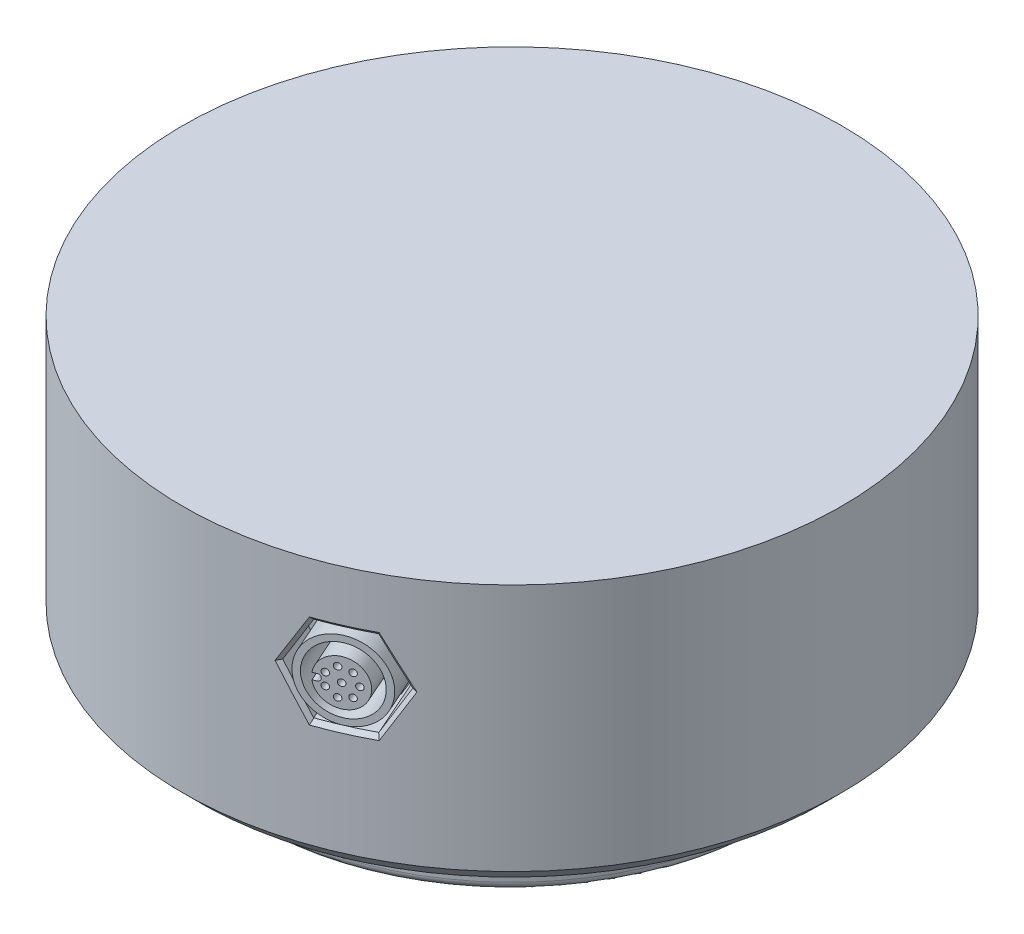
ISO-10303-21;
HEADER;
FILE_DESCRIPTION(('STEP AP214'),'2;1');
FILE_NAME('part.step','',(''),(''),'','','');
FILE_SCHEMA(('AUTOMOTIVE_DESIGN { 1 0 10303 214 1 1 1 1 }'));
ENDSEC;
DATA;
#1=APPLICATION_CONTEXT('core data for automotive mechanical design processes');
#2=APPLICATION_PROTOCOL_DEFINITION('international standard','automotive_design',2000,#1);
#3=PRODUCT_CONTEXT('',#1,'mechanical');
#4=PRODUCT('Part','Part','',(#3));
#5=PRODUCT_RELATED_PRODUCT_CATEGORY('part','',(#4));
#6=PRODUCT_DEFINITION_FORMATION('','',#4);
#7=PRODUCT_DEFINITION_CONTEXT('part definition',#1,'design');
#8=PRODUCT_DEFINITION('design','',#6,#7);
#9=PRODUCT_DEFINITION_SHAPE('','',#8);
#10=(LENGTH_UNIT() NAMED_UNIT(*) SI_UNIT(.MILLI.,.METRE.));
#11=(NAMED_UNIT(*) PLANE_ANGLE_UNIT() SI_UNIT($,.RADIAN.));
#12=(NAMED_UNIT(*) SI_UNIT($,.STERADIAN.) SOLID_ANGLE_UNIT());
#13=UNCERTAINTY_MEASURE_WITH_UNIT(LENGTH_MEASURE(1.E-05),#10,'distance_accuracy_value','');
#14=(GEOMETRIC_REPRESENTATION_CONTEXT(3) GLOBAL_UNCERTAINTY_ASSIGNED_CONTEXT((#13)) GLOBAL_UNIT_ASSIGNED_CONTEXT((#10,
#11,#12)) REPRESENTATION_CONTEXT('',''));
#15=CARTESIAN_POINT('',(0.,0.,0.));
#16=DIRECTION('',(0.,0.,1.));
#17=DIRECTION('',(1.,0.,0.));
#18=AXIS2_PLACEMENT_3D('',#15,#16,#17);
#19=CARTESIAN_POINT('',(-810.378339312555,9.99999999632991,618.22648744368));
#20=DIRECTION('',(-1.03271523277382E-11,-1.,-1.59913263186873E-11));
#21=DIRECTION('',(-0.697959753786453,1.86599936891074E-11,-0.71613698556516));
#22=AXIS2_PLACEMENT_3D('',#19,#20,#21);
#23=PLANE('',#22);
#24=CARTESIAN_POINT('',(-158.779226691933,9.99999999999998,-32.0823793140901));
#25=DIRECTION('',(0.,-1.,0.));
#26=DIRECTION('',(0.403993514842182,0.,0.914761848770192));
#27=AXIS2_PLACEMENT_3D('',#24,#25,#26);
#28=CIRCLE('',#27,2.99999999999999);
#29=CARTESIAN_POINT('',(-157.567246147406,9.99999999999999,-29.3380937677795));
#30=VERTEX_POINT('',#29);
#31=EDGE_CURVE('P0_E743',#30,#30,#28,.T.);
#32=ORIENTED_EDGE('',*,*,#31,.T.);
#33=EDGE_LOOP('',(#32));
#34=FACE_BOUND('',#33,.T.);
#35=ADVANCED_FACE('P0_F16',(#34),#23,.T.);
#36=CARTESIAN_POINT('',(-810.378339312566,8.99999999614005,618.226487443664));
#37=DIRECTION('',(-1.03278323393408E-11,-1.,-1.59911077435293E-11));
#38=DIRECTION('',(-0.697959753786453,1.8660316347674E-11,-0.71613698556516));
#39=AXIS2_PLACEMENT_3D('',#36,#37,#38);
#40=PLANE('',#39);
#41=CARTESIAN_POINT('',(-177.908258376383,9.,-31.638904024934));
#42=DIRECTION('',(0.,-1.,0.));
#43=DIRECTION('',(0.403993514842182,0.,0.914761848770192));
#44=AXIS2_PLACEMENT_3D('',#41,#42,#43);
#45=CIRCLE('',#44,2.49999999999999);
#46=CARTESIAN_POINT('',(-176.898274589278,9.,-29.3519994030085));
#47=VERTEX_POINT('',#46);
#48=EDGE_CURVE('P0_E740',#47,#47,#45,.T.);
#49=ORIENTED_EDGE('',*,*,#48,.T.);
#50=EDGE_LOOP('',(#49));
#51=FACE_BOUND('',#50,.T.);
#52=ADVANCED_FACE('P0_F730',(#51),#40,.T.);
#53=CARTESIAN_POINT('',(-810.378339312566,8.99999999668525,618.226487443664));
#54=DIRECTION('',(-1.03285938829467E-11,-1.,-1.59911250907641E-11));
#55=DIRECTION('',(-0.697959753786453,1.86608610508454E-11,-0.71613698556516));
#56=AXIS2_PLACEMENT_3D('',#53,#54,#55);
#57=PLANE('',#56);
#58=CARTESIAN_POINT('',(-144.939374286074,9.00000000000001,-18.8696956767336));
#59=DIRECTION('',(0.,-1.,0.));
#60=DIRECTION('',(0.403993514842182,0.,0.914761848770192));
#61=AXIS2_PLACEMENT_3D('',#58,#59,#60);
#62=CIRCLE('',#61,2.49999999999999);
#63=CARTESIAN_POINT('',(-143.929390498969,9.00000000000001,-16.5827910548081));
#64=VERTEX_POINT('',#63);
#65=EDGE_CURVE('P0_E742',#64,#64,#62,.T.);
#66=ORIENTED_EDGE('',*,*,#65,.T.);
#67=EDGE_LOOP('',(#66));
#68=FACE_BOUND('',#67,.T.);
#69=ADVANCED_FACE('P0_F727',(#68),#57,.T.);
#70=CARTESIAN_POINT('',(-810.378339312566,8.99999999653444,618.226487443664));
#71=DIRECTION('',(-1.03261774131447E-11,-1.,-1.59909672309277E-11));
#72=DIRECTION('',(-0.697959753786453,1.86590569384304E-11,-0.71613698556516));
#73=AXIS2_PLACEMENT_3D('',#70,#71,#72);
#74=PLANE('',#73);
#75=CARTESIAN_POINT('',(-190.677466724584,9.00000000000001,1.32998006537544));
#76=DIRECTION('',(0.,-1.,0.));
#77=DIRECTION('',(0.403993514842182,0.,0.914761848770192));
#78=AXIS2_PLACEMENT_3D('',#75,#76,#77);
#79=CIRCLE('',#78,2.49999999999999);
#80=CARTESIAN_POINT('',(-189.667482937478,9.00000000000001,3.6168846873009));
#81=VERTEX_POINT('',#80);
#82=EDGE_CURVE('P0_E746',#81,#81,#79,.T.);
#83=ORIENTED_EDGE('',*,*,#82,.T.);
#84=EDGE_LOOP('',(#83));
#85=FACE_BOUND('',#84,.T.);
#86=ADVANCED_FACE('P0_F723',(#85),#74,.T.);
#87=CARTESIAN_POINT('',(-810.378339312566,8.99999999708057,618.226487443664));
#88=DIRECTION('',(-1.03283510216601E-11,-1.,-1.59908683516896E-11));
#89=DIRECTION('',(-0.697959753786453,1.86605036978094E-11,-0.71613698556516));
#90=AXIS2_PLACEMENT_3D('',#87,#88,#89);
#91=PLANE('',#90);
#92=CARTESIAN_POINT('',(-157.708582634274,9.00000000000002,14.0991884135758));
#93=DIRECTION('',(0.,-1.,0.));
#94=DIRECTION('',(0.403993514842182,0.,0.914761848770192));
#95=AXIS2_PLACEMENT_3D('',#92,#93,#94);
#96=CIRCLE('',#95,2.49999999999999);
#97=CARTESIAN_POINT('',(-156.698598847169,9.00000000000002,16.3860930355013));
#98=VERTEX_POINT('',#97);
#99=EDGE_CURVE('P0_E755',#98,#98,#96,.T.);
#100=ORIENTED_EDGE('',*,*,#99,.T.);
#101=EDGE_LOOP('',(#100));
#102=FACE_BOUND('',#101,.T.);
#103=ADVANCED_FACE('P0_F719',(#102),#91,.T.);
#104=CARTESIAN_POINT('',(-162.249780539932,26.,-48.9401704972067));
#105=DIRECTION('',(-0.124847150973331,0.,0.992175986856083));
#106=DIRECTION('',(-0.98579535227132,-0.11322783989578,-0.124044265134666));
#107=AXIS2_PLACEMENT_3D('',#104,#105,#106);
#108=PLANE('',#107);
#109=CARTESIAN_POINT('',(-162.249780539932,26.,-48.9401704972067));
#110=DIRECTION('',(-0.124847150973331,0.,0.992175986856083));
#111=DIRECTION('',(-0.98579535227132,-0.11322783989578,-0.124044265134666));
#112=AXIS2_PLACEMENT_3D('',#109,#110,#111);
#113=CIRCLE('',#112,4.3);
#114=CARTESIAN_POINT('',(-166.488700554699,25.5131202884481,-49.4735608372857));
#115=VERTEX_POINT('',#114);
#116=EDGE_CURVE('P0_E1595',#115,#115,#113,.F.);
#117=ORIENTED_EDGE('',*,*,#116,.T.);
#118=EDGE_LOOP('',(#117));
#119=FACE_BOUND('',#118,.T.);
#120=ADVANCED_FACE('P0_F722',(#119),#108,.F.);
#121=CARTESIAN_POINT('',(-162.274749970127,26.,-48.7417352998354));
#122=DIRECTION('',(-0.124847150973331,0.,0.992175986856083));
#123=DIRECTION('',(-0.98579535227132,-0.11322783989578,-0.124044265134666));
#124=AXIS2_PLACEMENT_3D('',#121,#122,#123);
#125=TOROIDAL_SURFACE('',#124,4.3,0.2);
#126=ORIENTED_EDGE('',*,*,#116,.F.);
#127=EDGE_LOOP('',(#126));
#128=FACE_BOUND('',#127,.T.);
#129=CARTESIAN_POINT('',(-162.274749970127,26.,-48.7417352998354));
#130=DIRECTION('',(-0.124847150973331,0.,0.992175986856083));
#131=DIRECTION('',(-0.98579535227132,-0.11322783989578,-0.124044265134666));
#132=AXIS2_PLACEMENT_3D('',#129,#130,#131);
#133=CIRCLE('',#132,4.5);
#134=CARTESIAN_POINT('',(-166.710829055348,25.490474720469,-49.2999344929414));
#135=VERTEX_POINT('',#134);
#136=EDGE_CURVE('P0_E1589',#135,#135,#133,.T.);
#137=ORIENTED_EDGE('',*,*,#136,.F.);
#138=EDGE_LOOP('',(#137));
#139=FACE_BOUND('',#138,.T.);
#140=ADVANCED_FACE('P0_F1132',(#128,#139),#125,.T.);
#141=CARTESIAN_POINT('',(-164.128730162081,26.,-34.0079218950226));
#142=DIRECTION('',(-0.124847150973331,0.,0.992175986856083));
#143=DIRECTION('',(-0.98579535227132,-0.11322783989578,-0.124044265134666));
#144=AXIS2_PLACEMENT_3D('',#141,#142,#143);
#145=CYLINDRICAL_SURFACE('',#144,4.5);
#146=ORIENTED_EDGE('',*,*,#136,.T.);
#147=EDGE_LOOP('',(#146));
#148=FACE_BOUND('',#147,.T.);
#149=CARTESIAN_POINT('',(-162.443293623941,26.,-47.4022977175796));
#150=DIRECTION('',(-0.124847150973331,0.,0.992175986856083));
#151=DIRECTION('',(-0.98579535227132,-0.11322783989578,-0.124044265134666));
#152=AXIS2_PLACEMENT_3D('',#149,#150,#151);
#153=CIRCLE('',#152,4.5);
#154=CARTESIAN_POINT('',(-166.879372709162,25.490474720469,-47.9604969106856));
#155=VERTEX_POINT('',#154);
#156=EDGE_CURVE('P0_E1592',#155,#155,#153,.T.);
#157=ORIENTED_EDGE('',*,*,#156,.F.);
#158=EDGE_LOOP('',(#157));
#159=FACE_BOUND('',#158,.T.);
#160=ADVANCED_FACE('P0_F712',(#148,#159),#145,.T.);
#161=CARTESIAN_POINT('',(-162.948832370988,30.4710607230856,-47.4659104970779));
#162=DIRECTION('',(-0.124847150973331,0.,0.992175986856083));
#163=DIRECTION('',(-0.98579535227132,-0.11322783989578,-0.124044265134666));
#164=AXIS2_PLACEMENT_3D('',#161,#162,#163);
#165=PLANE('',#164);
#166=CARTESIAN_POINT('',(-162.443293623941,26.,-47.4022977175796));
#167=DIRECTION('',(-0.124847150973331,0.,0.992175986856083));
#168=DIRECTION('',(-0.98579535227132,-0.11322783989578,-0.124044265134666));
#169=AXIS2_PLACEMENT_3D('',#166,#167,#168);
#170=CIRCLE('',#169,5.5);
#171=CARTESIAN_POINT('',(-167.865168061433,25.3772468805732,-48.0845411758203));
#172=VERTEX_POINT('',#171);
#173=EDGE_CURVE('P0_E19',#172,#172,#170,.T.);
#174=ORIENTED_EDGE('',*,*,#173,.F.);
#175=EDGE_LOOP('',(#174));
#176=FACE_BOUND('',#175,.T.);
#177=ORIENTED_EDGE('',*,*,#156,.T.);
#178=EDGE_LOOP('',(#177));
#179=FACE_BOUND('',#178,.T.);
#180=ADVANCED_FACE('P0_F706',(#176,#179),#165,.F.);
#181=CARTESIAN_POINT('',(-162.443293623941,26.,-47.4022977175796));
#182=DIRECTION('',(-0.124847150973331,0.,0.992175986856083));
#183=DIRECTION('',(-0.98579535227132,-0.11322783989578,-0.124044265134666));
#184=AXIS2_PLACEMENT_3D('',#181,#182,#183);
#185=CONICAL_SURFACE('',#184,5.5,0.896055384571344);
#186=CARTESIAN_POINT('',(-162.593110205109,26.,-46.2116865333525));
#187=DIRECTION('',(-0.124847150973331,0.,0.992175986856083));
#188=DIRECTION('',(0.992136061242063,0.0089710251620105,0.124842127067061));
#189=AXIS2_PLACEMENT_3D('',#186,#187,#188);
#190=CIRCLE('',#189,7.);
#191=CARTESIAN_POINT('',(-155.648157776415,26.0627971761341,-45.3377916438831));
#192=VERTEX_POINT('',#191);
#193=EDGE_CURVE('P0_E1599',#192,#192,#190,.T.);
#194=ORIENTED_EDGE('',*,*,#193,.F.);
#195=EDGE_LOOP('',(#194));
#196=FACE_BOUND('',#195,.T.);
#197=ORIENTED_EDGE('',*,*,#173,.T.);
#198=EDGE_LOOP('',(#197));
#199=FACE_BOUND('',#198,.T.);
#200=ADVANCED_FACE('P0_F701',(#196,#199),#185,.T.);
#201=CARTESIAN_POINT('',(-154.880628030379,39.,20.5025213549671));
#202=DIRECTION('',(0.403993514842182,0.,0.914761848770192));
#203=DIRECTION('',(-0.914761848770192,0.,0.403993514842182));
#204=AXIS2_PLACEMENT_3D('',#201,#202,#203);
#205=PLANE('',#204);
#206=DIRECTION('',(0.457380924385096,0.866025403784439,-0.201996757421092));
#207=VECTOR('',#206,1.);
#208=CARTESIAN_POINT('',(-157.653352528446,32.25,21.7270616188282));
#209=LINE('',#208,#207);
#210=CARTESIAN_POINT('',(-160.426077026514,27.,22.9516018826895));
#211=VERTEX_POINT('',#210);
#212=CARTESIAN_POINT('',(-157.653352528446,32.25,21.7270616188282));
#213=VERTEX_POINT('',#212);
#214=EDGE_CURVE('P0_E113',#211,#213,#209,.T.);
#215=ORIENTED_EDGE('',*,*,#214,.F.);
#216=DIRECTION('',(-0.457380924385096,0.866025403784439,0.201996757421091));
#217=VECTOR('',#216,1.);
#218=CARTESIAN_POINT('',(-160.426077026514,27.,22.9516018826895));
#219=LINE('',#218,#217);
#220=CARTESIAN_POINT('',(-157.653352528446,21.75,21.7270616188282));
#221=VERTEX_POINT('',#220);
#222=EDGE_CURVE('P0_E116',#221,#211,#219,.T.);
#223=ORIENTED_EDGE('',*,*,#222,.F.);
#224=DIRECTION('',(-0.914761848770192,0.,0.403993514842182));
#225=VECTOR('',#224,1.);
#226=CARTESIAN_POINT('',(-157.653352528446,21.75,21.7270616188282));
#227=LINE('',#226,#225);
#228=CARTESIAN_POINT('',(-152.107903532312,21.75,19.2779810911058));
#229=VERTEX_POINT('',#228);
#230=EDGE_CURVE('P0_E133',#229,#221,#227,.T.);
#231=ORIENTED_EDGE('',*,*,#230,.F.);
#232=DIRECTION('',(-0.457380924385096,-0.866025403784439,0.201996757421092));
#233=VECTOR('',#232,1.);
#234=CARTESIAN_POINT('',(-152.107903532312,21.75,19.2779810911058));
#235=LINE('',#234,#233);
#236=CARTESIAN_POINT('',(-149.335179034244,27.,18.0534408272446));
#237=VERTEX_POINT('',#236);
#238=EDGE_CURVE('P0_E638',#237,#229,#235,.T.);
#239=ORIENTED_EDGE('',*,*,#238,.F.);
#240=DIRECTION('',(0.457380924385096,-0.866025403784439,-0.201996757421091));
#241=VECTOR('',#240,1.);
#242=CARTESIAN_POINT('',(-149.335179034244,27.,18.0534408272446));
#243=LINE('',#242,#241);
#244=CARTESIAN_POINT('',(-152.107903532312,32.25,19.2779810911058));
#245=VERTEX_POINT('',#244);
#246=EDGE_CURVE('P0_E641',#245,#237,#243,.T.);
#247=ORIENTED_EDGE('',*,*,#246,.F.);
#248=DIRECTION('',(0.914761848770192,0.,-0.403993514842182));
#249=VECTOR('',#248,1.);
#250=CARTESIAN_POINT('',(-152.107903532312,32.25,19.2779810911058));
#251=LINE('',#250,#249);
#252=EDGE_CURVE('P0_E119',#213,#245,#251,.T.);
#253=ORIENTED_EDGE('',*,*,#252,.F.);
#254=EDGE_LOOP('',(#215,#223,#231,#239,#247,#253));
#255=FACE_BOUND('',#254,.T.);
#256=ADVANCED_FACE('P0_F115',(#255),#205,.T.);
#257=CARTESIAN_POINT('',(-164.133010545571,32.25,7.05518266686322));
#258=DIRECTION('',(-0.792206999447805,0.5,0.349868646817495));
#259=DIRECTION('',(-0.457380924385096,-0.866025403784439,0.201996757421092));
#260=AXIS2_PLACEMENT_3D('',#257,#258,#259);
#261=PLANE('',#260);
#262=CARTESIAN_POINT('',(-154.467867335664,32.25,28.9399504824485));
#263=CARTESIAN_POINT('',(-154.465665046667,32.2523157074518,28.9416277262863));
#264=CARTESIAN_POINT('',(-154.463462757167,32.2546314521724,28.9433049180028));
#265=CARTESIAN_POINT('',(-154.459058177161,32.2592630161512,28.9466591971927));
#266=CARTESIAN_POINT('',(-154.456855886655,32.2615788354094,28.9483362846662));
#267=CARTESIAN_POINT('',(-154.454653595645,32.2638946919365,28.9500133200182));
#268=B_SPLINE_CURVE_WITH_KNOTS('',3,(#262,#263,#264,#265,#266,#267),.UNSPECIFIED.,.F.,.F.,(4,2,
4),(0.,0.0108273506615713,0.0216547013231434),.UNSPECIFIED.);
#269=CARTESIAN_POINT('',(-154.467867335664,32.25,28.9399504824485));
#270=VERTEX_POINT('',#269);
#271=CARTESIAN_POINT('',(-154.454653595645,32.2638946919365,28.9500133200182));
#272=VERTEX_POINT('',#271);
#273=EDGE_CURVE('P0_E644',#270,#272,#268,.T.);
#274=ORIENTED_EDGE('',*,*,#273,.T.);
#275=CARTESIAN_POINT('',(-157.664631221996,26.5087669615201,29.9063640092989));
#276=CARTESIAN_POINT('',(-156.475327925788,28.6035869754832,29.6055779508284));
#277=CARTESIAN_POINT('',(-155.299860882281,30.7147602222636,29.2500919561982));
#278=CARTESIAN_POINT('',(-154.143188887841,32.8333805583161,28.8414056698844));
#279=B_SPLINE_CURVE_WITH_KNOTS('',3,(#275,#276,#277,#278),.UNSPECIFIED.,.F.,.F.,(4,4),
(4.54423272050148,4.63614159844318),.UNSPECIFIED.);
#280=CARTESIAN_POINT('',(-154.462266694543,32.25,28.9526320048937));
#281=VERTEX_POINT('',#280);
#282=EDGE_CURVE('P0_E143',#272,#281,#279,.F.);
#283=ORIENTED_EDGE('',*,*,#282,.T.);
#284=CARTESIAN_POINT('',(-157.664631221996,26.5087669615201,29.9063640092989));
#285=CARTESIAN_POINT('',(-156.475327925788,28.6035869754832,29.6055779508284));
#286=CARTESIAN_POINT('',(-155.299860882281,30.7147602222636,29.2500919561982));
#287=CARTESIAN_POINT('',(-154.143188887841,32.8333805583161,28.8414056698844));
#288=B_SPLINE_CURVE_WITH_KNOTS('',3,(#284,#285,#286,#287),.UNSPECIFIED.,.F.,.F.,(4,4),
(4.54423272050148,4.63614159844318),.UNSPECIFIED.);
#289=CARTESIAN_POINT('',(-157.386164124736,27.,29.8348716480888));
#290=VERTEX_POINT('',#289);
#291=EDGE_CURVE('P0_E137',#281,#290,#288,.F.);
#292=ORIENTED_EDGE('',*,*,#291,.T.);
#293=DIRECTION('',(0.403993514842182,0.,0.914761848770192));
#294=VECTOR('',#293,1.);
#295=CARTESIAN_POINT('',(-166.905735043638,27.,8.27972293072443));
#296=LINE('',#295,#294);
#297=EDGE_CURVE('P0_E129',#211,#290,#296,.T.);
#298=ORIENTED_EDGE('',*,*,#297,.F.);
#299=ORIENTED_EDGE('',*,*,#214,.T.);
#300=DIRECTION('',(0.403993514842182,0.,0.914761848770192));
#301=VECTOR('',#300,1.);
#302=CARTESIAN_POINT('',(-164.133010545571,32.25,7.05518266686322));
#303=LINE('',#302,#301);
#304=EDGE_CURVE('P0_E139',#213,#270,#303,.T.);
#305=ORIENTED_EDGE('',*,*,#304,.T.);
#306=EDGE_LOOP('',(#274,#283,#292,#298,#299,#305));
#307=FACE_BOUND('',#306,.T.);
#308=ADVANCED_FACE('P0_F135',(#307),#261,.F.);
#309=CARTESIAN_POINT('',(-167.808420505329,32.75,-8.76985780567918));
#310=DIRECTION('',(0.,1.,0.));
#311=DIRECTION('',(-0.403993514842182,0.,-0.914761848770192));
#312=AXIS2_PLACEMENT_3D('',#309,#310,#311);
#313=CONICAL_SURFACE('',#312,40.5,0.785398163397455);
#314=ORIENTED_EDGE('',*,*,#273,.F.);
#315=CARTESIAN_POINT('',(-167.808420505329,32.25,-8.76985780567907));
#316=DIRECTION('',(0.,1.,0.));
#317=DIRECTION('',(-0.403993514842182,0.,-0.914761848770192));
#318=AXIS2_PLACEMENT_3D('',#315,#316,#317);
#319=CIRCLE('',#318,40.);
#320=CARTESIAN_POINT('',(-148.922418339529,32.25,26.490869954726));
#321=VERTEX_POINT('',#320);
#322=EDGE_CURVE('P0_E141',#321,#270,#319,.F.);
#323=ORIENTED_EDGE('',*,*,#322,.F.);
#324=CARTESIAN_POINT('',(-148.92388122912,32.2638946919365,26.5074145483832));
#325=CARTESIAN_POINT('',(-148.923637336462,32.2615788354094,26.5046571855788));
#326=CARTESIAN_POINT('',(-148.923393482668,32.2592630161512,26.5018997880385));
#327=CARTESIAN_POINT('',(-148.922905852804,32.2546314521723,26.4963849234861));
#328=CARTESIAN_POINT('',(-148.922662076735,32.2523157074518,26.493627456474));
#329=CARTESIAN_POINT('',(-148.922418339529,32.25,26.490869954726));
#330=B_SPLINE_CURVE_WITH_KNOTS('',3,(#324,#325,#326,#327,#328,#329),.UNSPECIFIED.,.F.,.F.,(4,2,
4),(0.,0.0108273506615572,0.0216547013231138),.UNSPECIFIED.);
#331=CARTESIAN_POINT('',(-148.92388122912,32.2638946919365,26.5074145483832));
#332=VERTEX_POINT('',#331);
#333=EDGE_CURVE('P0_E157',#332,#321,#330,.T.);
#334=ORIENTED_EDGE('',*,*,#333,.F.);
#335=CARTESIAN_POINT('',(-148.523205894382,32.7500001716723,26.8437703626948));
#336=CARTESIAN_POINT('',(-148.541235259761,32.7280200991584,26.828537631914));
#337=CARTESIAN_POINT('',(-148.559273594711,32.706043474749,26.8133105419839));
#338=CARTESIAN_POINT('',(-148.59496960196,32.6625825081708,26.7832038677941));
#339=CARTESIAN_POINT('',(-148.61262688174,32.6410980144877,26.7683240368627));
#340=CARTESIAN_POINT('',(-148.647559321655,32.5986212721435,26.7389114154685));
#341=CARTESIAN_POINT('',(-148.664834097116,32.5776288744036,26.7243783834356));
#342=CARTESIAN_POINT('',(-148.699000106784,32.5361362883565,26.6956589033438));
#343=CARTESIAN_POINT('',(-148.715890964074,32.5156359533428,26.6814722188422));
#344=CARTESIAN_POINT('',(-148.749287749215,32.4751274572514,26.6534449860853));
#345=CARTESIAN_POINT('',(-148.765793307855,32.4551191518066,26.6396042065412));
#346=CARTESIAN_POINT('',(-148.798418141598,32.4155946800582,26.6122683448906));
#347=CARTESIAN_POINT('',(-148.814537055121,32.3960783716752,26.5987730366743));
#348=CARTESIAN_POINT('',(-148.846387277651,32.3575378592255,26.5721276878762));
#349=CARTESIAN_POINT('',(-148.862118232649,32.3385135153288,26.5589774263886));
#350=CARTESIAN_POINT('',(-148.893191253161,32.3009568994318,26.5330217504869));
#351=CARTESIAN_POINT('',(-148.908532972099,32.2824244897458,26.5202161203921));
#352=CARTESIAN_POINT('',(-148.92388122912,32.2638946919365,26.5074145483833));
#353=B_SPLINE_CURVE_WITH_KNOTS('',3,(#335,#336,#337,#338,#339,#340,#341,#342,#343,#344,#345,
#346,#347,#348,#349,#350,#351,#352),.UNSPECIFIED.,.F.,.F.,(4,2,2,2,2,2,2,2,4),(0.,
0.0967572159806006,0.191377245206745,0.283858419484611,0.374199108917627,0.462397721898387,
0.548452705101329,0.632362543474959,0.71412576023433),.UNSPECIFIED.);
#354=CARTESIAN_POINT('',(-148.523205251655,32.7499999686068,26.8437698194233));
#355=VERTEX_POINT('',#354);
#356=EDGE_CURVE('P0_E160',#332,#355,#353,.F.);
#357=ORIENTED_EDGE('',*,*,#356,.T.);
#358=CARTESIAN_POINT('',(-167.808420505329,32.75,-8.76985780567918));
#359=DIRECTION('',(0.,1.,0.));
#360=DIRECTION('',(-0.403993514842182,0.,-0.914761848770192));
#361=AXIS2_PLACEMENT_3D('',#358,#359,#360);
#362=CIRCLE('',#361,40.5);
#363=CARTESIAN_POINT('',(-154.475934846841,32.7499999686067,29.4727209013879));
#364=VERTEX_POINT('',#363);
#365=EDGE_CURVE('P0_E167',#364,#355,#362,.T.);
#366=ORIENTED_EDGE('',*,*,#365,.F.);
#367=CARTESIAN_POINT('',(-154.454653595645,32.2638946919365,28.9500133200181));
#368=CARTESIAN_POINT('',(-154.455530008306,32.2824244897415,28.9699803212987));
#369=CARTESIAN_POINT('',(-154.45639901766,32.3009568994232,28.9899452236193));
#370=CARTESIAN_POINT('',(-154.458144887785,32.3385135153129,29.0303949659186));
#371=CARTESIAN_POINT('',(-154.459021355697,32.3575378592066,29.0508796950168));
#372=CARTESIAN_POINT('',(-154.460780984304,32.3960783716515,29.0923684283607));
#373=CARTESIAN_POINT('',(-154.461663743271,32.4155946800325,29.1133723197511));
#374=CARTESIAN_POINT('',(-154.463434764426,32.4551191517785,29.1558986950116));
#375=CARTESIAN_POINT('',(-154.464322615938,32.4751274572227,29.1774210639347));
#376=CARTESIAN_POINT('',(-154.466102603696,32.5156359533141,29.2209836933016));
#377=CARTESIAN_POINT('',(-154.466994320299,32.5361362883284,29.2430238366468));
#378=CARTESIAN_POINT('',(-154.468780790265,32.577628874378,29.2876212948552));
#379=CARTESIAN_POINT('',(-154.469675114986,32.5986212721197,29.3101784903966));
#380=CARTESIAN_POINT('',(-154.471465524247,32.6410980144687,29.3558093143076));
#381=CARTESIAN_POINT('',(-154.472361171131,32.6625825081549,29.3788828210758));
#382=CARTESIAN_POINT('',(-154.474152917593,32.7060434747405,29.4255455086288));
#383=CARTESIAN_POINT('',(-154.475048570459,32.7280200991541,29.4491345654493));
#384=CARTESIAN_POINT('',(-154.475934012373,32.7500001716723,29.4727207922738));
#385=B_SPLINE_CURVE_WITH_KNOTS('',3,(#367,#368,#369,#370,#371,#372,#373,#374,#375,#376,#377,
#378,#379,#380,#381,#382,#383,#384),.UNSPECIFIED.,.F.,.F.,(4,2,2,2,2,2,2,2,4),(0.,
0.0817632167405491,0.165673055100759,0.25172803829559,0.339926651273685,0.430267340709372,
0.522748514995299,0.61736854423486,0.714125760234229),.UNSPECIFIED.);
#386=EDGE_CURVE('P0_E666',#364,#272,#385,.F.);
#387=ORIENTED_EDGE('',*,*,#386,.T.);
#388=EDGE_LOOP('',(#314,#323,#334,#357,#366,#387));
#389=FACE_BOUND('',#388,.T.);
#390=ADVANCED_FACE('P0_F173',(#389),#313,.T.);
#391=CARTESIAN_POINT('',(-158.587561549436,32.25,4.6061021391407));
#392=DIRECTION('',(0.,1.,0.));
#393=DIRECTION('',(-0.403993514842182,0.,-0.914761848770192));
#394=AXIS2_PLACEMENT_3D('',#391,#392,#393);
#395=PLANE('',#394);
#396=DIRECTION('',(0.403993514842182,0.,0.914761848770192));
#397=VECTOR('',#396,1.);
#398=CARTESIAN_POINT('',(-158.587561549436,32.25,4.6061021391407));
#399=LINE('',#398,#397);
#400=EDGE_CURVE('P0_E667',#245,#321,#399,.T.);
#401=ORIENTED_EDGE('',*,*,#400,.T.);
#402=ORIENTED_EDGE('',*,*,#322,.T.);
#403=ORIENTED_EDGE('',*,*,#304,.F.);
#404=ORIENTED_EDGE('',*,*,#252,.T.);
#405=EDGE_LOOP('',(#401,#402,#403,#404));
#406=FACE_BOUND('',#405,.T.);
#407=ADVANCED_FACE('P0_F176',(#406),#395,.F.);
#408=CARTESIAN_POINT('',(-155.814837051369,27.,3.3815618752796));
#409=DIRECTION('',(0.792206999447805,0.5,-0.349868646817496));
#410=DIRECTION('',(-0.457380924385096,0.866025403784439,0.201996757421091));
#411=AXIS2_PLACEMENT_3D('',#408,#409,#410);
#412=PLANE('',#411);
#413=DIRECTION('',(0.403993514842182,0.,0.914761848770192));
#414=VECTOR('',#413,1.);
#415=CARTESIAN_POINT('',(-155.814837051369,27.,3.3815618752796));
#416=LINE('',#415,#414);
#417=CARTESIAN_POINT('',(-146.295266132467,27.,24.936710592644));
#418=VERTEX_POINT('',#417);
#419=EDGE_CURVE('P0_E669',#237,#418,#416,.T.);
#420=ORIENTED_EDGE('',*,*,#419,.T.);
#421=CARTESIAN_POINT('',(-149.213950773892,32.8333805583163,26.664467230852));
#422=CARTESIAN_POINT('',(-148.132774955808,30.7147602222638,26.0848350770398));
#423=CARTESIAN_POINT('',(-147.078260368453,28.6035869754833,25.4554766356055));
#424=CARTESIAN_POINT('',(-146.054855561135,26.5087669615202,24.779046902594));
#425=B_SPLINE_CURVE_WITH_KNOTS('',3,(#421,#422,#423,#424),.UNSPECIFIED.,.F.,.F.,(4,4),
(1.64704370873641,1.7389525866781),.UNSPECIFIED.);
#426=CARTESIAN_POINT('',(-148.916817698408,32.25,26.5035514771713));
#427=VERTEX_POINT('',#426);
#428=EDGE_CURVE('P0_E202',#418,#427,#425,.F.);
#429=ORIENTED_EDGE('',*,*,#428,.T.);
#430=CARTESIAN_POINT('',(-149.213950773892,32.8333805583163,26.664467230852));
#431=CARTESIAN_POINT('',(-148.132774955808,30.7147602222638,26.0848350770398));
#432=CARTESIAN_POINT('',(-147.078260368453,28.6035869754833,25.4554766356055));
#433=CARTESIAN_POINT('',(-146.054855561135,26.5087669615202,24.779046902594));
#434=B_SPLINE_CURVE_WITH_KNOTS('',3,(#430,#431,#432,#433),.UNSPECIFIED.,.F.,.F.,(4,4),
(1.64704370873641,1.7389525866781),.UNSPECIFIED.);
#435=EDGE_CURVE('P0_E213',#427,#332,#434,.F.);
#436=ORIENTED_EDGE('',*,*,#435,.T.);
#437=ORIENTED_EDGE('',*,*,#333,.T.);
#438=ORIENTED_EDGE('',*,*,#400,.F.);
#439=ORIENTED_EDGE('',*,*,#246,.T.);
#440=EDGE_LOOP('',(#420,#429,#436,#437,#438,#439));
#441=FACE_BOUND('',#440,.T.);
#442=ADVANCED_FACE('P0_F169',(#441),#412,.F.);
#443=CARTESIAN_POINT('',(-158.587561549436,21.75,4.6061021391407));
#444=DIRECTION('',(0.792206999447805,-0.5,-0.349868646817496));
#445=DIRECTION('',(0.457380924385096,0.866025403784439,-0.201996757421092));
#446=AXIS2_PLACEMENT_3D('',#443,#444,#445);
#447=PLANE('',#446);
#448=DIRECTION('',(0.403993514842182,0.,0.914761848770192));
#449=VECTOR('',#448,1.);
#450=CARTESIAN_POINT('',(-158.587561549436,21.75,4.6061021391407));
#451=LINE('',#450,#449);
#452=CARTESIAN_POINT('',(-148.922418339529,21.75,26.490869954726));
#453=VERTEX_POINT('',#452);
#454=EDGE_CURVE('P0_E677',#229,#453,#451,.T.);
#455=ORIENTED_EDGE('',*,*,#454,.T.);
#456=CARTESIAN_POINT('',(-148.922418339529,21.75,26.490869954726));
#457=CARTESIAN_POINT('',(-148.922662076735,21.7476842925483,26.4936274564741));
#458=CARTESIAN_POINT('',(-148.922905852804,21.7453685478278,26.4963849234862));
#459=CARTESIAN_POINT('',(-148.923393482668,21.7407369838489,26.5018997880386));
#460=CARTESIAN_POINT('',(-148.923637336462,21.7384211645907,26.5046571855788));
#461=CARTESIAN_POINT('',(-148.92388122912,21.7361053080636,26.5074145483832));
#462=B_SPLINE_CURVE_WITH_KNOTS('',3,(#456,#457,#458,#459,#460,#461),.UNSPECIFIED.,.F.,.F.,(4,2,
4),(0.,0.0108273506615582,0.0216547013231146),.UNSPECIFIED.);
#463=CARTESIAN_POINT('',(-148.92388122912,21.7361053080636,26.5074145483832));
#464=VERTEX_POINT('',#463);
#465=EDGE_CURVE('P0_E575',#453,#464,#462,.T.);
#466=ORIENTED_EDGE('',*,*,#465,.T.);
#467=CARTESIAN_POINT('',(-146.054855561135,27.4912330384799,24.779046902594));
#468=CARTESIAN_POINT('',(-147.078260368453,25.3964130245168,25.4554766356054));
#469=CARTESIAN_POINT('',(-148.132774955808,23.2852397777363,26.0848350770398));
#470=CARTESIAN_POINT('',(-149.213950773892,21.1666194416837,26.6644672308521));
#471=B_SPLINE_CURVE_WITH_KNOTS('',3,(#467,#468,#469,#470),.UNSPECIFIED.,.F.,.F.,(4,4),
(1.40264006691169,1.49454894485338),.UNSPECIFIED.);
#472=CARTESIAN_POINT('',(-148.916817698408,21.75,26.5035514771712));
#473=VERTEX_POINT('',#472);
#474=EDGE_CURVE('P0_E226',#464,#473,#471,.F.);
#475=ORIENTED_EDGE('',*,*,#474,.T.);
#476=CARTESIAN_POINT('',(-146.054855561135,27.4912330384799,24.779046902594));
#477=CARTESIAN_POINT('',(-147.078260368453,25.3964130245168,25.4554766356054));
#478=CARTESIAN_POINT('',(-148.132774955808,23.2852397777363,26.0848350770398));
#479=CARTESIAN_POINT('',(-149.213950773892,21.1666194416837,26.6644672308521));
#480=B_SPLINE_CURVE_WITH_KNOTS('',3,(#476,#477,#478,#479),.UNSPECIFIED.,.F.,.F.,(4,4),
(1.40264006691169,1.49454894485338),.UNSPECIFIED.);
#481=EDGE_CURVE('P0_E526',#473,#418,#480,.F.);
#482=ORIENTED_EDGE('',*,*,#481,.T.);
#483=ORIENTED_EDGE('',*,*,#419,.F.);
#484=ORIENTED_EDGE('',*,*,#238,.T.);
#485=EDGE_LOOP('',(#455,#466,#475,#482,#483,#484));
#486=FACE_BOUND('',#485,.T.);
#487=ADVANCED_FACE('P0_F232',(#486),#447,.F.);
#488=CARTESIAN_POINT('',(-164.133010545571,21.75,7.05518266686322));
#489=DIRECTION('',(0.,-1.,0.));
#490=DIRECTION('',(0.403993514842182,0.,0.914761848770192));
#491=AXIS2_PLACEMENT_3D('',#488,#489,#490);
#492=PLANE('',#491);
#493=DIRECTION('',(0.403993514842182,0.,0.914761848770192));
#494=VECTOR('',#493,1.);
#495=CARTESIAN_POINT('',(-164.133010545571,21.75,7.05518266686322));
#496=LINE('',#495,#494);
#497=CARTESIAN_POINT('',(-154.467867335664,21.75,28.9399504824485));
#498=VERTEX_POINT('',#497);
#499=EDGE_CURVE('P0_E132',#221,#498,#496,.T.);
#500=ORIENTED_EDGE('',*,*,#499,.T.);
#501=CARTESIAN_POINT('',(-167.808420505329,21.75,-8.76985780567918));
#502=DIRECTION('',(0.,-1.,0.));
#503=DIRECTION('',(0.403993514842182,0.,0.914761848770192));
#504=AXIS2_PLACEMENT_3D('',#501,#502,#503);
#505=CIRCLE('',#504,40.);
#506=EDGE_CURVE('P0_E578',#498,#453,#505,.F.);
#507=ORIENTED_EDGE('',*,*,#506,.T.);
#508=ORIENTED_EDGE('',*,*,#454,.F.);
#509=ORIENTED_EDGE('',*,*,#230,.T.);
#510=EDGE_LOOP('',(#500,#507,#508,#509));
#511=FACE_BOUND('',#510,.T.);
#512=ADVANCED_FACE('P0_F241',(#511),#492,.F.);
#513=CARTESIAN_POINT('',(-166.905735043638,27.,8.27972293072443));
#514=DIRECTION('',(-0.792206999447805,-0.5,0.349868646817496));
#515=DIRECTION('',(0.457380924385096,-0.866025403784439,-0.201996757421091));
#516=AXIS2_PLACEMENT_3D('',#513,#514,#515);
#517=PLANE('',#516);
#518=ORIENTED_EDGE('',*,*,#297,.T.);
#519=CARTESIAN_POINT('',(-154.143188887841,21.1666194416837,28.8414056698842));
#520=CARTESIAN_POINT('',(-155.299860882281,23.2852397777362,29.2500919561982));
#521=CARTESIAN_POINT('',(-156.475327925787,25.3964130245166,29.6055779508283));
#522=CARTESIAN_POINT('',(-157.664631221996,27.4912330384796,29.9063640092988));
#523=B_SPLINE_CURVE_WITH_KNOTS('',3,(#519,#520,#521,#522),.UNSPECIFIED.,.F.,.F.,(4,4),
(4.7886363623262,4.8805452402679),.UNSPECIFIED.);
#524=CARTESIAN_POINT('',(-154.462266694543,21.75,28.9526320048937));
#525=VERTEX_POINT('',#524);
#526=EDGE_CURVE('P0_E255',#290,#525,#523,.F.);
#527=ORIENTED_EDGE('',*,*,#526,.T.);
#528=CARTESIAN_POINT('',(-154.143188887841,21.1666194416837,28.8414056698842));
#529=CARTESIAN_POINT('',(-155.299860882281,23.2852397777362,29.2500919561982));
#530=CARTESIAN_POINT('',(-156.475327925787,25.3964130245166,29.6055779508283));
#531=CARTESIAN_POINT('',(-157.664631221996,27.4912330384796,29.9063640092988));
#532=B_SPLINE_CURVE_WITH_KNOTS('',3,(#528,#529,#530,#531),.UNSPECIFIED.,.F.,.F.,(4,4),
(4.7886363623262,4.8805452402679),.UNSPECIFIED.);
#533=CARTESIAN_POINT('',(-154.454653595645,21.7361053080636,28.9500133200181));
#534=VERTEX_POINT('',#533);
#535=EDGE_CURVE('P0_E288',#525,#534,#532,.F.);
#536=ORIENTED_EDGE('',*,*,#535,.T.);
#537=CARTESIAN_POINT('',(-154.454653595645,21.7361053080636,28.9500133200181));
#538=CARTESIAN_POINT('',(-154.456855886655,21.7384211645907,28.9483362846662));
#539=CARTESIAN_POINT('',(-154.459058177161,21.740736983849,28.9466591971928));
#540=CARTESIAN_POINT('',(-154.463462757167,21.7453685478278,28.9433049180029));
#541=CARTESIAN_POINT('',(-154.465665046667,21.7476842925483,28.9416277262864));
#542=CARTESIAN_POINT('',(-154.467867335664,21.75,28.9399504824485));
#543=B_SPLINE_CURVE_WITH_KNOTS('',3,(#537,#538,#539,#540,#541,#542),.UNSPECIFIED.,.F.,.F.,(4,2,
4),(0.,0.010827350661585,0.0216547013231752),.UNSPECIFIED.);
#544=EDGE_CURVE('P0_E581',#534,#498,#543,.T.);
#545=ORIENTED_EDGE('',*,*,#544,.T.);
#546=ORIENTED_EDGE('',*,*,#499,.F.);
#547=ORIENTED_EDGE('',*,*,#222,.T.);
#548=EDGE_LOOP('',(#518,#527,#536,#545,#546,#547));
#549=FACE_BOUND('',#548,.T.);
#550=ADVANCED_FACE('P0_F128',(#549),#517,.F.);
#551=CARTESIAN_POINT('',(-154.316286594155,20.9611444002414,29.416688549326));
#552=CARTESIAN_POINT('',(-155.486178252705,23.0797647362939,29.8300457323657));
#553=CARTESIAN_POINT('',(-156.675079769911,25.1909379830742,30.1895945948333));
#554=CARTESIAN_POINT('',(-157.877975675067,27.2857579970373,30.493818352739));
#555=CARTESIAN_POINT('',(-154.143188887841,21.1666194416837,28.8414056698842));
#556=CARTESIAN_POINT('',(-155.299860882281,23.2852397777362,29.2500919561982));
#557=CARTESIAN_POINT('',(-156.475327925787,25.3964130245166,29.6055779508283));
#558=CARTESIAN_POINT('',(-157.664631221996,27.4912330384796,29.9063640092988));
#559=B_SPLINE_SURFACE_WITH_KNOTS('',1,3,((#551,#552,#553,#554),(#555,#556,#557,#558)),
.UNSPECIFIED.,.F.,.F.,.F.,(2,2),(4,4),(0.,1.),(4.7886363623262,4.8805452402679),.UNSPECIFIED.);
#560=CARTESIAN_POINT('',(-157.714031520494,26.9999999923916,30.4519904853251));
#561=CARTESIAN_POINT('',(-157.700315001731,26.9999978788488,30.4262738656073));
#562=CARTESIAN_POINT('',(-157.686603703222,26.999996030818,30.4005544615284));
#563=CARTESIAN_POINT('',(-157.659195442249,26.9999928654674,30.3491173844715));
#564=CARTESIAN_POINT('',(-157.64549847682,26.9999915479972,30.3233997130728));
#565=CARTESIAN_POINT('',(-157.618118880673,26.9999894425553,30.2719661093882));
#566=CARTESIAN_POINT('',(-157.60443624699,26.9999886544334,30.2462501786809));
#567=CARTESIAN_POINT('',(-157.577085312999,26.9999876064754,30.1948200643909));
#568=CARTESIAN_POINT('',(-157.563417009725,26.9999873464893,30.1691058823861));
#569=CARTESIAN_POINT('',(-157.536094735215,26.9999873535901,30.1176792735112));
#570=CARTESIAN_POINT('',(-157.522440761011,26.9999876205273,30.0919668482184));
#571=CARTESIAN_POINT('',(-157.495147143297,26.9999886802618,30.0405437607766));
#572=CARTESIAN_POINT('',(-157.481507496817,26.9999894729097,30.0148331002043));
#573=CARTESIAN_POINT('',(-157.454242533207,26.9999915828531,29.9634135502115));
#574=CARTESIAN_POINT('',(-157.440617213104,26.9999928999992,29.9377046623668));
#575=CARTESIAN_POINT('',(-157.4133809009,26.9999960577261,29.8862886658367));
#576=CARTESIAN_POINT('',(-157.399769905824,26.9999978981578,29.8605815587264));
#577=CARTESIAN_POINT('',(-157.386164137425,27.,29.8348716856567));
#578=B_SPLINE_CURVE_WITH_KNOTS('',3,(#560,#561,#562,#563,#564,#565,#566,#567,#568,#569,#570,
#571,#572,#573,#574,#575,#576,#577),.UNSPECIFIED.,.F.,.F.,(4,2,2,2,2,2,2,2,4),(0.,
0.0874379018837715,0.174850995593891,0.26223927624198,0.349602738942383,0.436941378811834,
0.524255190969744,0.611544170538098,0.698808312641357),.UNSPECIFIED.);
#579=CARTESIAN_POINT('',(-157.714031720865,26.9999999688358,30.4519896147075));
#580=VERTEX_POINT('',#579);
#581=EDGE_CURVE('P0_E308',#580,#290,#578,.T.);
#582=CARTESIAN_POINT('',(-157.877975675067,27.2857579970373,30.493818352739));
#583=CARTESIAN_POINT('',(-156.675079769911,25.1909379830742,30.1895945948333));
#584=CARTESIAN_POINT('',(-155.486178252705,23.0797647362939,29.8300457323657));
#585=CARTESIAN_POINT('',(-154.316286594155,20.9611444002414,29.416688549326));
#586=B_SPLINE_CURVE_WITH_KNOTS('',3,(#582,#583,#584,#585),.UNSPECIFIED.,.F.,.F.,(4,4),
(4.7886363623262,4.8805452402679),.UNSPECIFIED.);
#587=CARTESIAN_POINT('',(-154.475934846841,21.2500000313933,29.4727209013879));
#588=VERTEX_POINT('',#587);
#589=EDGE_CURVE('P0_E319',#588,#580,#586,.F.);
#590=CARTESIAN_POINT('',(-154.475934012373,21.2499998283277,29.4727207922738));
#591=CARTESIAN_POINT('',(-154.475048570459,21.2719799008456,29.4491345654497));
#592=CARTESIAN_POINT('',(-154.474152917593,21.2939565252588,29.4255455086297));
#593=CARTESIAN_POINT('',(-154.472361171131,21.3374174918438,29.3788828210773));
#594=CARTESIAN_POINT('',(-154.471465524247,21.3589019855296,29.3558093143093));
#595=CARTESIAN_POINT('',(-154.469675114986,21.4013787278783,29.3101784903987));
#596=CARTESIAN_POINT('',(-154.468780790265,21.4223711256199,29.2876212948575));
#597=CARTESIAN_POINT('',(-154.4669943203,21.4638637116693,29.2430238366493));
#598=CARTESIAN_POINT('',(-154.466102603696,21.4843640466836,29.2209836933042));
#599=CARTESIAN_POINT('',(-154.464322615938,21.5248725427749,29.1774210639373));
#600=CARTESIAN_POINT('',(-154.463434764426,21.5448808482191,29.1558986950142));
#601=CARTESIAN_POINT('',(-154.461663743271,21.5844053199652,29.1133723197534));
#602=CARTESIAN_POINT('',(-154.460780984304,21.6039216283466,29.0923684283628));
#603=CARTESIAN_POINT('',(-154.459021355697,21.6424621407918,29.0508796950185));
#604=CARTESIAN_POINT('',(-154.458144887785,21.6614864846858,29.03039496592));
#605=CARTESIAN_POINT('',(-154.45639901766,21.6990431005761,28.98994522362));
#606=CARTESIAN_POINT('',(-154.455530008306,21.7175755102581,28.969980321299));
#607=CARTESIAN_POINT('',(-154.454653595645,21.7361053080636,28.9500133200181));
#608=B_SPLINE_CURVE_WITH_KNOTS('',3,(#590,#591,#592,#593,#594,#595,#596,#597,#598,#599,#600,
#601,#602,#603,#604,#605,#606,#607),.UNSPECIFIED.,.F.,.F.,(4,2,2,2,2,2,2,2,4),(0.,
0.09675721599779,0.191377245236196,0.283858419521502,0.374199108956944,0.462397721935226,
0.548452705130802,0.63236254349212,0.71412576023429),.UNSPECIFIED.);
#609=EDGE_CURVE('P0_E330',#588,#534,#608,.T.);
#610=ORIENTED_EDGE('',*,*,#535,.F.);
#611=ORIENTED_EDGE('',*,*,#526,.F.);
#612=ORIENTED_EDGE('',*,*,#581,.F.);
#613=ORIENTED_EDGE('',*,*,#589,.F.);
#614=ORIENTED_EDGE('',*,*,#609,.T.);
#615=EDGE_LOOP('',(#610,#611,#612,#613,#614));
#616=FACE_BOUND('',#615,.T.);
#617=ADVANCED_FACE('P0_F269',(#616),#559,.T.);
#618=CARTESIAN_POINT('',(-157.877975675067,26.7142420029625,30.493818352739));
#619=CARTESIAN_POINT('',(-156.675079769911,28.8090620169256,30.1895945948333));
#620=CARTESIAN_POINT('',(-155.486178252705,30.9202352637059,29.8300457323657));
#621=CARTESIAN_POINT('',(-154.316286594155,33.0388555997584,29.416688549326));
#622=CARTESIAN_POINT('',(-157.664631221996,26.5087669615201,29.9063640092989));
#623=CARTESIAN_POINT('',(-156.475327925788,28.6035869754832,29.6055779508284));
#624=CARTESIAN_POINT('',(-155.299860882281,30.7147602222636,29.2500919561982));
#625=CARTESIAN_POINT('',(-154.143188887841,32.8333805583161,28.8414056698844));
#626=B_SPLINE_SURFACE_WITH_KNOTS('',1,3,((#618,#619,#620,#621),(#622,#623,#624,#625)),
.UNSPECIFIED.,.F.,.F.,.F.,(2,2),(4,4),(0.,1.),(4.54423272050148,4.63614159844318),.UNSPECIFIED.);
#627=CARTESIAN_POINT('',(-154.316286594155,33.0388555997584,29.416688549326));
#628=CARTESIAN_POINT('',(-155.486178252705,30.9202352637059,29.8300457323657));
#629=CARTESIAN_POINT('',(-156.675079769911,28.8090620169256,30.1895945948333));
#630=CARTESIAN_POINT('',(-157.877975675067,26.7142420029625,30.493818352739));
#631=B_SPLINE_CURVE_WITH_KNOTS('',3,(#627,#628,#629,#630),.UNSPECIFIED.,.F.,.F.,(4,4),
(4.54423272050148,4.63614159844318),.UNSPECIFIED.);
#632=EDGE_CURVE('P0_E397',#580,#364,#631,.F.);
#633=ORIENTED_EDGE('',*,*,#291,.F.);
#634=ORIENTED_EDGE('',*,*,#282,.F.);
#635=ORIENTED_EDGE('',*,*,#386,.F.);
#636=ORIENTED_EDGE('',*,*,#632,.F.);
#637=ORIENTED_EDGE('',*,*,#581,.T.);
#638=EDGE_LOOP('',(#633,#634,#635,#636,#637));
#639=FACE_BOUND('',#638,.T.);
#640=ADVANCED_FACE('P0_F346',(#639),#626,.T.);
#641=CARTESIAN_POINT('',(-167.808420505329,39.,-8.76985780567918));
#642=DIRECTION('',(0.,1.,0.));
#643=DIRECTION('',(-0.403993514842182,0.,-0.914761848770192));
#644=AXIS2_PLACEMENT_3D('',#641,#642,#643);
#645=CYLINDRICAL_SURFACE('',#644,40.5);
#646=CARTESIAN_POINT('',(-167.808420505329,8.49999999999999,-8.76985780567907));
#647=DIRECTION('',(0.,1.,0.));
#648=DIRECTION('',(-0.403993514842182,0.,-0.914761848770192));
#649=AXIS2_PLACEMENT_3D('',#646,#647,#648);
#650=CIRCLE('',#649,40.5);
#651=CARTESIAN_POINT('',(-184.170157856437,8.49999999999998,-45.8177126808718));
#652=VERTEX_POINT('',#651);
#653=EDGE_CURVE('P0_E587',#652,#652,#650,.T.);
#654=ORIENTED_EDGE('',*,*,#653,.T.);
#655=EDGE_LOOP('',(#654));
#656=FACE_BOUND('',#655,.T.);
#657=ORIENTED_EDGE('',*,*,#632,.T.);
#658=ORIENTED_EDGE('',*,*,#365,.T.);
#659=CARTESIAN_POINT('',(-145.476954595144,26.7142420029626,25.0170572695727));
#660=CARTESIAN_POINT('',(-146.512055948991,28.8090620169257,25.701217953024));
#661=CARTESIAN_POINT('',(-147.578622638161,30.9202352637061,26.3377693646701));
#662=CARTESIAN_POINT('',(-148.672155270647,33.0388555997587,26.9240261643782));
#663=B_SPLINE_CURVE_WITH_KNOTS('',3,(#659,#660,#661,#662),.UNSPECIFIED.,.F.,.F.,(4,4),
(1.64704370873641,1.7389525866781),.UNSPECIFIED.);
#664=CARTESIAN_POINT('',(-145.618299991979,26.9999999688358,25.1100558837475));
#665=VERTEX_POINT('',#664);
#666=EDGE_CURVE('P0_E38',#355,#665,#663,.F.);
#667=ORIENTED_EDGE('',*,*,#666,.T.);
#668=CARTESIAN_POINT('',(-148.672155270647,20.9611444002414,26.9240261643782));
#669=CARTESIAN_POINT('',(-147.578622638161,23.079764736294,26.33776936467));
#670=CARTESIAN_POINT('',(-146.512055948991,25.1909379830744,25.7012179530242));
#671=CARTESIAN_POINT('',(-145.476954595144,27.2857579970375,25.0170572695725));
#672=B_SPLINE_CURVE_WITH_KNOTS('',3,(#668,#669,#670,#671),.UNSPECIFIED.,.F.,.F.,(4,4),
(1.40264006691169,1.49454894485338),.UNSPECIFIED.);
#673=CARTESIAN_POINT('',(-148.523205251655,21.25,26.8437698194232));
#674=VERTEX_POINT('',#673);
#675=EDGE_CURVE('P0_E32',#665,#674,#672,.F.);
#676=ORIENTED_EDGE('',*,*,#675,.T.);
#677=CARTESIAN_POINT('',(-167.808420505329,21.25,-8.76985780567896));
#678=DIRECTION('',(0.,-1.,0.));
#679=DIRECTION('',(0.403993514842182,0.,0.914761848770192));
#680=AXIS2_PLACEMENT_3D('',#677,#678,#679);
#681=CIRCLE('',#680,40.5);
#682=EDGE_CURVE('P0_E590',#674,#588,#681,.T.);
#683=ORIENTED_EDGE('',*,*,#682,.T.);
#684=ORIENTED_EDGE('',*,*,#589,.T.);
#685=EDGE_LOOP('',(#657,#658,#667,#676,#683,#684));
#686=FACE_BOUND('',#685,.T.);
#687=CARTESIAN_POINT('',(-196.413737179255,24.2770580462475,-36.6160370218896));
#688=CARTESIAN_POINT('',(-196.892059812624,24.3012049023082,-36.9606072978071));
#689=CARTESIAN_POINT('',(-196.488658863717,24.1539907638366,-37.3652058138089));
#690=CARTESIAN_POINT('',(-196.343548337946,24.6575521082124,-36.6847818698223));
#691=CARTESIAN_POINT('',(-196.825732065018,24.678323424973,-37.0292633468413));
#692=CARTESIAN_POINT('',(-196.413567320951,24.5616629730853,-37.4405221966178));
#693=CARTESIAN_POINT('',(-196.296320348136,25.0464122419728,-36.7305180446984));
#694=CARTESIAN_POINT('',(-196.781610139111,25.0610119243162,-37.0745147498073));
#695=CARTESIAN_POINT('',(-196.363058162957,24.9782988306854,-37.4906485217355));
#696=CARTESIAN_POINT('',(-196.250202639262,25.8296097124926,-36.7751852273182));
#697=CARTESIAN_POINT('',(-196.738344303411,25.832662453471,-37.1188930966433));
#698=CARTESIAN_POINT('',(-196.313736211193,25.8174389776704,-37.5396030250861));
#699=CARTESIAN_POINT('',(-196.251308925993,26.2239465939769,-36.7741201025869));
#700=CARTESIAN_POINT('',(-196.739374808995,26.220040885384,-37.1178411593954));
#701=CARTESIAN_POINT('',(-196.314919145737,26.2399427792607,-37.5384354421));
#702=CARTESIAN_POINT('',(-196.301478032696,27.0017791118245,-36.7255157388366));
#703=CARTESIAN_POINT('',(-196.786447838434,26.9864708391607,-37.0695470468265));
#704=CARTESIAN_POINT('',(-196.368574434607,27.0733347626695,-37.4851663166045));
#705=CARTESIAN_POINT('',(-196.349952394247,27.3853483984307,-36.6785467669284));
#706=CARTESIAN_POINT('',(-196.83174939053,27.36402924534,-37.0230652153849));
#707=CARTESIAN_POINT('',(-196.420417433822,27.4843018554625,-37.4336897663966));
#708=CARTESIAN_POINT('',(-196.491569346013,28.1358206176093,-36.5397654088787));
#709=CARTESIAN_POINT('',(-196.965216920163,28.1058009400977,-36.8848487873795));
#710=CARTESIAN_POINT('',(-196.571929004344,28.2883792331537,-37.28164457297));
#711=CARTESIAN_POINT('',(-196.584713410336,28.5027229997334,-36.4479515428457));
#712=CARTESIAN_POINT('',(-197.052907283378,28.4688209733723,-36.7936117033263));
#713=CARTESIAN_POINT('',(-196.671599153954,28.6814889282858,-37.181074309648));
#714=CARTESIAN_POINT('',(-196.811708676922,29.211304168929,-36.220492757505));
#715=CARTESIAN_POINT('',(-197.268551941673,29.1729980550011,-36.5661639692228));
#716=CARTESIAN_POINT('',(-196.914624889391,29.4406830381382,-36.932050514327));
#717=CARTESIAN_POINT('',(-196.945733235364,29.5528676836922,-36.0846610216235));
#718=CARTESIAN_POINT('',(-197.396069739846,29.5134061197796,-36.4304247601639));
#719=CARTESIAN_POINT('',(-197.058166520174,29.806643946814,-36.7833928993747));
#720=CARTESIAN_POINT('',(-197.248265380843,30.1998461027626,-35.7714883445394));
#721=CARTESIAN_POINT('',(-197.686432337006,30.1606984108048,-36.1157599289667));
#722=CARTESIAN_POINT('',(-197.382404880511,30.4998351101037,-36.4408694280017));
#723=CARTESIAN_POINT('',(-197.416776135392,30.5052576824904,-35.5941435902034));
#724=CARTESIAN_POINT('',(-197.848735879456,30.4675281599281,-35.9374711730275));
#725=CARTESIAN_POINT('',(-197.563105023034,30.8270618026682,-36.2469994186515));
#726=CARTESIAN_POINT('',(-197.783624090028,31.0757035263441,-35.1981744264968));
#727=CARTESIAN_POINT('',(-198.204738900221,31.0421255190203,-35.5378230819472));
#728=CARTESIAN_POINT('',(-197.956826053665,31.4382537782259,-35.8144532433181));
#729=CARTESIAN_POINT('',(-197.982341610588,31.3401208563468,-34.9790129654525));
#730=CARTESIAN_POINT('',(-198.398551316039,31.3098262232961,-35.3163152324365));
#731=CARTESIAN_POINT('',(-198.170259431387,31.7215580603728,-35.5751944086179));
#732=CARTESIAN_POINT('',(-198.399638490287,31.8160589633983,-34.5051077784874));
#733=CARTESIAN_POINT('',(-198.808075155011,31.7922253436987,-34.8362158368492));
#734=CARTESIAN_POINT('',(-198.618924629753,32.231491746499,-35.058253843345));
#735=CARTESIAN_POINT('',(-198.618217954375,32.0275794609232,-34.2503638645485));
#736=CARTESIAN_POINT('',(-199.023821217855,32.0077615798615,-34.5776990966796));
#737=CARTESIAN_POINT('',(-198.854156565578,32.4581208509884,-34.7805719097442));
#738=CARTESIAN_POINT('',(-199.06687692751,32.3917616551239,-33.7103420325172));
#739=CARTESIAN_POINT('',(-199.468702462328,32.3786449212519,-34.0293829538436));
#740=CARTESIAN_POINT('',(-199.337579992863,32.8483160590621,-34.1924252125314));
#741=CARTESIAN_POINT('',(-199.296965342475,32.544376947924,-33.4250402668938));
#742=CARTESIAN_POINT('',(-199.698246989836,32.5348666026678,-33.7391895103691));
#743=CARTESIAN_POINT('',(-199.585781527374,33.0118324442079,-33.8819348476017));
#744=CARTESIAN_POINT('',(-199.759938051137,32.7858658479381,-32.8308055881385));
#745=CARTESIAN_POINT('',(-200.161588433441,32.781473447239,-33.1354385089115));
#746=CARTESIAN_POINT('',(-200.08588724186,33.2705705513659,-33.2357904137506));
#747=CARTESIAN_POINT('',(-199.992822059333,32.8747459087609,-32.5218750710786));
#748=CARTESIAN_POINT('',(-200.396066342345,32.872604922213,-32.8210940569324));
#749=CARTESIAN_POINT('',(-200.33779104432,33.3657991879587,-32.9001388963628));
#750=CARTESIAN_POINT('',(-200.450114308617,32.9852260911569,-31.8930188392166));
#751=CARTESIAN_POINT('',(-200.85742023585,32.9852882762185,-32.182827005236));
#752=CARTESIAN_POINT('',(-200.833187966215,33.4841708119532,-32.2174605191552));
#753=CARTESIAN_POINT('',(-200.674595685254,33.0077547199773,-31.5733088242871));
#754=CARTESIAN_POINT('',(-201.085144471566,33.0081410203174,-31.8580554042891));
#755=CARTESIAN_POINT('',(-201.07674954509,33.5083086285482,-31.8706599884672));
#756=CARTESIAN_POINT('',(-201.111686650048,32.9875389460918,-30.9278756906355));
#757=CARTESIAN_POINT('',(-201.529083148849,32.9866891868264,-31.2047407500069));
#758=CARTESIAN_POINT('',(-201.55177239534,33.4866488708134,-31.1710843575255));
#759=CARTESIAN_POINT('',(-201.324296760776,32.9447974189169,-30.6021528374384));
#760=CARTESIAN_POINT('',(-201.746065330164,32.9422665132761,-30.8750430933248));
#761=CARTESIAN_POINT('',(-201.783234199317,33.4408543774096,-30.8183095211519));
#762=CARTESIAN_POINT('',(-201.730750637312,32.795984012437,-29.9566431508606));
#763=CARTESIAN_POINT('',(-202.161171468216,32.7889727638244,-30.2245070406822));
#764=CARTESIAN_POINT('',(-202.226504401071,33.2814114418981,-30.1196959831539));
#765=CARTESIAN_POINT('',(-201.924712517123,32.6903461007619,-29.6368309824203));
#766=CARTESIAN_POINT('',(-202.360017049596,32.679992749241,-29.9025834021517));
#767=CARTESIAN_POINT('',(-202.438436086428,33.168227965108,-29.7738263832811));
#768=CARTESIAN_POINT('',(-202.291556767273,32.4193290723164,-29.0106137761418));
#769=CARTESIAN_POINT('',(-202.736298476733,32.4021634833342,-29.2752420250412));
#770=CARTESIAN_POINT('',(-202.839994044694,32.8778525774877,-29.0970276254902));
#771=CARTESIAN_POINT('',(-202.464438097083,32.2539470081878,-28.7042094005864));
#772=CARTESIAN_POINT('',(-202.914082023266,32.2324696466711,-28.9690955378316));
#773=CARTESIAN_POINT('',(-203.029619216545,32.7006575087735,-28.7660992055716));
#774=CARTESIAN_POINT('',(-202.788439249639,31.8658926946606,-28.1108820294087));
#775=CARTESIAN_POINT('',(-203.247475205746,31.8366849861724,-28.3791586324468));
#776=CARTESIAN_POINT('',(-203.38565040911,32.2848850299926,-28.1256497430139));
#777=CARTESIAN_POINT('',(-202.939277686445,31.6425663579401,-27.8242321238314));
#778=CARTESIAN_POINT('',(-203.402851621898,31.6090190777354,-28.0954029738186));
#779=CARTESIAN_POINT('',(-203.551755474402,32.0456068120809,-27.8164279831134));
#780=CARTESIAN_POINT('',(-203.215269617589,31.1457150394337,-27.2837927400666));
#781=CARTESIAN_POINT('',(-203.687371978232,31.1055137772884,-27.5629673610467));
#782=CARTESIAN_POINT('',(-203.856224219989,31.5132661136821,-27.2337182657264));
#783=CARTESIAN_POINT('',(-203.34041625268,30.8721766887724,-27.0300120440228));
#784=CARTESIAN_POINT('',(-203.8163172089,30.8288720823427,-27.3144883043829));
#785=CARTESIAN_POINT('',(-203.994580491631,31.2201893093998,-26.9602398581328));
#786=CARTESIAN_POINT('',(-203.565947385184,30.2780328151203,-26.5607556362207));
#787=CARTESIAN_POINT('',(-204.048997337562,30.2311718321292,-26.8568475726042));
#788=CARTESIAN_POINT('',(-204.244322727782,30.583606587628,-26.4547611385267));
#789=CARTESIAN_POINT('',(-203.665952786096,29.9568109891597,-26.3458786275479));
#790=CARTESIAN_POINT('',(-204.151928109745,29.9092102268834,-26.648988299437));
#791=CARTESIAN_POINT('',(-204.355295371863,30.2394403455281,-26.2234088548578));
#792=CARTESIAN_POINT('',(-203.838650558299,29.2792343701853,-25.9671698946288));
#793=CARTESIAN_POINT('',(-204.330023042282,29.2331060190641,-26.2836057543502));
#794=CARTESIAN_POINT('',(-204.547192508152,29.5134653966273,-25.8157844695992));
#795=CARTESIAN_POINT('',(-203.911367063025,28.9229109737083,-25.8032930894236));
#796=CARTESIAN_POINT('',(-204.404723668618,28.8792565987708,-26.1269628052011));
#797=CARTESIAN_POINT('',(-204.628143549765,29.1316903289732,-25.6394637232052));
#798=CARTESIAN_POINT('',(-204.014558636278,28.2795489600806,-25.5675357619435));
#799=CARTESIAN_POINT('',(-204.510903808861,28.242782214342,-25.9019773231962));
#800=CARTESIAN_POINT('',(-204.743129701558,28.4423738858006,-25.3858525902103));
#801=CARTESIAN_POINT('',(-204.051078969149,27.9980585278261,-25.482848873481));
#802=CARTESIAN_POINT('',(-204.548421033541,27.964972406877,-25.8215576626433));
#803=CARTESIAN_POINT('',(-204.783866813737,28.1407769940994,-25.2947710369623));
#804=CARTESIAN_POINT('',(-204.109195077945,27.4256207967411,-25.3471861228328));
#805=CARTESIAN_POINT('',(-204.608236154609,27.4005875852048,-25.6926930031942));
#806=CARTESIAN_POINT('',(-204.848723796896,27.5274508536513,-25.148877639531));
#807=CARTESIAN_POINT('',(-204.130791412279,27.1346738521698,-25.2962089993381));
#808=CARTESIAN_POINT('',(-204.630394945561,27.1145995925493,-25.6445438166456));
#809=CARTESIAN_POINT('',(-204.872844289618,27.2157219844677,-25.0940644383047));
#810=CARTESIAN_POINT('',(-204.163481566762,26.4570285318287,-25.2189182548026));
#811=CARTESIAN_POINT('',(-204.664042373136,26.4481659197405,-25.5713399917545));
#812=CARTESIAN_POINT('',(-204.90935956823,26.4896734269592,-25.0109593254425));
#813=CARTESIAN_POINT('',(-204.169252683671,26.0685771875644,-25.2051292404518));
#814=CARTESIAN_POINT('',(-204.669945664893,26.067641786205,-25.5583936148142));
#815=CARTESIAN_POINT('',(-204.915810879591,26.0734755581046,-24.9961350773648));
#816=CARTESIAN_POINT('',(-204.155253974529,25.2945361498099,-25.2383466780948));
#817=CARTESIAN_POINT('',(-204.655546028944,25.3072783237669,-25.5898081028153));
#818=CARTESIAN_POINT('',(-204.900170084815,25.2441458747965,-25.0318496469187));
#819=CARTESIAN_POINT('',(-204.135465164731,24.9089487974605,-25.2853983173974));
#820=CARTESIAN_POINT('',(-204.63528767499,24.9291386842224,-25.6340716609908));
#821=CARTESIAN_POINT('',(-204.878056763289,24.831016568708,-25.082437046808));
#822=CARTESIAN_POINT('',(-204.070266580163,24.1520836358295,-25.4382819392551));
#823=CARTESIAN_POINT('',(-204.568191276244,24.1836321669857,-25.7791295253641));
#824=CARTESIAN_POINT('',(-204.80527238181,24.0200896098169,-25.2468399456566));
#825=CARTESIAN_POINT('',(-204.024876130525,23.7807952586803,-25.5440695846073));
#826=CARTESIAN_POINT('',(-204.521650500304,23.8176848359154,-25.8792868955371));
#827=CARTESIAN_POINT('',(-204.754622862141,23.6222806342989,-25.360607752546));
#828=CARTESIAN_POINT('',(-203.90834781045,23.0625219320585,-25.8100780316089));
#829=CARTESIAN_POINT('',(-204.401600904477,23.106212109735,-26.1334936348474));
#830=CARTESIAN_POINT('',(-204.624783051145,22.8527020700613,-25.6467641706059));
#831=CARTESIAN_POINT('',(-203.837211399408,22.7155356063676,-25.970295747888));
#832=CARTESIAN_POINT('',(-204.328511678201,22.7615776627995,-26.2866829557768));
#833=CARTESIAN_POINT('',(-204.545594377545,22.4809310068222,-25.8191494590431));
#834=CARTESIAN_POINT('',(-203.668266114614,22.0518487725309,-26.3408356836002));
#835=CARTESIAN_POINT('',(-204.154297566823,22.0993687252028,-26.6441502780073));
#836=CARTESIAN_POINT('',(-204.357864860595,21.769837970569,-26.2179804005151));
#837=CARTESIAN_POINT('',(-203.5702059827,21.7354735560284,-26.5516274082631));
#838=CARTESIAN_POINT('',(-204.053363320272,21.7823091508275,-26.8480472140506));
#839=CARTESIAN_POINT('',(-204.249047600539,21.4308645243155,-26.4449326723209));
#840=CARTESIAN_POINT('',(-203.347831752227,21.145204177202,-27.0148342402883));
#841=CARTESIAN_POINT('',(-203.823959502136,21.1886524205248,-27.2996550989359));
#842=CARTESIAN_POINT('',(-204.002783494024,20.7984330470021,-26.9438863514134));
#843=CARTESIAN_POINT('',(-203.223514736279,20.8713147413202,-27.2672539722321));
#844=CARTESIAN_POINT('',(-203.695870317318,20.9117074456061,-27.5467411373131));
#845=CARTESIAN_POINT('',(-203.865333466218,20.5049800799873,-27.2158927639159));
#846=CARTESIAN_POINT('',(-202.947077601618,20.369396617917,-27.8093319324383));
#847=CARTESIAN_POINT('',(-203.410908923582,20.4031914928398,-28.0806274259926));
#848=CARTESIAN_POINT('',(-203.560347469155,19.9672106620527,-27.8003558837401));
#849=CARTESIAN_POINT('',(-202.794551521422,20.1421556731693,-28.0995127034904));
#850=CARTESIAN_POINT('',(-203.253792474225,20.171544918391,-28.3678323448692));
#851=CARTESIAN_POINT('',(-203.392372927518,19.7237382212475,-28.1133807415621));
#852=CARTESIAN_POINT('',(-202.464576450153,19.7455088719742,-28.7041277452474));
#853=CARTESIAN_POINT('',(-202.914263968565,19.7670417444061,-28.9689160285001));
#854=CARTESIAN_POINT('',(-203.029765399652,19.2987595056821,-28.7660078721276));
#855=CARTESIAN_POINT('',(-202.287128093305,19.5761015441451,-29.0185613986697));
#856=CARTESIAN_POINT('',(-202.731777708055,19.5931826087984,-29.2831123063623));
#857=CARTESIAN_POINT('',(-202.835133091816,19.1172516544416,-29.1056094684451));
#858=CARTESIAN_POINT('',(-201.910868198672,19.3007851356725,-29.6600579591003));
#859=CARTESIAN_POINT('',(-202.345857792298,19.3109197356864,-29.9258442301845));
#860=CARTESIAN_POINT('',(-202.423295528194,18.8222697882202,-29.7989375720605));
#861=CARTESIAN_POINT('',(-201.712146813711,19.1946197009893,-29.9870640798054));
#862=CARTESIAN_POINT('',(-202.142141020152,19.2013602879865,-30.2550927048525));
#863=CARTESIAN_POINT('',(-202.206185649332,18.708521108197,-30.1526007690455));
#864=CARTESIAN_POINT('',(-201.297029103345,19.048115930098,-30.6444776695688));
#865=CARTESIAN_POINT('',(-201.718261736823,19.0504090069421,-30.9177667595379));
#866=CARTESIAN_POINT('',(-201.753530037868,18.5515527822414,-30.8641372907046));
#867=CARTESIAN_POINT('',(-201.080634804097,19.00777005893,-30.9748847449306));
#868=CARTESIAN_POINT('',(-201.497458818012,19.0084422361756,-31.2522944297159));
#869=CARTESIAN_POINT('',(-201.517986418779,18.5083250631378,-31.2220101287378));
#870=CARTESIAN_POINT('',(-200.63961042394,18.9943789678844,-31.6236372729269));
#871=CARTESIAN_POINT('',(-201.049668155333,18.9939911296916,-31.9090955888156));
#872=CARTESIAN_POINT('',(-201.038773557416,18.4939774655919,-31.9252410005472));
#873=CARTESIAN_POINT('',(-200.41517189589,19.02024826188,-31.942091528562));
#874=CARTESIAN_POINT('',(-200.822069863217,19.0202889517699,-32.2326312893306));
#875=CARTESIAN_POINT('',(-200.795299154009,18.5216945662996,-32.2707079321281));
#876=CARTESIAN_POINT('',(-199.961612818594,19.1362534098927,-32.563602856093));
#877=CARTESIAN_POINT('',(-200.364659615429,19.1386384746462,-32.863493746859));
#878=CARTESIAN_POINT('',(-200.304021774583,18.6459857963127,-32.9454675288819));
#879=CARTESIAN_POINT('',(-199.732492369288,19.2263878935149,-32.8666602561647));
#880=CARTESIAN_POINT('',(-200.134066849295,19.231047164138,-33.1718516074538));
#881=CARTESIAN_POINT('',(-200.056218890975,18.7425584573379,-33.2747605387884));
#882=CARTESIAN_POINT('',(-199.278146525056,19.4677181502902,-33.4485002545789));
#883=CARTESIAN_POINT('',(-199.679497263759,19.4774780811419,-33.7630069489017));
#884=CARTESIAN_POINT('',(-199.565476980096,19.0011265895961,-33.9074626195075));
#885=CARTESIAN_POINT('',(-199.052909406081,19.618673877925,-33.7273731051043));
#886=CARTESIAN_POINT('',(-199.454858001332,19.631967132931,-34.0466379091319));
#887=CARTESIAN_POINT('',(-199.322522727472,19.1628648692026,-34.2109678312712));
#888=CARTESIAN_POINT('',(-198.613420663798,19.9772556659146,-34.2559090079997));
#889=CARTESIAN_POINT('',(-199.019126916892,19.9971302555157,-34.5832827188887));
#890=CARTESIAN_POINT('',(-198.848995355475,19.5470596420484,-34.7866176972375));
#891=CARTESIAN_POINT('',(-198.399169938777,20.1848863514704,-34.5055696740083));
#892=CARTESIAN_POINT('',(-198.807666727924,20.2086759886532,-34.8366341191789));
#893=CARTESIAN_POINT('',(-198.618423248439,19.7695210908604,-35.0587597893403));
#894=CARTESIAN_POINT('',(-197.987052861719,20.6540965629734,-34.973732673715));
#895=CARTESIAN_POINT('',(-198.403177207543,20.6843016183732,-35.3109532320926));
#896=CARTESIAN_POINT('',(-198.175322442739,20.2722463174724,-35.5694325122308));
#897=CARTESIAN_POINT('',(-197.789435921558,20.9163427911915,-35.1917874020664));
#898=CARTESIAN_POINT('',(-198.210414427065,20.9498157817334,-35.5313547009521));
#899=CARTESIAN_POINT('',(-197.963067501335,20.5532244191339,-35.807479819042));
#900=CARTESIAN_POINT('',(-197.421792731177,21.4858966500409,-35.5888388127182));
#901=CARTESIAN_POINT('',(-197.853564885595,21.523602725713,-35.932145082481));
#902=CARTESIAN_POINT('',(-197.568485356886,21.1634606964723,-36.2412011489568));
#903=CARTESIAN_POINT('',(-197.251768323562,21.7932072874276,-35.7678328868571));
#904=CARTESIAN_POINT('',(-197.689789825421,21.8323660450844,-36.1120968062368));
#905=CARTESIAN_POINT('',(-197.386160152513,21.492722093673,-36.4368723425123));
#906=CARTESIAN_POINT('',(-196.94522225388,22.4476834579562,-36.0852192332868));
#907=CARTESIAN_POINT('',(-197.395543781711,22.4872138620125,-36.4310195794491));
#908=CARTESIAN_POINT('',(-197.057617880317,22.1939465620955,-36.7840024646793));
#909=CARTESIAN_POINT('',(-196.809033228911,22.7951989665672,-36.2232108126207));
#910=CARTESIAN_POINT('',(-197.265986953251,22.8335400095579,-36.5689000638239));
#911=CARTESIAN_POINT('',(-196.911759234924,22.5662846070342,-36.9350250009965));
#912=CARTESIAN_POINT('',(-196.578690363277,23.5179930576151,-36.4539481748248));
#913=CARTESIAN_POINT('',(-197.047180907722,23.551800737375,-36.7996193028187));
#914=CARTESIAN_POINT('',(-196.665152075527,23.3407068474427,-37.1876407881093));
#915=CARTESIAN_POINT('',(-196.48453369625,23.8932697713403,-36.5466969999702));
#916=CARTESIAN_POINT('',(-196.958573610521,23.9230285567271,-36.8917586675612));
#917=CARTESIAN_POINT('',(-196.564400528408,23.7427890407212,-37.2892373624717));
#918=CARTESIAN_POINT('',(-196.413737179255,24.2770580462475,-36.6160370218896));
#919=CARTESIAN_POINT('',(-196.892059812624,24.3012049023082,-36.9606072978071));
#920=CARTESIAN_POINT('',(-196.488658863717,24.1539907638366,-37.3652058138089));
#921=(BOUNDED_SURFACE() B_SPLINE_SURFACE(3,2,((#687,#688,#689),(#690,#691,#692),(#693,#694,
#695),(#696,#697,#698),(#699,#700,#701),(#702,#703,#704),(#705,#706,#707),(#708,#709,#710),
(#711,#712,#713),(#714,#715,#716),(#717,#718,#719),(#720,#721,#722),(#723,#724,#725),(#726,#727,
#728),(#729,#730,#731),(#732,#733,#734),(#735,#736,#737),(#738,#739,#740),(#741,#742,#743),
(#744,#745,#746),(#747,#748,#749),(#750,#751,#752),(#753,#754,#755),(#756,#757,#758),(#759,#760,
#761),(#762,#763,#764),(#765,#766,#767),(#768,#769,#770),(#771,#772,#773),(#774,#775,#776),
(#777,#778,#779),(#780,#781,#782),(#783,#784,#785),(#786,#787,#788),(#789,#790,#791),(#792,#793,
#794),(#795,#796,#797),(#798,#799,#800),(#801,#802,#803),(#804,#805,#806),(#807,#808,#809),
(#810,#811,#812),(#813,#814,#815),(#816,#817,#818),(#819,#820,#821),(#822,#823,#824),(#825,#826,
#827),(#828,#829,#830),(#831,#832,#833),(#834,#835,#836),(#837,#838,#839),(#840,#841,#842),
(#843,#844,#845),(#846,#847,#848),(#849,#850,#851),(#852,#853,#854),(#855,#856,#857),(#858,#859,
#860),(#861,#862,#863),(#864,#865,#866),(#867,#868,#869),(#870,#871,#872),(#873,#874,#875),
(#876,#877,#878),(#879,#880,#881),(#882,#883,#884),(#885,#886,#887),(#888,#889,#890),(#891,#892,
#893),(#894,#895,#896),(#897,#898,#899),(#900,#901,#902),(#903,#904,#905),(#906,#907,#908),
(#909,#910,#911),(#912,#913,#914),(#915,#916,#917),(#918,#919,#920)),.UNSPECIFIED.,.T.,.F.,
.F.) B_SPLINE_SURFACE_WITH_KNOTS((4,2,2,2,2,2,2,2,2,2,2,2,2,2,2,2,2,2,2,2,2,2,2,2,2,2,2,2,2,2,2,
2,2,2,2,2,2,2,4),(3,3),(0.,1.26143788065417,2.52277151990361,3.76863213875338,5.01453387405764,
6.26579416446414,7.51716943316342,8.78585378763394,10.0545448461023,11.3242333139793,
12.5937931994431,13.8455006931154,15.0971530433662,16.3402678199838,17.583443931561,
18.8413149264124,20.0995213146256,21.3756937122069,22.650734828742,23.6001209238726,
24.549471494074,25.7927835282,27.0370195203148,28.2803175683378,29.5235451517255,
30.7787941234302,32.0341826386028,33.3092857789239,34.584356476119,35.8542228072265,
37.1239437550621,38.3729835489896,39.6219967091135,40.8661278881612,42.1103606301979,
43.3707801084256,44.6312837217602,45.9037283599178,47.1760874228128),(0.,1.),
.UNSPECIFIED.) GEOMETRIC_REPRESENTATION_ITEM() RATIONAL_B_SPLINE_SURFACE(((1.,0.646519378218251,
1.),(1.,0.64464629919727,1.),(1.,0.643349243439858,1.),(1.,0.642083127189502,1.),(1.,
0.642113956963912,1.),(1.,0.643490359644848,1.),(1.,0.644819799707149,1.),(1.,0.648593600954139,
1.),(1.,0.65103799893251,1.),(1.,0.656743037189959,1.),(1.,0.66000714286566,1.),(1.,
0.666949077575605,1.),(1.,0.670626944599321,1.),(1.,0.678022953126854,1.),(1.,0.681740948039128,
1.),(1.,0.688744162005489,1.),(1.,0.692029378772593,1.),(1.,0.697805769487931,1.),(1.,
0.700296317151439,1.),(1.,0.704203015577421,1.),(1.,0.705619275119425,1.),(1.,0.707201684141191,
1.),(1.,0.707385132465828,1.),(1.,0.70651010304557,1.),(1.,0.705451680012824,1.),(1.,
0.702189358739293,1.),(1.,0.699993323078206,1.),(1.,0.694656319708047,1.),(1.,0.69151530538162,
1.),(1.,0.684539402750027,1.),(1.,0.680696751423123,1.),(1.,0.672723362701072,1.),(1.,
0.668592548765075,1.),(1.,0.660418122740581,1.),(1.,0.656376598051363,1.),(1.,0.648911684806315,
1.),(1.,0.645487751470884,1.),(1.,0.640419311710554,1.),(1.,0.638543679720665,1.),(1.,
0.635499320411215,1.),(1.,0.634330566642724,1.),(1.,0.632552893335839,1.),(1.,0.632229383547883,
1.),(1.,0.632998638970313,1.),(1.,0.634092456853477,1.),(1.,0.63755331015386,1.),(1.,
0.639919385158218,1.),(1.,0.645628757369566,1.),(1.,0.648971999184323,1.),(1.,0.656278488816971,
1.),(1.,0.660247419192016,1.),(1.,0.668339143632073,1.),(1.,0.672461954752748,1.),(1.,
0.680493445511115,1.),(1.,0.684397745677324,1.),(1.,0.691522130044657,1.),(1.,0.694742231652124,
1.),(1.,0.700172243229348,1.),(1.,0.702386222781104,1.),(1.,0.705617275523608,1.),(1.,
0.706634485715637,1.),(1.,0.707383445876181,1.),(1.,0.707135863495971,1.),(1.,0.705447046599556,
1.),(1.,0.704005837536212,1.),(1.,0.700099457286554,1.),(1.,0.697638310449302,1.),(1.,
0.691954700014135,1.),(1.,0.688732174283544,1.),(1.,0.681824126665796,1.),(1.,0.678133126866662,
1.),(1.,0.670734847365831,1.),(1.,0.667027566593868,1.),(1.,0.659997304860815,1.),(1.,
0.656678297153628,1.),(1.,0.650884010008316,1.),(1.,0.648408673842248,1.),(1.,0.646519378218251,1.))) REPRESENTATION_ITEM('') SURFACE());
#922=CARTESIAN_POINT('',(-196.488658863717,24.1539907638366,-37.3652058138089));
#923=CARTESIAN_POINT('',(-196.413567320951,24.5616629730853,-37.4405221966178));
#924=CARTESIAN_POINT('',(-196.363058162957,24.9782988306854,-37.4906485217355));
#925=CARTESIAN_POINT('',(-196.313736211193,25.8174389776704,-37.5396030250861));
#926=CARTESIAN_POINT('',(-196.314919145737,26.2399427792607,-37.5384354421));
#927=CARTESIAN_POINT('',(-196.368574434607,27.0733347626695,-37.4851663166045));
#928=CARTESIAN_POINT('',(-196.420417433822,27.4843018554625,-37.4336897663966));
#929=CARTESIAN_POINT('',(-196.571929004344,28.2883792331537,-37.28164457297));
#930=CARTESIAN_POINT('',(-196.671599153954,28.6814889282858,-37.181074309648));
#931=CARTESIAN_POINT('',(-196.914624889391,29.4406830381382,-36.932050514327));
#932=CARTESIAN_POINT('',(-197.058166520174,29.806643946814,-36.7833928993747));
#933=CARTESIAN_POINT('',(-197.382404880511,30.4998351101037,-36.4408694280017));
#934=CARTESIAN_POINT('',(-197.563105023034,30.8270618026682,-36.2469994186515));
#935=CARTESIAN_POINT('',(-197.956826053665,31.4382537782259,-35.8144532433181));
#936=CARTESIAN_POINT('',(-198.170259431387,31.7215580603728,-35.5751944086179));
#937=CARTESIAN_POINT('',(-198.618924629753,32.231491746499,-35.058253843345));
#938=CARTESIAN_POINT('',(-198.854156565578,32.4581208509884,-34.7805719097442));
#939=CARTESIAN_POINT('',(-199.337579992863,32.8483160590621,-34.1924252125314));
#940=CARTESIAN_POINT('',(-199.585781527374,33.0118324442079,-33.8819348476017));
#941=CARTESIAN_POINT('',(-200.08588724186,33.2705705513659,-33.2357904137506));
#942=CARTESIAN_POINT('',(-200.33779104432,33.3657991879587,-32.9001388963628));
#943=CARTESIAN_POINT('',(-200.833187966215,33.4841708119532,-32.2174605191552));
#944=CARTESIAN_POINT('',(-201.07674954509,33.5083086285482,-31.8706599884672));
#945=CARTESIAN_POINT('',(-201.55177239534,33.4866488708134,-31.1710843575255));
#946=CARTESIAN_POINT('',(-201.783234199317,33.4408543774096,-30.8183095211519));
#947=CARTESIAN_POINT('',(-202.226504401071,33.2814114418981,-30.1196959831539));
#948=CARTESIAN_POINT('',(-202.438436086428,33.168227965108,-29.7738263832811));
#949=CARTESIAN_POINT('',(-202.839994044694,32.8778525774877,-29.0970276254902));
#950=CARTESIAN_POINT('',(-203.029619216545,32.7006575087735,-28.7660992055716));
#951=CARTESIAN_POINT('',(-203.38565040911,32.2848850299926,-28.1256497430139));
#952=CARTESIAN_POINT('',(-203.551755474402,32.0456068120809,-27.8164279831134));
#953=CARTESIAN_POINT('',(-203.856224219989,31.5132661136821,-27.2337182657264));
#954=CARTESIAN_POINT('',(-203.994580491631,31.2201893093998,-26.9602398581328));
#955=CARTESIAN_POINT('',(-204.244322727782,30.583606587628,-26.4547611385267));
#956=CARTESIAN_POINT('',(-204.355295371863,30.2394403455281,-26.2234088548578));
#957=CARTESIAN_POINT('',(-204.547192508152,29.5134653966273,-25.8157844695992));
#958=CARTESIAN_POINT('',(-204.628143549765,29.1316903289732,-25.6394637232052));
#959=CARTESIAN_POINT('',(-204.743129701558,28.4423738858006,-25.3858525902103));
#960=CARTESIAN_POINT('',(-204.783866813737,28.1407769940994,-25.2947710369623));
#961=CARTESIAN_POINT('',(-204.848723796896,27.5274508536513,-25.148877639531));
#962=CARTESIAN_POINT('',(-204.872844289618,27.2157219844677,-25.0940644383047));
#963=CARTESIAN_POINT('',(-204.90935956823,26.4896734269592,-25.0109593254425));
#964=CARTESIAN_POINT('',(-204.915810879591,26.0734755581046,-24.9961350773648));
#965=CARTESIAN_POINT('',(-204.900170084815,25.2441458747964,-25.0318496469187));
#966=CARTESIAN_POINT('',(-204.878056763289,24.831016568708,-25.082437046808));
#967=CARTESIAN_POINT('',(-204.80527238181,24.0200896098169,-25.2468399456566));
#968=CARTESIAN_POINT('',(-204.754622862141,23.6222806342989,-25.360607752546));
#969=CARTESIAN_POINT('',(-204.624783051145,22.8527020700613,-25.6467641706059));
#970=CARTESIAN_POINT('',(-204.545594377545,22.4809310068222,-25.8191494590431));
#971=CARTESIAN_POINT('',(-204.357864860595,21.769837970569,-26.2179804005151));
#972=CARTESIAN_POINT('',(-204.249047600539,21.4308645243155,-26.4449326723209));
#973=CARTESIAN_POINT('',(-204.002783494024,20.7984330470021,-26.9438863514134));
#974=CARTESIAN_POINT('',(-203.865333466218,20.5049800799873,-27.2158927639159));
#975=CARTESIAN_POINT('',(-203.560347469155,19.9672106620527,-27.8003558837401));
#976=CARTESIAN_POINT('',(-203.392372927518,19.7237382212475,-28.1133807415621));
#977=CARTESIAN_POINT('',(-203.029765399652,19.2987595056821,-28.7660078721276));
#978=CARTESIAN_POINT('',(-202.835133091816,19.1172516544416,-29.1056094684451));
#979=CARTESIAN_POINT('',(-202.423295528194,18.8222697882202,-29.7989375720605));
#980=CARTESIAN_POINT('',(-202.206185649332,18.708521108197,-30.1526007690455));
#981=CARTESIAN_POINT('',(-201.753530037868,18.5515527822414,-30.8641372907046));
#982=CARTESIAN_POINT('',(-201.517986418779,18.5083250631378,-31.2220101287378));
#983=CARTESIAN_POINT('',(-201.038773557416,18.4939774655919,-31.9252410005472));
#984=CARTESIAN_POINT('',(-200.795299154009,18.5216945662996,-32.2707079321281));
#985=CARTESIAN_POINT('',(-200.304021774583,18.6459857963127,-32.9454675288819));
#986=CARTESIAN_POINT('',(-200.056218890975,18.7425584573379,-33.2747605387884));
#987=CARTESIAN_POINT('',(-199.565476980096,19.0011265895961,-33.9074626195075));
#988=CARTESIAN_POINT('',(-199.322522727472,19.1628648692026,-34.2109678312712));
#989=CARTESIAN_POINT('',(-198.848995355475,19.5470596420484,-34.7866176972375));
#990=CARTESIAN_POINT('',(-198.618423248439,19.7695210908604,-35.0587597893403));
#991=CARTESIAN_POINT('',(-198.175322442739,20.2722463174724,-35.5694325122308));
#992=CARTESIAN_POINT('',(-197.963067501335,20.5532244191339,-35.807479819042));
#993=CARTESIAN_POINT('',(-197.568485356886,21.1634606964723,-36.2412011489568));
#994=CARTESIAN_POINT('',(-197.386160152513,21.492722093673,-36.4368723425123));
#995=CARTESIAN_POINT('',(-197.057617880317,22.1939465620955,-36.7840024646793));
#996=CARTESIAN_POINT('',(-196.911759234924,22.5662846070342,-36.9350250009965));
#997=CARTESIAN_POINT('',(-196.665152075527,23.3407068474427,-37.1876407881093));
#998=CARTESIAN_POINT('',(-196.564400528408,23.7427890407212,-37.2892373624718));
#999=CARTESIAN_POINT('',(-196.488658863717,24.1539907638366,-37.3652058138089));
#1000=B_SPLINE_CURVE_WITH_KNOTS('',3,(#922,#923,#924,#925,#926,#927,#928,#929,#930,#931,#932,
#933,#934,#935,#936,#937,#938,#939,#940,#941,#942,#943,#944,#945,#946,#947,#948,#949,#950,#951,
#952,#953,#954,#955,#956,#957,#958,#959,#960,#961,#962,#963,#964,#965,#966,#967,#968,#969,#970,
#971,#972,#973,#974,#975,#976,#977,#978,#979,#980,#981,#982,#983,#984,#985,#986,#987,#988,#989,
#990,#991,#992,#993,#994,#995,#996,#997,#998,#999),.UNSPECIFIED.,.T.,.F.,(4,2,2,2,2,2,2,2,2,2,2,
2,2,2,2,2,2,2,2,2,2,2,2,2,2,2,2,2,2,2,2,2,2,2,2,2,2,2,4),(0.,1.26143788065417,2.52277151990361,
3.76863213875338,5.01453387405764,6.26579416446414,7.51716943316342,8.78585378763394,
10.0545448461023,11.3242333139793,12.5937931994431,13.8455006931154,15.0971530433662,
16.3402678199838,17.583443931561,18.8413149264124,20.0995213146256,21.3756937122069,
22.650734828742,23.6001209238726,24.549471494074,25.7927835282,27.0370195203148,
28.2803175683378,29.5235451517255,30.7787941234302,32.0341826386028,33.3092857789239,
34.584356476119,35.8542228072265,37.1239437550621,38.3729835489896,39.6219967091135,
40.8661278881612,42.1103606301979,43.3707801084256,44.6312837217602,45.9037283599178,
47.1760874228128),.UNSPECIFIED.);
#1001=CARTESIAN_POINT('',(-196.488658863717,24.1539907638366,-37.3652058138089));
#1002=VERTEX_POINT('',#1001);
#1003=EDGE_CURVE('P0_E592',#1002,#1002,#1000,.T.);
#1004=ORIENTED_EDGE('',*,*,#1003,.T.);
#1005=EDGE_LOOP('',(#1004));
#1006=FACE_BOUND('',#1005,.T.);
#1007=CARTESIAN_POINT('',(-155.474174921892,26.0303227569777,-46.7187250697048));
#1008=CARTESIAN_POINT('',(-155.397719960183,26.0297812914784,-47.3263034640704));
#1009=CARTESIAN_POINT('',(-154.817712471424,26.0324886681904,-47.1298826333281));
#1010=CARTESIAN_POINT('',(-155.47579186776,26.4175946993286,-46.7192973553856));
#1011=CARTESIAN_POINT('',(-155.399287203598,26.4101336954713,-47.3268041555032));
#1012=CARTESIAN_POINT('',(-154.819469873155,26.4474228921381,-47.1304772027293));
#1013=CARTESIAN_POINT('',(-155.508498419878,26.8047062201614,-46.7309342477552));
#1014=CARTESIAN_POINT('',(-155.430786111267,26.7895162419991,-47.3369130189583));
#1015=CARTESIAN_POINT('',(-154.855018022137,26.8621852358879,-47.1425656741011));
#1016=CARTESIAN_POINT('',(-155.63510762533,27.5675875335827,-46.7753685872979));
#1017=CARTESIAN_POINT('',(-155.553635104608,27.5402105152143,-47.3758708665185));
#1018=CARTESIAN_POINT('',(-154.992621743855,27.6795580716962,-47.1887397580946));
#1019=CARTESIAN_POINT('',(-155.729010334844,27.9433573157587,-46.8081660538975));
#1020=CARTESIAN_POINT('',(-155.644465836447,27.9100000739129,-47.4045562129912));
#1021=CARTESIAN_POINT('',(-155.094677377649,28.0821685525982,-47.2228253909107));
#1022=CARTESIAN_POINT('',(-155.975236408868,28.6728592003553,-46.8922521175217));
#1023=CARTESIAN_POINT('',(-155.884611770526,28.6314375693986,-47.478901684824));
#1024=CARTESIAN_POINT('',(-155.362264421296,28.8637777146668,-47.3102631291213));
#1025=CARTESIAN_POINT('',(-156.127524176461,29.0266045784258,-46.9435294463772));
#1026=CARTESIAN_POINT('',(-156.033025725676,28.9820546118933,-47.5242925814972));
#1027=CARTESIAN_POINT('',(-155.527757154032,29.2427906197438,-47.3636034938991));
#1028=CARTESIAN_POINT('',(-156.486399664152,29.7028645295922,-47.0606383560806));
#1029=CARTESIAN_POINT('',(-156.385566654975,29.6555472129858,-47.629115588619));
#1030=CARTESIAN_POINT('',(-155.917717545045,29.9673548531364,-47.4855232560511));
#1031=CARTESIAN_POINT('',(-156.692993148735,30.0253757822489,-47.1264714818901));
#1032=CARTESIAN_POINT('',(-156.588741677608,29.9780095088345,-47.6882910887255));
#1033=CARTESIAN_POINT('',(-156.142191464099,30.3129026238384,-47.5541042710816));
#1034=CARTESIAN_POINT('',(-157.159216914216,30.6360187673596,-47.2691444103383));
#1035=CARTESIAN_POINT('',(-157.050344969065,30.5908607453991,-47.8178624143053));
#1036=CARTESIAN_POINT('',(-156.648713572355,30.9671629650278,-47.7028980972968));
#1037=CARTESIAN_POINT('',(-157.419706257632,30.9234558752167,-47.3461555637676));
#1038=CARTESIAN_POINT('',(-157.308900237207,30.8808706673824,-47.8882716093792));
#1039=CARTESIAN_POINT('',(-156.931694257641,31.2751312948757,-47.7832922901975));
#1040=CARTESIAN_POINT('',(-157.984767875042,31.4495844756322,-47.504862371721));
#1041=CARTESIAN_POINT('',(-157.872726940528,31.4130177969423,-48.0347345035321));
#1042=CARTESIAN_POINT('',(-157.545470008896,31.8388405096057,-47.9492239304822));
#1043=CARTESIAN_POINT('',(-158.289343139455,31.6882726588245,-47.5865583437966));
#1044=CARTESIAN_POINT('',(-158.177589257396,31.6558608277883,-48.1107589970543));
#1045=CARTESIAN_POINT('',(-157.876268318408,32.0945778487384,-48.0347617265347));
#1046=CARTESIAN_POINT('',(-158.937948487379,32.1123478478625,-47.750023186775));
#1047=CARTESIAN_POINT('',(-158.828951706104,32.0876551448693,-48.26410878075));
#1048=CARTESIAN_POINT('',(-158.58062254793,32.5489441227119,-48.2062646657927));
#1049=CARTESIAN_POINT('',(-159.282331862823,32.2971966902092,-47.8317851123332));
#1050=CARTESIAN_POINT('',(-159.175995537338,32.2770642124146,-48.3415722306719));
#1051=CARTESIAN_POINT('',(-158.954561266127,32.7469964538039,-48.2922259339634));
#1052=CARTESIAN_POINT('',(-159.998882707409,32.6049447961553,-47.9894800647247));
#1053=CARTESIAN_POINT('',(-159.899155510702,32.5921783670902,-48.4921072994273));
#1054=CARTESIAN_POINT('',(-159.732495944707,33.0767265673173,-48.4584890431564));
#1055=CARTESIAN_POINT('',(-160.371047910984,32.7278491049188,-48.0654135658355));
#1056=CARTESIAN_POINT('',(-160.27598326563,32.7188461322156,-48.5654162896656));
#1057=CARTESIAN_POINT('',(-160.136489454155,33.2084097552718,-48.5387913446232));
#1058=CARTESIAN_POINT('',(-161.12842926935,32.9068124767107,-48.2064577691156));
#1059=CARTESIAN_POINT('',(-161.042713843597,32.9029930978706,-48.7026873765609));
#1060=CARTESIAN_POINT('',(-160.958522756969,33.4001562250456,-48.6885425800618));
#1061=CARTESIAN_POINT('',(-161.513451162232,32.9636089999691,-48.271680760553));
#1062=CARTESIAN_POINT('',(-161.433547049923,32.9618883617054,-48.7670087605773));
#1063=CARTESIAN_POINT('',(-161.376353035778,33.4610096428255,-48.7581035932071));
#1064=CARTESIAN_POINT('',(-162.289399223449,33.0109592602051,-48.3894849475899));
#1065=CARTESIAN_POINT('',(-162.219979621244,33.0111982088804,-48.8843961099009));
#1066=CARTESIAN_POINT('',(-162.218298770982,33.5117420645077,-48.8844644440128));
#1067=CARTESIAN_POINT('',(-162.680324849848,33.001519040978,-48.4420672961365));
#1068=CARTESIAN_POINT('',(-162.616964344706,33.0018412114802,-48.9376934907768));
#1069=CARTESIAN_POINT('',(-162.642413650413,33.5016275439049,-48.9412654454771));
#1070=CARTESIAN_POINT('',(-163.451104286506,32.9172422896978,-48.532568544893));
#1071=CARTESIAN_POINT('',(-163.397652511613,32.9160325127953,-49.0309280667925));
#1072=CARTESIAN_POINT('',(-163.478513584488,33.4113310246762,-49.0399049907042));
#1073=CARTESIAN_POINT('',(-163.831036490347,32.8433312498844,-48.5706840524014));
#1074=CARTESIAN_POINT('',(-163.782797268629,32.8402808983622,-49.0711848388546));
#1075=CARTESIAN_POINT('',(-163.890585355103,33.3321406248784,-49.081943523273));
#1076=CARTESIAN_POINT('',(-164.574623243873,32.6335928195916,-48.6334144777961));
#1077=CARTESIAN_POINT('',(-164.534158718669,32.6260483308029,-49.1393837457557));
#1078=CARTESIAN_POINT('',(-164.696967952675,33.1074208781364,-49.1521901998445));
#1079=CARTESIAN_POINT('',(-164.938277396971,32.4977639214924,-48.6580290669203));
#1080=CARTESIAN_POINT('',(-164.901437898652,32.4869344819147,-49.1673709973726));
#1081=CARTESIAN_POINT('',(-165.091278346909,32.9618899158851,-49.1803980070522));
#1082=CARTESIAN_POINT('',(-165.640305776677,32.1675807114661,-48.6952347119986));
#1083=CARTESIAN_POINT('',(-165.607927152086,32.150382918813,-49.2123439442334));
#1084=CARTESIAN_POINT('',(-165.852395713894,32.6081221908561,-49.2243997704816));
#1085=CARTESIAN_POINT('',(-165.978583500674,31.973015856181,-48.707781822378));
#1086=CARTESIAN_POINT('',(-165.947655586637,31.9518846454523,-49.2292580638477));
#1087=CARTESIAN_POINT('',(-166.219097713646,32.3996598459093,-49.2401483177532));
#1088=CARTESIAN_POINT('',(-166.618962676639,31.5310379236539,-48.7231413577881));
#1089=CARTESIAN_POINT('',(-166.588442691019,31.503301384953,-49.2540728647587));
#1090=CARTESIAN_POINT('',(-166.913210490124,31.9261120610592,-49.2614539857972));
#1091=CARTESIAN_POINT('',(-166.921061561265,31.2836210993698,-48.7259530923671));
#1092=CARTESIAN_POINT('',(-166.889603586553,31.2523700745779,-49.2619034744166));
#1093=CARTESIAN_POINT('',(-167.240618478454,31.661022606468,-49.2670103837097));
#1094=CARTESIAN_POINT('',(-167.484743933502,30.7387079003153,-48.7249127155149));
#1095=CARTESIAN_POINT('',(-167.449737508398,30.7024506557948,-49.2712668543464));
#1096=CARTESIAN_POINT('',(-167.851468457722,31.0771870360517,-49.2710055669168));
#1097=CARTESIAN_POINT('',(-167.745674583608,30.440535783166,-48.7209631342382));
#1098=CARTESIAN_POINT('',(-167.70757265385,30.4022590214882,-49.2726355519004));
#1099=CARTESIAN_POINT('',(-168.134202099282,30.7577169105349,-49.2693397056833));
#1100=CARTESIAN_POINT('',(-168.214054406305,29.8047843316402,-48.7096644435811));
#1101=CARTESIAN_POINT('',(-168.169276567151,29.7650581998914,-49.2716835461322));
#1102=CARTESIAN_POINT('',(-168.64168136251,30.0765546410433,-49.2620830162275));
#1103=CARTESIAN_POINT('',(-168.421493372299,29.4671974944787,-48.7023146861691));
#1104=CARTESIAN_POINT('',(-168.372324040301,29.4279423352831,-49.2693221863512));
#1105=CARTESIAN_POINT('',(-168.866415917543,29.7148544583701,-49.2564914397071));
#1106=CARTESIAN_POINT('',(-168.777098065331,28.7607971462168,-48.6874372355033));
#1107=CARTESIAN_POINT('',(-168.720083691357,28.7248047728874,-49.2634759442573));
#1108=CARTESIAN_POINT('',(-169.251649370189,28.9579969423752,-49.2445969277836));
#1109=CARTESIAN_POINT('',(-168.925065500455,28.391884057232,-48.6799090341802));
#1110=CARTESIAN_POINT('',(-168.863635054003,28.3592396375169,-49.2599834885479));
#1111=CARTESIAN_POINT('',(-169.411933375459,28.5627329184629,-49.2382917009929));
#1112=CARTESIAN_POINT('',(-169.155828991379,27.6344845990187,-48.6673413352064));
#1113=CARTESIAN_POINT('',(-169.087792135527,27.6098294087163,-49.2538865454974));
#1114=CARTESIAN_POINT('',(-169.661897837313,27.7512334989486,-49.2276200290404));
#1115=CARTESIAN_POINT('',(-169.23868783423,27.2460174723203,-48.6622994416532));
#1116=CARTESIAN_POINT('',(-169.167654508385,27.2271511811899,-49.2512975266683));
#1117=CARTESIAN_POINT('',(-169.751646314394,27.3350187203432,-49.2232517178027));
#1118=CARTESIAN_POINT('',(-169.32303915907,26.5702908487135,-48.6570975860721));
#1119=CARTESIAN_POINT('',(-169.24917890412,26.561335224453,-49.248601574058));
#1120=CARTESIAN_POINT('',(-169.843010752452,26.6110259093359,-49.2187346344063));
#1121=CARTESIAN_POINT('',(-169.340758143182,26.284951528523,-48.6559694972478));
#1122=CARTESIAN_POINT('',(-169.266260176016,26.2806313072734,-49.2480094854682));
#1123=CARTESIAN_POINT('',(-169.862202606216,26.3053052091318,-49.2177499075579));
#1124=CARTESIAN_POINT('',(-169.34072556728,25.7142777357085,-48.6559716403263));
#1125=CARTESIAN_POINT('',(-169.266228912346,25.71860992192,-49.2480106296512));
#1126=CARTESIAN_POINT('',(-169.8621673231,25.6938690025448,-49.2177517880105));
#1127=CARTESIAN_POINT('',(-169.322974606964,25.4289432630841,-48.657101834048));
#1128=CARTESIAN_POINT('',(-169.249117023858,25.4379101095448,-49.2486038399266));
#1129=CARTESIAN_POINT('',(-169.842940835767,25.3881534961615,-49.2187383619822));
#1130=CARTESIAN_POINT('',(-169.239006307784,24.7568754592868,-48.6622794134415));
#1131=CARTESIAN_POINT('',(-169.167960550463,24.7756902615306,-49.2512870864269));
#1132=CARTESIAN_POINT('',(-169.751991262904,24.6680808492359,-49.2232342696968));
#1133=CARTESIAN_POINT('',(-169.15718860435,24.3719936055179,-48.6672572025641));
#1134=CARTESIAN_POINT('',(-169.089095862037,24.3965352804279,-49.2538431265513));
#1135=CARTESIAN_POINT('',(-169.663370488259,24.2557074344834,-49.2275469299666));
#1136=CARTESIAN_POINT('',(-168.929686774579,23.6213161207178,-48.6796670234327));
#1137=CARTESIAN_POINT('',(-168.86811935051,23.6538094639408,-49.2598691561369));
#1138=CARTESIAN_POINT('',(-169.416939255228,23.4514101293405,-49.2380877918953));
#1139=CARTESIAN_POINT('',(-168.783943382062,23.2555385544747,-48.6871013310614));
#1140=CARTESIAN_POINT('',(-168.72672945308,23.2913769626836,-49.2633240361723));
#1141=CARTESIAN_POINT('',(-169.259064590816,23.0595055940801,-49.2443177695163));
#1142=CARTESIAN_POINT('',(-168.433379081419,22.5538236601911,-48.7018640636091));
#1143=CARTESIAN_POINT('',(-168.383949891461,22.5929940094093,-49.2691643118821));
#1144=CARTESIAN_POINT('',(-168.879292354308,22.3076682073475,-49.2561411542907));
#1145=CARTESIAN_POINT('',(-168.228612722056,22.2178591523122,-48.7091925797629));
#1146=CARTESIAN_POINT('',(-168.183550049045,22.2575560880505,-49.2715539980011));
#1147=CARTESIAN_POINT('',(-168.657453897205,21.94770623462,-49.2617351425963));
#1148=CARTESIAN_POINT('',(-167.766141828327,21.5845720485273,-48.7205808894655));
#1149=CARTESIAN_POINT('',(-167.727765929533,21.6229379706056,-49.2726854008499));
#1150=CARTESIAN_POINT('',(-168.156378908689,21.2691843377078,-49.2691356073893));
#1151=CARTESIAN_POINT('',(-167.508443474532,21.2872449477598,-48.7246410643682));
#1152=CARTESIAN_POINT('',(-167.473188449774,21.3236700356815,-49.2714657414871));
#1153=CARTESIAN_POINT('',(-167.877149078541,20.9506195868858,-49.2709425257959));
#1154=CARTESIAN_POINT('',(-166.944867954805,20.7366027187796,-48.7261176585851));
#1155=CARTESIAN_POINT('',(-166.913365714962,20.76815169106,-49.2624752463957));
#1156=CARTESIAN_POINT('',(-167.266418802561,20.3606457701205,-49.2673904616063));
#1157=CARTESIAN_POINT('',(-166.638561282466,20.4837268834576,-48.7234713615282));
#1158=CARTESIAN_POINT('',(-166.608074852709,20.5117090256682,-49.2547127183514));
#1159=CARTESIAN_POINT('',(-166.934452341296,20.0897073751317,-49.2619640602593));
#1160=CARTESIAN_POINT('',(-165.988356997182,20.032546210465,-48.7081499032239));
#1161=CARTESIAN_POINT('',(-165.95752131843,20.05382375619,-49.2297537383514));
#1162=CARTESIAN_POINT('',(-166.22969249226,19.6062995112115,-49.2406089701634));
#1163=CARTESIAN_POINT('',(-165.644459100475,19.8342417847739,-48.695474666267));
#1164=CARTESIAN_POINT('',(-165.612156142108,19.8514968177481,-49.2126305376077));
#1165=CARTESIAN_POINT('',(-165.856898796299,19.3938304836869,-49.2246802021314));
#1166=CARTESIAN_POINT('',(-164.929548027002,19.498261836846,-48.6575465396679));
#1167=CARTESIAN_POINT('',(-164.892701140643,19.5090378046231,-49.1667975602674));
#1168=CARTESIAN_POINT('',(-165.081814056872,19.0338519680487,-49.1798307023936));
#1169=CARTESIAN_POINT('',(-164.558576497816,19.3604953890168,-48.6323126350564));
#1170=CARTESIAN_POINT('',(-164.517991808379,19.367916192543,-49.1381376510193));
#1171=CARTESIAN_POINT('',(-164.679568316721,18.8862450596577,-49.150929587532));
#1172=CARTESIAN_POINT('',(-163.799970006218,19.1493802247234,-48.5677954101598));
#1173=CARTESIAN_POINT('',(-163.751402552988,19.1522768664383,-49.0681012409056));
#1174=CARTESIAN_POINT('',(-163.856892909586,18.660050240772,-49.0787372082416));
#1175=CARTESIAN_POINT('',(-163.412336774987,19.0760248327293,-48.5285135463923));
#1176=CARTESIAN_POINT('',(-163.358390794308,19.0770906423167,-49.0266759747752));
#1177=CARTESIAN_POINT('',(-163.436465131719,18.5814551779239,-49.0354474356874));
#1178=CARTESIAN_POINT('',(-162.637600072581,18.9965797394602,-48.4364989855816));
#1179=CARTESIAN_POINT('',(-162.573632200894,18.996236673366,-48.932034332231));
#1180=CARTESIAN_POINT('',(-162.596063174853,18.4963354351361,-48.9352385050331));
#1181=CARTESIAN_POINT('',(-162.25057054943,18.9895293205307,-48.3839697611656));
#1182=CARTESIAN_POINT('',(-162.180609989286,18.9893412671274,-48.8788528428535));
#1183=CARTESIAN_POINT('',(-162.176170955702,18.4887814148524,-48.8785262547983));
#1184=CARTESIAN_POINT('',(-161.48266128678,19.0403294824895,-48.266590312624));
#1185=CARTESIAN_POINT('',(-161.402330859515,19.0421858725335,-48.7619834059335));
#1186=CARTESIAN_POINT('',(-161.342940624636,18.5432101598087,-48.752667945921));
#1187=CARTESIAN_POINT('',(-161.101781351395,19.0981779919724,-48.201740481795));
#1188=CARTESIAN_POINT('',(-161.015732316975,19.1021532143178,-48.6980703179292));
#1189=CARTESIAN_POINT('',(-160.929602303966,18.6051907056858,-48.6835222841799));
#1190=CARTESIAN_POINT('',(-160.358607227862,19.2764721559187,-48.0628372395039));
#1191=CARTESIAN_POINT('',(-160.263446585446,19.2855837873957,-48.5629443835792));
#1192=CARTESIAN_POINT('',(-160.122984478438,18.7962201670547,-48.5360684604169));
#1193=CARTESIAN_POINT('',(-159.996234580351,19.3966243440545,-47.9888282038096));
#1194=CARTESIAN_POINT('',(-159.896572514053,19.4093852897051,-48.4915104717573));
#1195=CARTESIAN_POINT('',(-159.729620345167,18.9249546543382,-48.4578045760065));
#1196=CARTESIAN_POINT('',(-159.297794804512,19.6957381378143,-47.8352560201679));
#1197=CARTESIAN_POINT('',(-159.191672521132,19.7156705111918,-48.344894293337));
#1198=CARTESIAN_POINT('',(-158.971349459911,19.2454337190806,-48.2958826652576));
#1199=CARTESIAN_POINT('',(-158.961729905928,19.8747047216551,-47.7556924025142));
#1200=CARTESIAN_POINT('',(-158.852986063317,19.899043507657,-48.2694921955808));
#1201=CARTESIAN_POINT('',(-158.606445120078,19.4371836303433,-48.212224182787));
#1202=CARTESIAN_POINT('',(-158.320188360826,20.2891667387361,-47.5946308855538));
#1203=CARTESIAN_POINT('',(-158.208526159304,20.3211826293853,-48.1182988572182));
#1204=CARTESIAN_POINT('',(-157.90976742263,19.8812500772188,-48.0432206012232));
#1205=CARTESIAN_POINT('',(-158.015183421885,20.525389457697,-47.5131213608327));
#1206=CARTESIAN_POINT('',(-157.903154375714,20.5615751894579,-48.0424026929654));
#1207=CARTESIAN_POINT('',(-157.57850514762,20.1343458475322,-47.9578679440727));
#1208=CARTESIAN_POINT('',(-157.448715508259,21.0465687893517,-47.3545592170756));
#1209=CARTESIAN_POINT('',(-157.337780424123,21.0888530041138,-47.8959892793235));
#1210=CARTESIAN_POINT('',(-156.963206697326,20.6927522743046,-47.7920703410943));
#1211=CARTESIAN_POINT('',(-157.187256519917,21.3315298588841,-47.277507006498));
#1212=CARTESIAN_POINT('',(-157.078174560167,21.3764576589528,-47.8254965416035));
#1213=CARTESIAN_POINT('',(-156.679174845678,20.9980677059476,-47.7116258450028));
#1214=CARTESIAN_POINT('',(-156.711594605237,21.9463969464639,-47.132361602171));
#1215=CARTESIAN_POINT('',(-156.60700214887,21.9938384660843,-47.6935799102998));
#1216=CARTESIAN_POINT('',(-156.16240252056,21.656853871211,-47.5602412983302));
#1217=CARTESIAN_POINT('',(-156.498019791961,22.2768178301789,-47.0643917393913));
#1218=CARTESIAN_POINT('',(-156.396942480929,22.324288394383,-47.6324675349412));
#1219=CARTESIAN_POINT('',(-155.930343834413,22.0108762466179,-47.4894318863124));
#1220=CARTESIAN_POINT('',(-156.128120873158,22.9707435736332,-46.9437615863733));
#1221=CARTESIAN_POINT('',(-156.033535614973,23.0154364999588,-47.5244741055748));
#1222=CARTESIAN_POINT('',(-155.528405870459,22.7543681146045,-47.3638441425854));
#1223=CARTESIAN_POINT('',(-155.971793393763,23.3342464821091,-46.8911003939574));
#1224=CARTESIAN_POINT('',(-155.881222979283,23.3756953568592,-47.4778714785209));
#1225=CARTESIAN_POINT('',(-155.35852292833,23.1438355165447,-47.3090648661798));
#1226=CARTESIAN_POINT('',(-155.721867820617,24.0810199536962,-46.8057016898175));
#1227=CARTESIAN_POINT('',(-155.637501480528,24.1141172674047,-47.402380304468));
#1228=CARTESIAN_POINT('',(-155.08691499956,23.9439499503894,-47.2202634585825));
#1229=CARTESIAN_POINT('',(-155.627770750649,24.4641060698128,-46.7728058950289));
#1230=CARTESIAN_POINT('',(-155.546515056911,24.4910214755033,-47.3736224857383));
#1231=CARTESIAN_POINT('',(-154.984647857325,24.3543993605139,-47.186076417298));
#1232=CARTESIAN_POINT('',(-155.503105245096,25.241625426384,-46.7290276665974));
#1233=CARTESIAN_POINT('',(-155.425564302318,25.2560307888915,-47.3352464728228));
#1234=CARTESIAN_POINT('',(-154.849156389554,25.1874558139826,-47.1405847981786));
#1235=CARTESIAN_POINT('',(-155.472528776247,25.6360572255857,-46.7181424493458));
#1236=CARTESIAN_POINT('',(-155.396124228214,25.6425150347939,-47.3257936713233));
#1237=CARTESIAN_POINT('',(-154.815923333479,25.6100613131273,-47.129277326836));
#1238=CARTESIAN_POINT('',(-155.474174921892,26.0303227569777,-46.7187250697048));
#1239=CARTESIAN_POINT('',(-155.397719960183,26.0297812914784,-47.3263034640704));
#1240=CARTESIAN_POINT('',(-154.817712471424,26.0324886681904,-47.1298826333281));
#1241=(BOUNDED_SURFACE() B_SPLINE_SURFACE(3,2,((#1007,#1008,#1009),(#1010,#1011,#1012),(#1013,
#1014,#1015),(#1016,#1017,#1018),(#1019,#1020,#1021),(#1022,#1023,#1024),(#1025,#1026,#1027),
(#1028,#1029,#1030),(#1031,#1032,#1033),(#1034,#1035,#1036),(#1037,#1038,#1039),(#1040,#1041,
#1042),(#1043,#1044,#1045),(#1046,#1047,#1048),(#1049,#1050,#1051),(#1052,#1053,#1054),(#1055,
#1056,#1057),(#1058,#1059,#1060),(#1061,#1062,#1063),(#1064,#1065,#1066),(#1067,#1068,#1069),
(#1070,#1071,#1072),(#1073,#1074,#1075),(#1076,#1077,#1078),(#1079,#1080,#1081),(#1082,#1083,
#1084),(#1085,#1086,#1087),(#1088,#1089,#1090),(#1091,#1092,#1093),(#1094,#1095,#1096),(#1097,
#1098,#1099),(#1100,#1101,#1102),(#1103,#1104,#1105),(#1106,#1107,#1108),(#1109,#1110,#1111),
(#1112,#1113,#1114),(#1115,#1116,#1117),(#1118,#1119,#1120),(#1121,#1122,#1123),(#1124,#1125,
#1126),(#1127,#1128,#1129),(#1130,#1131,#1132),(#1133,#1134,#1135),(#1136,#1137,#1138),(#1139,
#1140,#1141),(#1142,#1143,#1144),(#1145,#1146,#1147),(#1148,#1149,#1150),(#1151,#1152,#1153),
(#1154,#1155,#1156),(#1157,#1158,#1159),(#1160,#1161,#1162),(#1163,#1164,#1165),(#1166,#1167,
#1168),(#1169,#1170,#1171),(#1172,#1173,#1174),(#1175,#1176,#1177),(#1178,#1179,#1180),(#1181,
#1182,#1183),(#1184,#1185,#1186),(#1187,#1188,#1189),(#1190,#1191,#1192),(#1193,#1194,#1195),
(#1196,#1197,#1198),(#1199,#1200,#1201),(#1202,#1203,#1204),(#1205,#1206,#1207),(#1208,#1209,
#1210),(#1211,#1212,#1213),(#1214,#1215,#1216),(#1217,#1218,#1219),(#1220,#1221,#1222),(#1223,
#1224,#1225),(#1226,#1227,#1228),(#1229,#1230,#1231),(#1232,#1233,#1234),(#1235,#1236,#1237),
(#1238,#1239,#1240)),.UNSPECIFIED.,.T.,.F.,.F.) B_SPLINE_SURFACE_WITH_KNOTS((4,2,2,2,2,2,2,2,2,
2,2,2,2,2,2,2,2,2,2,2,2,2,2,2,2,2,2,2,2,2,2,2,2,2,2,2,2,2,4),(3,3),(0.,1.24331112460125,
2.48662339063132,3.72917882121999,4.97186620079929,6.23614301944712,7.50050563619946,
8.77710384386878,10.053598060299,11.3157116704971,12.577710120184,13.8218850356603,
15.0660902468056,16.3148094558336,17.5636172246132,18.8305795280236,20.0977833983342,
21.3691780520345,22.6393451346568,23.5560342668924,24.4727079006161,25.7310946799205,
26.9906505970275,28.2490461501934,29.5072948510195,30.7773535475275,32.047421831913,
33.3155759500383,34.5835986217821,35.8332196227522,37.0828007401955,38.3265487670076,
39.5704020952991,40.8309695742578,42.0916523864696,43.3680130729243,44.6442985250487,
45.9102222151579,47.1759857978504),(0.,1.),
.UNSPECIFIED.) GEOMETRIC_REPRESENTATION_ITEM() RATIONAL_B_SPLINE_SURFACE(((1.,0.632456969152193,
1.),(1.,0.632493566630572,1.),(1.,0.633241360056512,1.),(1.,0.636061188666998,1.),(1.,
0.638133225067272,1.),(1.,0.643338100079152,1.),(1.,0.646470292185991,1.),(1.,0.653422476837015,
1.),(1.,0.657242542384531,1.),(1.,0.665214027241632,1.),(1.,0.669370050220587,1.),(1.,
0.677506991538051,1.),(1.,0.681487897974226,1.),(1.,0.688905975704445,1.),(1.,0.69233751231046,
1.),(1.,0.698269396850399,1.),(1.,0.700769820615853,1.),(1.,0.704580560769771,1.),(1.,
0.70590396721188,1.),(1.,0.707295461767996,1.),(1.,0.707363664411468,1.),(1.,0.706266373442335,
1.),(1.,0.705118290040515,1.),(1.,0.701747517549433,1.),(1.,0.699524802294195,1.),(1.,
0.69423330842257,1.),(1.,0.69116148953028,1.),(1.,0.684503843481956,1.),(1.,0.680917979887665,
1.),(1.,0.673569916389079,1.),(1.,0.669805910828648,1.),(1.,0.662589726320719,1.),(1.,
0.659137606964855,1.),(1.,0.652960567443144,1.),(1.,0.65023808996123,1.),(1.,0.645894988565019,
1.),(1.,0.644273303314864,1.),(1.,0.642614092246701,1.),(1.,0.64226130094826,1.),(1.,
0.642261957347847,1.),(1.,0.642615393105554,1.),(1.,0.644266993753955,1.),(1.,0.645868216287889,
1.),(1.,0.650152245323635,1.),(1.,0.652836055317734,1.),(1.,0.658936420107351,1.),(1.,
0.662352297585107,1.),(1.,0.669502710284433,1.),(1.,0.673237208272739,1.),(1.,0.680629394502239,
1.),(1.,0.684286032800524,1.),(1.,0.691073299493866,1.),(1.,0.69420392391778,1.),(1.,
0.699588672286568,1.),(1.,0.701844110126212,1.),(1.,0.705233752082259,1.),(1.,0.706368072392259,
1.),(1.,0.707372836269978,1.),(1.,0.707261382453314,1.),(1.,0.705809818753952,1.),(1.,
0.704469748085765,1.),(1.,0.700682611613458,1.),(1.,0.698240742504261,1.),(1.,0.692472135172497,
1.),(1.,0.689145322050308,1.),(1.,0.681870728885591,1.),(1.,0.677915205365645,1.),(1.,
0.669814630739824,1.),(1.,0.66566956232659,1.),(1.,0.657582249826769,1.),(1.,0.653643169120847,
1.),(1.,0.64648614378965,1.),(1.,0.643268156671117,1.),(1.,0.637979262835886,1.),(1.,
0.63589925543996,1.),(1.,0.633119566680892,1.),(1.,0.632419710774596,1.),(1.,0.632456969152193,1.))) REPRESENTATION_ITEM('') SURFACE());
#1242=CARTESIAN_POINT('',(-154.817712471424,26.0324886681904,-47.1298826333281));
#1243=CARTESIAN_POINT('',(-154.819469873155,26.4474228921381,-47.1304772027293));
#1244=CARTESIAN_POINT('',(-154.855018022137,26.8621852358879,-47.1425656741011));
#1245=CARTESIAN_POINT('',(-154.992621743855,27.6795580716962,-47.1887397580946));
#1246=CARTESIAN_POINT('',(-155.094677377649,28.0821685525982,-47.2228253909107));
#1247=CARTESIAN_POINT('',(-155.362264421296,28.8637777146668,-47.3102631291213));
#1248=CARTESIAN_POINT('',(-155.527757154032,29.2427906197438,-47.3636034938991));
#1249=CARTESIAN_POINT('',(-155.917717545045,29.9673548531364,-47.4855232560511));
#1250=CARTESIAN_POINT('',(-156.142191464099,30.3129026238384,-47.5541042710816));
#1251=CARTESIAN_POINT('',(-156.648713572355,30.9671629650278,-47.7028980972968));
#1252=CARTESIAN_POINT('',(-156.931694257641,31.2751312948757,-47.7832922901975));
#1253=CARTESIAN_POINT('',(-157.545470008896,31.8388405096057,-47.9492239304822));
#1254=CARTESIAN_POINT('',(-157.876268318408,32.0945778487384,-48.0347617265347));
#1255=CARTESIAN_POINT('',(-158.58062254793,32.5489441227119,-48.2062646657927));
#1256=CARTESIAN_POINT('',(-158.954561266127,32.7469964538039,-48.2922259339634));
#1257=CARTESIAN_POINT('',(-159.732495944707,33.0767265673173,-48.4584890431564));
#1258=CARTESIAN_POINT('',(-160.136489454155,33.2084097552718,-48.5387913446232));
#1259=CARTESIAN_POINT('',(-160.958522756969,33.4001562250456,-48.6885425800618));
#1260=CARTESIAN_POINT('',(-161.376353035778,33.4610096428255,-48.7581035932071));
#1261=CARTESIAN_POINT('',(-162.218298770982,33.5117420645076,-48.8844644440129));
#1262=CARTESIAN_POINT('',(-162.642413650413,33.5016275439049,-48.9412654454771));
#1263=CARTESIAN_POINT('',(-163.478513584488,33.4113310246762,-49.0399049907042));
#1264=CARTESIAN_POINT('',(-163.890585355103,33.3321406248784,-49.081943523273));
#1265=CARTESIAN_POINT('',(-164.696967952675,33.1074208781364,-49.1521901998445));
#1266=CARTESIAN_POINT('',(-165.091278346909,32.9618899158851,-49.1803980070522));
#1267=CARTESIAN_POINT('',(-165.852395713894,32.6081221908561,-49.2243997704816));
#1268=CARTESIAN_POINT('',(-166.219097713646,32.3996598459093,-49.2401483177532));
#1269=CARTESIAN_POINT('',(-166.913210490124,31.9261120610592,-49.2614539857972));
#1270=CARTESIAN_POINT('',(-167.240618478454,31.661022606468,-49.2670103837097));
#1271=CARTESIAN_POINT('',(-167.851468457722,31.0771870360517,-49.2710055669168));
#1272=CARTESIAN_POINT('',(-168.134202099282,30.7577169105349,-49.2693397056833));
#1273=CARTESIAN_POINT('',(-168.64168136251,30.0765546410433,-49.2620830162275));
#1274=CARTESIAN_POINT('',(-168.866415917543,29.7148544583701,-49.2564914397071));
#1275=CARTESIAN_POINT('',(-169.251649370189,28.9579969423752,-49.2445969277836));
#1276=CARTESIAN_POINT('',(-169.411933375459,28.5627329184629,-49.2382917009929));
#1277=CARTESIAN_POINT('',(-169.661897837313,27.7512334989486,-49.2276200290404));
#1278=CARTESIAN_POINT('',(-169.751646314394,27.3350187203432,-49.2232517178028));
#1279=CARTESIAN_POINT('',(-169.843010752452,26.6110259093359,-49.2187346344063));
#1280=CARTESIAN_POINT('',(-169.862202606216,26.3053052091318,-49.2177499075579));
#1281=CARTESIAN_POINT('',(-169.8621673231,25.6938690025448,-49.2177517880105));
#1282=CARTESIAN_POINT('',(-169.842940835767,25.3881534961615,-49.2187383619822));
#1283=CARTESIAN_POINT('',(-169.751991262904,24.6680808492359,-49.2232342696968));
#1284=CARTESIAN_POINT('',(-169.663370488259,24.2557074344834,-49.2275469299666));
#1285=CARTESIAN_POINT('',(-169.416939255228,23.4514101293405,-49.2380877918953));
#1286=CARTESIAN_POINT('',(-169.259064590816,23.0595055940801,-49.2443177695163));
#1287=CARTESIAN_POINT('',(-168.879292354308,22.3076682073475,-49.2561411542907));
#1288=CARTESIAN_POINT('',(-168.657453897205,21.94770623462,-49.2617351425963));
#1289=CARTESIAN_POINT('',(-168.156378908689,21.2691843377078,-49.2691356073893));
#1290=CARTESIAN_POINT('',(-167.877149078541,20.9506195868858,-49.2709425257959));
#1291=CARTESIAN_POINT('',(-167.266418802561,20.3606457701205,-49.2673904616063));
#1292=CARTESIAN_POINT('',(-166.934452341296,20.0897073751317,-49.2619640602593));
#1293=CARTESIAN_POINT('',(-166.22969249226,19.6062995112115,-49.2406089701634));
#1294=CARTESIAN_POINT('',(-165.856898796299,19.3938304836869,-49.2246802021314));
#1295=CARTESIAN_POINT('',(-165.081814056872,19.0338519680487,-49.1798307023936));
#1296=CARTESIAN_POINT('',(-164.679568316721,18.8862450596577,-49.150929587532));
#1297=CARTESIAN_POINT('',(-163.856892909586,18.660050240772,-49.0787372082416));
#1298=CARTESIAN_POINT('',(-163.436465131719,18.5814551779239,-49.0354474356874));
#1299=CARTESIAN_POINT('',(-162.596063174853,18.4963354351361,-48.9352385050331));
#1300=CARTESIAN_POINT('',(-162.176170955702,18.4887814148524,-48.8785262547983));
#1301=CARTESIAN_POINT('',(-161.342940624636,18.5432101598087,-48.752667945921));
#1302=CARTESIAN_POINT('',(-160.929602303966,18.6051907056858,-48.6835222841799));
#1303=CARTESIAN_POINT('',(-160.122984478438,18.7962201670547,-48.5360684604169));
#1304=CARTESIAN_POINT('',(-159.729620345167,18.9249546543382,-48.4578045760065));
#1305=CARTESIAN_POINT('',(-158.971349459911,19.2454337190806,-48.2958826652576));
#1306=CARTESIAN_POINT('',(-158.606445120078,19.4371836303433,-48.212224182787));
#1307=CARTESIAN_POINT('',(-157.90976742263,19.8812500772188,-48.0432206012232));
#1308=CARTESIAN_POINT('',(-157.57850514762,20.1343458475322,-47.9578679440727));
#1309=CARTESIAN_POINT('',(-156.963206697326,20.6927522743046,-47.7920703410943));
#1310=CARTESIAN_POINT('',(-156.679174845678,20.9980677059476,-47.7116258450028));
#1311=CARTESIAN_POINT('',(-156.16240252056,21.656853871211,-47.5602412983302));
#1312=CARTESIAN_POINT('',(-155.930343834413,22.0108762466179,-47.4894318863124));
#1313=CARTESIAN_POINT('',(-155.528405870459,22.7543681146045,-47.3638441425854));
#1314=CARTESIAN_POINT('',(-155.35852292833,23.1438355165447,-47.3090648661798));
#1315=CARTESIAN_POINT('',(-155.08691499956,23.9439499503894,-47.2202634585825));
#1316=CARTESIAN_POINT('',(-154.984647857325,24.3543993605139,-47.186076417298));
#1317=CARTESIAN_POINT('',(-154.849156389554,25.1874558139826,-47.1405847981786));
#1318=CARTESIAN_POINT('',(-154.815923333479,25.6100613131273,-47.129277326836));
#1319=CARTESIAN_POINT('',(-154.817712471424,26.0324886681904,-47.1298826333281));
#1320=B_SPLINE_CURVE_WITH_KNOTS('',3,(#1242,#1243,#1244,#1245,#1246,#1247,#1248,#1249,#1250,
#1251,#1252,#1253,#1254,#1255,#1256,#1257,#1258,#1259,#1260,#1261,#1262,#1263,#1264,#1265,#1266,
#1267,#1268,#1269,#1270,#1271,#1272,#1273,#1274,#1275,#1276,#1277,#1278,#1279,#1280,#1281,#1282,
#1283,#1284,#1285,#1286,#1287,#1288,#1289,#1290,#1291,#1292,#1293,#1294,#1295,#1296,#1297,#1298,
#1299,#1300,#1301,#1302,#1303,#1304,#1305,#1306,#1307,#1308,#1309,#1310,#1311,#1312,#1313,#1314,
#1315,#1316,#1317,#1318,#1319),.UNSPECIFIED.,.T.,.F.,(4,2,2,2,2,2,2,2,2,2,2,2,2,2,2,2,2,2,2,2,2,
2,2,2,2,2,2,2,2,2,2,2,2,2,2,2,2,2,4),(0.,1.24331112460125,2.48662339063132,3.72917882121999,
4.97186620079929,6.23614301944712,7.50050563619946,8.77710384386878,10.053598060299,
11.3157116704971,12.577710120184,13.8218850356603,15.0660902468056,16.3148094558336,
17.5636172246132,18.8305795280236,20.0977833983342,21.3691780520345,22.6393451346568,
23.5560342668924,24.4727079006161,25.7310946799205,26.9906505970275,28.2490461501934,
29.5072948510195,30.7773535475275,32.047421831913,33.3155759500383,34.5835986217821,
35.8332196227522,37.0828007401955,38.3265487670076,39.5704020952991,40.8309695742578,
42.0916523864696,43.3680130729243,44.6442985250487,45.9102222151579,47.1759857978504),.UNSPECIFIED.);
#1321=CARTESIAN_POINT('',(-154.817712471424,26.0324886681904,-47.1298826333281));
#1322=VERTEX_POINT('',#1321);
#1323=EDGE_CURVE('P0_E600',#1322,#1322,#1320,.T.);
#1324=ORIENTED_EDGE('',*,*,#1323,.T.);
#1325=EDGE_LOOP('',(#1324));
#1326=FACE_BOUND('',#1325,.T.);
#1327=CARTESIAN_POINT('',(-167.808420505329,39.,-8.76985780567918));
#1328=DIRECTION('',(0.,1.,0.));
#1329=DIRECTION('',(-0.403993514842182,0.,-0.914761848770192));
#1330=AXIS2_PLACEMENT_3D('',#1327,#1328,#1329);
#1331=CIRCLE('',#1330,40.5);
#1332=CARTESIAN_POINT('',(-184.170157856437,39.,-45.8177126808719));
#1333=VERTEX_POINT('',#1332);
#1334=EDGE_CURVE('P0_E795',#1333,#1333,#1331,.T.);
#1335=ORIENTED_EDGE('',*,*,#1334,.F.);
#1336=EDGE_LOOP('',(#1335));
#1337=FACE_BOUND('',#1336,.T.);
#1338=ADVANCED_FACE('P0_F357',(#656,#686,#1006,#1326,#1337),#645,.T.);
#1339=CARTESIAN_POINT('',(-167.808420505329,8.49999999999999,-8.76985780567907));
#1340=DIRECTION('',(0.,1.,0.));
#1341=DIRECTION('',(-0.403993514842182,0.,-0.914761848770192));
#1342=AXIS2_PLACEMENT_3D('',#1339,#1340,#1341);
#1343=CONICAL_SURFACE('',#1342,40.5,0.785398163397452);
#1344=CARTESIAN_POINT('',(-167.808420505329,6.49999999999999,-8.76985780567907));
#1345=DIRECTION('',(0.,1.,0.));
#1346=DIRECTION('',(-0.403993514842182,0.,-0.914761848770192));
#1347=AXIS2_PLACEMENT_3D('',#1344,#1345,#1346);
#1348=CIRCLE('',#1347,38.5);
#1349=CARTESIAN_POINT('',(-183.362170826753,6.49999999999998,-43.9881889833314));
#1350=VERTEX_POINT('',#1349);
#1351=EDGE_CURVE('P0_E797',#1350,#1350,#1348,.F.);
#1352=ORIENTED_EDGE('',*,*,#1351,.F.);
#1353=EDGE_LOOP('',(#1352));
#1354=FACE_BOUND('',#1353,.T.);
#1355=ORIENTED_EDGE('',*,*,#653,.F.);
#1356=EDGE_LOOP('',(#1355));
#1357=FACE_BOUND('',#1356,.T.);
#1358=ADVANCED_FACE('P0_F788',(#1354,#1357),#1343,.T.);
#1359=CARTESIAN_POINT('',(-138.993422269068,6.49999999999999,-21.4956535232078));
#1360=DIRECTION('',(0.,1.,0.));
#1361=DIRECTION('',(-0.403993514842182,0.,-0.914761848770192));
#1362=AXIS2_PLACEMENT_3D('',#1359,#1360,#1361);
#1363=PLANE('',#1362);
#1364=ORIENTED_EDGE('',*,*,#1351,.T.);
#1365=EDGE_LOOP('',(#1364));
#1366=FACE_BOUND('',#1365,.T.);
#1367=CARTESIAN_POINT('',(-167.808420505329,6.49999999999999,-8.76985780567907));
#1368=DIRECTION('',(0.,1.,0.));
#1369=DIRECTION('',(-0.403993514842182,0.,-0.914761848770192));
#1370=AXIS2_PLACEMENT_3D('',#1367,#1368,#1369);
#1371=CIRCLE('',#1370,32.5);
#1372=CARTESIAN_POINT('',(-180.9382097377,6.49999999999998,-38.4996178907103));
#1373=VERTEX_POINT('',#1372);
#1374=EDGE_CURVE('P0_E799',#1373,#1373,#1371,.T.);
#1375=ORIENTED_EDGE('',*,*,#1374,.T.);
#1376=EDGE_LOOP('',(#1375));
#1377=FACE_BOUND('',#1376,.T.);
#1378=ADVANCED_FACE('P0_F876',(#1366,#1377),#1363,.F.);
#1379=CARTESIAN_POINT('',(-167.808420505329,5.49999999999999,-8.76985780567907));
#1380=DIRECTION('',(0.,1.,0.));
#1381=DIRECTION('',(-0.403993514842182,0.,-0.914761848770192));
#1382=AXIS2_PLACEMENT_3D('',#1379,#1380,#1381);
#1383=TOROIDAL_SURFACE('',#1382,32.5,1.);
#1384=CARTESIAN_POINT('',(-167.808420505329,5.49999999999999,-8.76985780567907));
#1385=DIRECTION('',(0.,1.,0.));
#1386=DIRECTION('',(-0.403993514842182,0.,-0.914761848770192));
#1387=AXIS2_PLACEMENT_3D('',#1384,#1385,#1386);
#1388=CIRCLE('',#1387,31.5);
#1389=CARTESIAN_POINT('',(-180.534216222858,5.49999999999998,-37.5848560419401));
#1390=VERTEX_POINT('',#1389);
#1391=EDGE_CURVE('P0_E804',#1390,#1390,#1388,.F.);
#1392=ORIENTED_EDGE('',*,*,#1391,.F.);
#1393=EDGE_LOOP('',(#1392));
#1394=FACE_BOUND('',#1393,.T.);
#1395=ORIENTED_EDGE('',*,*,#1374,.F.);
#1396=EDGE_LOOP('',(#1395));
#1397=FACE_BOUND('',#1396,.T.);
#1398=ADVANCED_FACE('P0_F872',(#1394,#1397),#1383,.F.);
#1399=CARTESIAN_POINT('',(-167.808420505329,39.,-8.76985780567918));
#1400=DIRECTION('',(0.,1.,0.));
#1401=DIRECTION('',(-0.403993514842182,0.,-0.914761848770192));
#1402=AXIS2_PLACEMENT_3D('',#1399,#1400,#1401);
#1403=CYLINDRICAL_SURFACE('',#1402,31.5);
#1404=ORIENTED_EDGE('',*,*,#1391,.T.);
#1405=EDGE_LOOP('',(#1404));
#1406=FACE_BOUND('',#1405,.T.);
#1407=CARTESIAN_POINT('',(-167.808420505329,1.,-8.76985780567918));
#1408=DIRECTION('',(0.,1.,0.));
#1409=DIRECTION('',(-0.403993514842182,0.,-0.914761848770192));
#1410=AXIS2_PLACEMENT_3D('',#1407,#1408,#1409);
#1411=CIRCLE('',#1410,31.5);
#1412=CARTESIAN_POINT('',(-180.534216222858,0.999999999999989,-37.5848560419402));
#1413=VERTEX_POINT('',#1412);
#1414=EDGE_CURVE('P0_E807',#1413,#1413,#1411,.T.);
#1415=ORIENTED_EDGE('',*,*,#1414,.T.);
#1416=EDGE_LOOP('',(#1415));
#1417=FACE_BOUND('',#1416,.T.);
#1418=ADVANCED_FACE('P0_F868',(#1406,#1417),#1403,.T.);
#1419=CARTESIAN_POINT('',(-167.808420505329,1.,-8.76985780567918));
#1420=DIRECTION('',(0.,1.,0.));
#1421=DIRECTION('',(-0.403993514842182,0.,-0.914761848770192));
#1422=AXIS2_PLACEMENT_3D('',#1419,#1420,#1421);
#1423=TOROIDAL_SURFACE('',#1422,30.5,1.);
#1424=CARTESIAN_POINT('',(-167.808420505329,0.,-8.76985780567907));
#1425=DIRECTION('',(0.,1.,0.));
#1426=DIRECTION('',(-0.403993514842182,0.,-0.914761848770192));
#1427=AXIS2_PLACEMENT_3D('',#1424,#1425,#1426);
#1428=CIRCLE('',#1427,30.5);
#1429=CARTESIAN_POINT('',(-180.130222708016,0.,-36.6700941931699));
#1430=VERTEX_POINT('',#1429);
#1431=EDGE_CURVE('P0_E810',#1430,#1430,#1428,.F.);
#1432=ORIENTED_EDGE('',*,*,#1431,.F.);
#1433=EDGE_LOOP('',(#1432));
#1434=FACE_BOUND('',#1433,.T.);
#1435=ORIENTED_EDGE('',*,*,#1414,.F.);
#1436=EDGE_LOOP('',(#1435));
#1437=FACE_BOUND('',#1436,.T.);
#1438=ADVANCED_FACE('P0_F864',(#1434,#1437),#1423,.T.);
#1439=CARTESIAN_POINT('',(-153.400921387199,0.,-15.1327556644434));
#1440=DIRECTION('',(0.,1.,0.));
#1441=DIRECTION('',(-0.403993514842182,0.,-0.914761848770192));
#1442=AXIS2_PLACEMENT_3D('',#1439,#1440,#1441);
#1443=PLANE('',#1442);
#1444=CARTESIAN_POINT('',(-158.779226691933,0.,-32.0823793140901));
#1445=DIRECTION('',(0.,-1.,0.));
#1446=DIRECTION('',(0.403993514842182,0.,0.914761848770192));
#1447=AXIS2_PLACEMENT_3D('',#1444,#1445,#1446);
#1448=CIRCLE('',#1447,2.99999999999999);
#1449=CARTESIAN_POINT('',(-157.567246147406,0.,-29.3380937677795));
#1450=VERTEX_POINT('',#1449);
#1451=EDGE_CURVE('P0_E813',#1450,#1450,#1448,.T.);
#1452=ORIENTED_EDGE('',*,*,#1451,.F.);
#1453=EDGE_LOOP('',(#1452));
#1454=FACE_BOUND('',#1453,.T.);
#1455=CARTESIAN_POINT('',(-177.908258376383,0.,-31.6389040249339));
#1456=DIRECTION('',(0.,-1.,0.));
#1457=DIRECTION('',(0.403993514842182,0.,0.914761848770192));
#1458=AXIS2_PLACEMENT_3D('',#1455,#1456,#1457);
#1459=CIRCLE('',#1458,2.49999999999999);
#1460=CARTESIAN_POINT('',(-176.898274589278,0.,-29.3519994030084));
#1461=VERTEX_POINT('',#1460);
#1462=EDGE_CURVE('P0_E816',#1461,#1461,#1459,.T.);
#1463=ORIENTED_EDGE('',*,*,#1462,.F.);
#1464=EDGE_LOOP('',(#1463));
#1465=FACE_BOUND('',#1464,.T.);
#1466=CARTESIAN_POINT('',(-144.939374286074,0.,-18.8696956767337));
#1467=DIRECTION('',(0.,-1.,0.));
#1468=DIRECTION('',(0.403993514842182,0.,0.914761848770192));
#1469=AXIS2_PLACEMENT_3D('',#1466,#1467,#1468);
#1470=CIRCLE('',#1469,2.49999999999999);
#1471=CARTESIAN_POINT('',(-143.929390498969,0.,-16.5827910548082));
#1472=VERTEX_POINT('',#1471);
#1473=EDGE_CURVE('P0_E819',#1472,#1472,#1470,.T.);
#1474=ORIENTED_EDGE('',*,*,#1473,.F.);
#1475=EDGE_LOOP('',(#1474));
#1476=FACE_BOUND('',#1475,.T.);
#1477=CARTESIAN_POINT('',(-190.677466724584,0.,1.32998006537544));
#1478=DIRECTION('',(0.,-1.,0.));
#1479=DIRECTION('',(0.403993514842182,0.,0.914761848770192));
#1480=AXIS2_PLACEMENT_3D('',#1477,#1478,#1479);
#1481=CIRCLE('',#1480,2.49999999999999);
#1482=CARTESIAN_POINT('',(-189.667482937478,0.,3.6168846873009));
#1483=VERTEX_POINT('',#1482);
#1484=EDGE_CURVE('P0_E822',#1483,#1483,#1481,.T.);
#1485=ORIENTED_EDGE('',*,*,#1484,.F.);
#1486=EDGE_LOOP('',(#1485));
#1487=FACE_BOUND('',#1486,.T.);
#1488=CARTESIAN_POINT('',(-157.708582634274,0.,14.0991884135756));
#1489=DIRECTION('',(0.,-1.,0.));
#1490=DIRECTION('',(0.403993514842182,0.,0.914761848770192));
#1491=AXIS2_PLACEMENT_3D('',#1488,#1489,#1490);
#1492=CIRCLE('',#1491,2.49999999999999);
#1493=CARTESIAN_POINT('',(-156.698598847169,0.,16.3860930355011));
#1494=VERTEX_POINT('',#1493);
#1495=EDGE_CURVE('P0_E825',#1494,#1494,#1492,.T.);
#1496=ORIENTED_EDGE('',*,*,#1495,.F.);
#1497=EDGE_LOOP('',(#1496));
#1498=FACE_BOUND('',#1497,.T.);
#1499=ORIENTED_EDGE('',*,*,#1431,.T.);
#1500=EDGE_LOOP('',(#1499));
#1501=FACE_BOUND('',#1500,.T.);
#1502=CARTESIAN_POINT('',(-167.808420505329,0.,-8.76985780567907));
#1503=DIRECTION('',(0.,1.,0.));
#1504=DIRECTION('',(-0.403993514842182,0.,-0.914761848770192));
#1505=AXIS2_PLACEMENT_3D('',#1502,#1503,#1504);
#1506=CIRCLE('',#1505,16.75);
#1507=CARTESIAN_POINT('',(-174.575311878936,0.,-24.0921187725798));
#1508=VERTEX_POINT('',#1507);
#1509=EDGE_CURVE('P0_E749',#1508,#1508,#1506,.T.);
#1510=ORIENTED_EDGE('',*,*,#1509,.T.);
#1511=EDGE_LOOP('',(#1510));
#1512=FACE_BOUND('',#1511,.T.);
#1513=ADVANCED_FACE('P0_F830',(#1454,#1465,#1476,#1487,#1498,#1501,#1512),#1443,.F.);
#1514=CARTESIAN_POINT('',(-158.779226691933,0.,-32.0823793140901));
#1515=DIRECTION('',(0.,-1.,0.));
#1516=DIRECTION('',(0.403993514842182,0.,0.914761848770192));
#1517=AXIS2_PLACEMENT_3D('',#1514,#1515,#1516);
#1518=CYLINDRICAL_SURFACE('',#1517,2.99999999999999);
#1519=ORIENTED_EDGE('',*,*,#31,.F.);
#1520=EDGE_LOOP('',(#1519));
#1521=FACE_BOUND('',#1520,.T.);
#1522=ORIENTED_EDGE('',*,*,#1451,.T.);
#1523=EDGE_LOOP('',(#1522));
#1524=FACE_BOUND('',#1523,.T.);
#1525=ADVANCED_FACE('P0_F858',(#1521,#1524),#1518,.F.);
#1526=CARTESIAN_POINT('',(-177.908258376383,0.,-31.6389040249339));
#1527=DIRECTION('',(0.,-1.,0.));
#1528=DIRECTION('',(0.403993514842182,0.,0.914761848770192));
#1529=AXIS2_PLACEMENT_3D('',#1526,#1527,#1528);
#1530=CYLINDRICAL_SURFACE('',#1529,2.49999999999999);
#1531=ORIENTED_EDGE('',*,*,#48,.F.);
#1532=EDGE_LOOP('',(#1531));
#1533=FACE_BOUND('',#1532,.T.);
#1534=ORIENTED_EDGE('',*,*,#1462,.T.);
#1535=EDGE_LOOP('',(#1534));
#1536=FACE_BOUND('',#1535,.T.);
#1537=ADVANCED_FACE('P0_F854',(#1533,#1536),#1530,.F.);
#1538=CARTESIAN_POINT('',(-144.939374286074,0.,-18.8696956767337));
#1539=DIRECTION('',(0.,-1.,0.));
#1540=DIRECTION('',(0.403993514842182,0.,0.914761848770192));
#1541=AXIS2_PLACEMENT_3D('',#1538,#1539,#1540);
#1542=CYLINDRICAL_SURFACE('',#1541,2.49999999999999);
#1543=ORIENTED_EDGE('',*,*,#65,.F.);
#1544=EDGE_LOOP('',(#1543));
#1545=FACE_BOUND('',#1544,.T.);
#1546=ORIENTED_EDGE('',*,*,#1473,.T.);
#1547=EDGE_LOOP('',(#1546));
#1548=FACE_BOUND('',#1547,.T.);
#1549=ADVANCED_FACE('P0_F850',(#1545,#1548),#1542,.F.);
#1550=CARTESIAN_POINT('',(-190.677466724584,0.,1.32998006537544));
#1551=DIRECTION('',(0.,-1.,0.));
#1552=DIRECTION('',(0.403993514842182,0.,0.914761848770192));
#1553=AXIS2_PLACEMENT_3D('',#1550,#1551,#1552);
#1554=CYLINDRICAL_SURFACE('',#1553,2.49999999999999);
#1555=ORIENTED_EDGE('',*,*,#82,.F.);
#1556=EDGE_LOOP('',(#1555));
#1557=FACE_BOUND('',#1556,.T.);
#1558=ORIENTED_EDGE('',*,*,#1484,.T.);
#1559=EDGE_LOOP('',(#1558));
#1560=FACE_BOUND('',#1559,.T.);
#1561=ADVANCED_FACE('P0_F843',(#1557,#1560),#1554,.F.);
#1562=CARTESIAN_POINT('',(-157.708582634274,0.,14.0991884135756));
#1563=DIRECTION('',(0.,-1.,0.));
#1564=DIRECTION('',(0.403993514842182,0.,0.914761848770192));
#1565=AXIS2_PLACEMENT_3D('',#1562,#1563,#1564);
#1566=CYLINDRICAL_SURFACE('',#1565,2.49999999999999);
#1567=ORIENTED_EDGE('',*,*,#99,.F.);
#1568=EDGE_LOOP('',(#1567));
#1569=FACE_BOUND('',#1568,.T.);
#1570=ORIENTED_EDGE('',*,*,#1495,.T.);
#1571=EDGE_LOOP('',(#1570));
#1572=FACE_BOUND('',#1571,.T.);
#1573=ADVANCED_FACE('P0_F835',(#1569,#1572),#1566,.F.);
#1574=CARTESIAN_POINT('',(-167.808420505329,0.,-8.76985780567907));
#1575=DIRECTION('',(0.,-1.,0.));
#1576=DIRECTION('',(0.403993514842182,0.,0.914761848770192));
#1577=AXIS2_PLACEMENT_3D('',#1574,#1575,#1576);
#1578=CONICAL_SURFACE('',#1577,16.75,0.785398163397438);
#1579=CARTESIAN_POINT('',(-167.808420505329,1.00000000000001,-8.76985780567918));
#1580=DIRECTION('',(0.,1.,0.));
#1581=DIRECTION('',(-0.403993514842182,0.,-0.914761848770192));
#1582=AXIS2_PLACEMENT_3D('',#1579,#1580,#1581);
#1583=CIRCLE('',#1582,15.75);
#1584=CARTESIAN_POINT('',(-174.171318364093,1.,-23.1773569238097));
#1585=VERTEX_POINT('',#1584);
#1586=EDGE_CURVE('P0_E758',#1585,#1585,#1583,.F.);
#1587=ORIENTED_EDGE('',*,*,#1586,.F.);
#1588=EDGE_LOOP('',(#1587));
#1589=FACE_BOUND('',#1588,.T.);
#1590=ORIENTED_EDGE('',*,*,#1509,.F.);
#1591=EDGE_LOOP('',(#1590));
#1592=FACE_BOUND('',#1591,.T.);
#1593=ADVANCED_FACE('P0_F832',(#1589,#1592),#1578,.F.);
#1594=CARTESIAN_POINT('',(-167.808420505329,39.,-8.76985780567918));
#1595=DIRECTION('',(0.,1.,0.));
#1596=DIRECTION('',(-0.403993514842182,0.,-0.914761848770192));
#1597=AXIS2_PLACEMENT_3D('',#1594,#1595,#1596);
#1598=CYLINDRICAL_SURFACE('',#1597,15.75);
#1599=ORIENTED_EDGE('',*,*,#1586,.T.);
#1600=EDGE_LOOP('',(#1599));
#1601=FACE_BOUND('',#1600,.T.);
#1602=CARTESIAN_POINT('',(-167.808420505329,6.5,-8.76985780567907));
#1603=DIRECTION('',(0.,1.,0.));
#1604=DIRECTION('',(-0.403993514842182,0.,-0.914761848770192));
#1605=AXIS2_PLACEMENT_3D('',#1602,#1603,#1604);
#1606=CIRCLE('',#1605,15.75);
#1607=CARTESIAN_POINT('',(-174.171318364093,6.49999999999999,-23.1773569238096));
#1608=VERTEX_POINT('',#1607);
#1609=EDGE_CURVE('P0_E761',#1608,#1608,#1606,.T.);
#1610=ORIENTED_EDGE('',*,*,#1609,.T.);
#1611=EDGE_LOOP('',(#1610));
#1612=FACE_BOUND('',#1611,.T.);
#1613=ADVANCED_FACE('P0_F834',(#1601,#1612),#1598,.F.);
#1614=CARTESIAN_POINT('',(-167.808420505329,6.5,-8.76985780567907));
#1615=DIRECTION('',(0.,1.,0.));
#1616=DIRECTION('',(-0.403993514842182,0.,-0.914761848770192));
#1617=AXIS2_PLACEMENT_3D('',#1614,#1615,#1616);
#1618=PLANE('',#1617);
#1619=ORIENTED_EDGE('',*,*,#1609,.F.);
#1620=EDGE_LOOP('',(#1619));
#1621=FACE_BOUND('',#1620,.T.);
#1622=ADVANCED_FACE('P0_F454',(#1621),#1618,.F.);
#1623=CARTESIAN_POINT('',(-148.672155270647,33.0388555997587,26.9240261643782));
#1624=CARTESIAN_POINT('',(-147.578622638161,30.9202352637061,26.3377693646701));
#1625=CARTESIAN_POINT('',(-146.512055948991,28.8090620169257,25.701217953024));
#1626=CARTESIAN_POINT('',(-145.476954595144,26.7142420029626,25.0170572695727));
#1627=CARTESIAN_POINT('',(-149.213950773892,32.8333805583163,26.664467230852));
#1628=CARTESIAN_POINT('',(-148.132774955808,30.7147602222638,26.0848350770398));
#1629=CARTESIAN_POINT('',(-147.078260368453,28.6035869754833,25.4554766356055));
#1630=CARTESIAN_POINT('',(-146.054855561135,26.5087669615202,24.779046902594));
#1631=B_SPLINE_SURFACE_WITH_KNOTS('',1,3,((#1623,#1624,#1625,#1626),(#1627,#1628,#1629,#1630)),
.UNSPECIFIED.,.F.,.F.,.F.,(2,2),(4,4),(0.,1.),(1.64704370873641,1.7389525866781),.UNSPECIFIED.);
#1632=CARTESIAN_POINT('',(-146.295266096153,27.,24.9367106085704));
#1633=CARTESIAN_POINT('',(-146.267098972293,26.9999978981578,24.9439719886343));
#1634=CARTESIAN_POINT('',(-146.23893037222,26.9999960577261,24.9512276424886));
#1635=CARTESIAN_POINT('',(-146.182582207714,26.9999928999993,24.9657295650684));
#1636=CARTESIAN_POINT('',(-146.154402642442,26.9999915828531,24.9729758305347));
#1637=CARTESIAN_POINT('',(-146.098032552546,26.9999894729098,24.9874589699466));
#1638=CARTESIAN_POINT('',(-146.069842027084,26.9999886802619,24.9946958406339));
#1639=CARTESIAN_POINT('',(-146.013450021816,26.9999876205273,25.0091601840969));
#1640=CARTESIAN_POINT('',(-145.985248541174,26.9999873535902,25.0163876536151));
#1641=CARTESIAN_POINT('',(-145.928834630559,26.9999873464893,25.0308331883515));
#1642=CARTESIAN_POINT('',(-145.900622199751,26.9999876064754,25.038051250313));
#1643=CARTESIAN_POINT('',(-145.844186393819,26.9999886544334,25.0524779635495));
#1644=CARTESIAN_POINT('',(-145.815963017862,26.9999894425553,25.0596866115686));
#1645=CARTESIAN_POINT('',(-145.759505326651,26.9999915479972,25.0740944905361));
#1646=CARTESIAN_POINT('',(-145.731271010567,26.9999928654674,25.0812937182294));
#1647=CARTESIAN_POINT('',(-145.674791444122,26.999996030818,25.0956827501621));
#1648=CARTESIAN_POINT('',(-145.646546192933,26.9999978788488,25.1028725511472));
#1649=CARTESIAN_POINT('',(-145.618299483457,26.9999999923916,25.110056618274));
#1650=B_SPLINE_CURVE_WITH_KNOTS('',3,(#1632,#1633,#1634,#1635,#1636,#1637,#1638,#1639,#1640,
#1641,#1642,#1643,#1644,#1645,#1646,#1647,#1648,#1649),.UNSPECIFIED.,.F.,.F.,(4,2,2,2,2,2,2,2,
4),(0.,0.0872641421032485,0.174553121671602,0.261866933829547,0.349205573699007,
0.436569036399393,0.523957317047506,0.611370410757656,0.698808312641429),.UNSPECIFIED.);
#1651=EDGE_CURVE('P0_E435',#418,#665,#1650,.T.);
#1652=ORIENTED_EDGE('',*,*,#1651,.T.);
#1653=ORIENTED_EDGE('',*,*,#666,.F.);
#1654=ORIENTED_EDGE('',*,*,#356,.F.);
#1655=ORIENTED_EDGE('',*,*,#435,.F.);
#1656=ORIENTED_EDGE('',*,*,#428,.F.);
#1657=EDGE_LOOP('',(#1652,#1653,#1654,#1655,#1656));
#1658=FACE_BOUND('',#1657,.T.);
#1659=ADVANCED_FACE('P0_F441',(#1658),#1631,.T.);
#1660=CARTESIAN_POINT('',(-145.476954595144,27.2857579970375,25.0170572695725));
#1661=CARTESIAN_POINT('',(-146.512055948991,25.1909379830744,25.7012179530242));
#1662=CARTESIAN_POINT('',(-147.578622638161,23.079764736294,26.33776936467));
#1663=CARTESIAN_POINT('',(-148.672155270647,20.9611444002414,26.9240261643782));
#1664=CARTESIAN_POINT('',(-146.054855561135,27.4912330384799,24.779046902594));
#1665=CARTESIAN_POINT('',(-147.078260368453,25.3964130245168,25.4554766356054));
#1666=CARTESIAN_POINT('',(-148.132774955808,23.2852397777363,26.0848350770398));
#1667=CARTESIAN_POINT('',(-149.213950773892,21.1666194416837,26.6644672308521));
#1668=B_SPLINE_SURFACE_WITH_KNOTS('',1,3,((#1660,#1661,#1662,#1663),(#1664,#1665,#1666,#1667)),
.UNSPECIFIED.,.F.,.F.,.F.,(2,2),(4,4),(0.,1.),(1.40264006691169,1.49454894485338),.UNSPECIFIED.);
#1669=CARTESIAN_POINT('',(-148.92388122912,21.7361053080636,26.5074145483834));
#1670=CARTESIAN_POINT('',(-148.908532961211,21.7175754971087,26.520216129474));
#1671=CARTESIAN_POINT('',(-148.893191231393,21.6990430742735,26.5330217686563));
#1672=CARTESIAN_POINT('',(-148.862118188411,21.661486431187,26.5589774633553));
#1673=CARTESIAN_POINT('',(-148.846387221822,21.6424620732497,26.5721277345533));
#1674=CARTESIAN_POINT('',(-148.814536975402,21.6039215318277,26.5987731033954));
#1675=CARTESIAN_POINT('',(-148.79841804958,21.5844052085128,26.6122684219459));
#1676=CARTESIAN_POINT('',(-148.765793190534,21.5448807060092,26.6396043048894));
#1677=CARTESIAN_POINT('',(-148.749287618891,21.5248723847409,26.6534450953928));
#1678=CARTESIAN_POINT('',(-148.71589080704,21.4843638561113,26.6814723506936));
#1679=CARTESIAN_POINT('',(-148.698999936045,21.4638635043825,26.6956590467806));
#1680=CARTESIAN_POINT('',(-148.66483389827,21.4223708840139,26.7243785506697));
#1681=CARTESIAN_POINT('',(-148.647559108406,21.4013784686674,26.7389115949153));
#1682=CARTESIAN_POINT('',(-148.612626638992,21.3589016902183,26.7683242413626));
#1683=CARTESIAN_POINT('',(-148.594969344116,21.3374171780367,26.7832040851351));
#1684=CARTESIAN_POINT('',(-148.559273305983,21.2939561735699,26.8133107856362));
#1685=CARTESIAN_POINT('',(-148.541234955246,21.2719795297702,26.828537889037));
#1686=CARTESIAN_POINT('',(-148.523205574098,21.2499994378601,26.8437706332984));
#1687=B_SPLINE_CURVE_WITH_KNOTS('',3,(#1669,#1670,#1671,#1672,#1673,#1674,#1675,#1676,#1677,
#1678,#1679,#1680,#1681,#1682,#1683,#1684,#1685,#1686),.UNSPECIFIED.,.F.,.F.,(4,2,2,2,2,2,2,2,
4),(0.,0.0817632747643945,0.165673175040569,0.251728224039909,0.339926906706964,
0.430267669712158,0.522748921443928,0.617369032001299,0.714126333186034),.UNSPECIFIED.);
#1688=EDGE_CURVE('P0_E498',#464,#674,#1687,.T.);
#1689=ORIENTED_EDGE('',*,*,#1688,.T.);
#1690=ORIENTED_EDGE('',*,*,#675,.F.);
#1691=ORIENTED_EDGE('',*,*,#1651,.F.);
#1692=ORIENTED_EDGE('',*,*,#481,.F.);
#1693=ORIENTED_EDGE('',*,*,#474,.F.);
#1694=EDGE_LOOP('',(#1689,#1690,#1691,#1692,#1693));
#1695=FACE_BOUND('',#1694,.T.);
#1696=ADVANCED_FACE('P0_F453',(#1695),#1668,.T.);
#1697=CARTESIAN_POINT('',(-167.808420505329,21.25,-8.76985780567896));
#1698=DIRECTION('',(0.,-1.,0.));
#1699=DIRECTION('',(0.403993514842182,0.,0.914761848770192));
#1700=AXIS2_PLACEMENT_3D('',#1697,#1698,#1699);
#1701=CONICAL_SURFACE('',#1700,40.5,0.785398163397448);
#1702=ORIENTED_EDGE('',*,*,#506,.F.);
#1703=ORIENTED_EDGE('',*,*,#544,.F.);
#1704=ORIENTED_EDGE('',*,*,#609,.F.);
#1705=ORIENTED_EDGE('',*,*,#682,.F.);
#1706=ORIENTED_EDGE('',*,*,#1688,.F.);
#1707=ORIENTED_EDGE('',*,*,#465,.F.);
#1708=EDGE_LOOP('',(#1702,#1703,#1704,#1705,#1706,#1707));
#1709=FACE_BOUND('',#1708,.T.);
#1710=ADVANCED_FACE('P0_F551',(#1709),#1701,.T.);
#1711=CARTESIAN_POINT('',(-196.413737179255,24.2770580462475,-36.6160370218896));
#1712=CARTESIAN_POINT('',(-196.48453369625,23.8932697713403,-36.5466969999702));
#1713=CARTESIAN_POINT('',(-196.578690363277,23.5179930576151,-36.4539481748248));
#1714=CARTESIAN_POINT('',(-196.809033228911,22.7951989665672,-36.2232108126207));
#1715=CARTESIAN_POINT('',(-196.94522225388,22.4476834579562,-36.0852192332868));
#1716=CARTESIAN_POINT('',(-197.251768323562,21.7932072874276,-35.7678328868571));
#1717=CARTESIAN_POINT('',(-197.421792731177,21.4858966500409,-35.5888388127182));
#1718=CARTESIAN_POINT('',(-197.789435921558,20.9163427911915,-35.1917874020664));
#1719=CARTESIAN_POINT('',(-197.987052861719,20.6540965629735,-34.973732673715));
#1720=CARTESIAN_POINT('',(-198.399169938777,20.1848863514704,-34.5055696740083));
#1721=CARTESIAN_POINT('',(-198.613420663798,19.9772556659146,-34.2559090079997));
#1722=CARTESIAN_POINT('',(-199.052909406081,19.618673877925,-33.7273731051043));
#1723=CARTESIAN_POINT('',(-199.278146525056,19.4677181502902,-33.4485002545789));
#1724=CARTESIAN_POINT('',(-199.732492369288,19.2263878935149,-32.8666602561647));
#1725=CARTESIAN_POINT('',(-199.961612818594,19.1362534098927,-32.563602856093));
#1726=CARTESIAN_POINT('',(-200.41517189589,19.02024826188,-31.942091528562));
#1727=CARTESIAN_POINT('',(-200.63961042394,18.9943789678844,-31.6236372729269));
#1728=CARTESIAN_POINT('',(-201.080634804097,19.00777005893,-30.9748847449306));
#1729=CARTESIAN_POINT('',(-201.297029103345,19.048115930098,-30.6444776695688));
#1730=CARTESIAN_POINT('',(-201.712146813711,19.1946197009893,-29.9870640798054));
#1731=CARTESIAN_POINT('',(-201.910868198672,19.3007851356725,-29.6600579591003));
#1732=CARTESIAN_POINT('',(-202.287128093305,19.5761015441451,-29.0185613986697));
#1733=CARTESIAN_POINT('',(-202.464576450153,19.7455088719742,-28.7041277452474));
#1734=CARTESIAN_POINT('',(-202.794551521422,20.1421556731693,-28.0995127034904));
#1735=CARTESIAN_POINT('',(-202.947077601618,20.369396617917,-27.8093319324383));
#1736=CARTESIAN_POINT('',(-203.223514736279,20.8713147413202,-27.2672539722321));
#1737=CARTESIAN_POINT('',(-203.347831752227,21.145204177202,-27.0148342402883));
#1738=CARTESIAN_POINT('',(-203.5702059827,21.7354735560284,-26.5516274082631));
#1739=CARTESIAN_POINT('',(-203.668266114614,22.0518487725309,-26.3408356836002));
#1740=CARTESIAN_POINT('',(-203.837211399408,22.7155356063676,-25.970295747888));
#1741=CARTESIAN_POINT('',(-203.90834781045,23.0625219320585,-25.8100780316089));
#1742=CARTESIAN_POINT('',(-204.024876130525,23.7807952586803,-25.5440695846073));
#1743=CARTESIAN_POINT('',(-204.070266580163,24.1520836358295,-25.4382819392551));
#1744=CARTESIAN_POINT('',(-204.135465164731,24.9089487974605,-25.2853983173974));
#1745=CARTESIAN_POINT('',(-204.155253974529,25.2945361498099,-25.2383466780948));
#1746=CARTESIAN_POINT('',(-204.169252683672,26.0685771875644,-25.2051292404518));
#1747=CARTESIAN_POINT('',(-204.163481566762,26.4570285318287,-25.2189182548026));
#1748=CARTESIAN_POINT('',(-204.130791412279,27.1346738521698,-25.2962089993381));
#1749=CARTESIAN_POINT('',(-204.109195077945,27.4256207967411,-25.3471861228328));
#1750=CARTESIAN_POINT('',(-204.051078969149,27.9980585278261,-25.482848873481));
#1751=CARTESIAN_POINT('',(-204.014558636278,28.2795489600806,-25.5675357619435));
#1752=CARTESIAN_POINT('',(-203.911367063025,28.9229109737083,-25.8032930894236));
#1753=CARTESIAN_POINT('',(-203.838650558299,29.2792343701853,-25.9671698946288));
#1754=CARTESIAN_POINT('',(-203.665952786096,29.9568109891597,-26.3458786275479));
#1755=CARTESIAN_POINT('',(-203.565947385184,30.2780328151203,-26.5607556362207));
#1756=CARTESIAN_POINT('',(-203.34041625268,30.8721766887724,-27.0300120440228));
#1757=CARTESIAN_POINT('',(-203.215269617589,31.1457150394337,-27.2837927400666));
#1758=CARTESIAN_POINT('',(-202.939277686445,31.6425663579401,-27.8242321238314));
#1759=CARTESIAN_POINT('',(-202.788439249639,31.8658926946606,-28.1108820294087));
#1760=CARTESIAN_POINT('',(-202.464438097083,32.2539470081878,-28.7042094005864));
#1761=CARTESIAN_POINT('',(-202.291556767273,32.4193290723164,-29.0106137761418));
#1762=CARTESIAN_POINT('',(-201.924712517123,32.6903461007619,-29.6368309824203));
#1763=CARTESIAN_POINT('',(-201.730750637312,32.795984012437,-29.9566431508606));
#1764=CARTESIAN_POINT('',(-201.324296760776,32.9447974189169,-30.6021528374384));
#1765=CARTESIAN_POINT('',(-201.111686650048,32.9875389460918,-30.9278756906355));
#1766=CARTESIAN_POINT('',(-200.674595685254,33.0077547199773,-31.5733088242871));
#1767=CARTESIAN_POINT('',(-200.450114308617,32.9852260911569,-31.8930188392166));
#1768=CARTESIAN_POINT('',(-199.992822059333,32.8747459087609,-32.5218750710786));
#1769=CARTESIAN_POINT('',(-199.759938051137,32.7858658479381,-32.8308055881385));
#1770=CARTESIAN_POINT('',(-199.296965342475,32.544376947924,-33.4250402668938));
#1771=CARTESIAN_POINT('',(-199.06687692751,32.3917616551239,-33.7103420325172));
#1772=CARTESIAN_POINT('',(-198.618217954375,32.0275794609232,-34.2503638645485));
#1773=CARTESIAN_POINT('',(-198.399638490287,31.8160589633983,-34.5051077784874));
#1774=CARTESIAN_POINT('',(-197.982341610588,31.3401208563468,-34.9790129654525));
#1775=CARTESIAN_POINT('',(-197.783624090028,31.0757035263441,-35.1981744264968));
#1776=CARTESIAN_POINT('',(-197.416776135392,30.5052576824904,-35.5941435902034));
#1777=CARTESIAN_POINT('',(-197.248265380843,30.1998461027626,-35.7714883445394));
#1778=CARTESIAN_POINT('',(-196.945733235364,29.5528676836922,-36.0846610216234));
#1779=CARTESIAN_POINT('',(-196.811708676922,29.211304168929,-36.220492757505));
#1780=CARTESIAN_POINT('',(-196.584713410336,28.5027229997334,-36.4479515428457));
#1781=CARTESIAN_POINT('',(-196.491569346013,28.1358206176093,-36.5397654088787));
#1782=CARTESIAN_POINT('',(-196.349952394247,27.3853483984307,-36.6785467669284));
#1783=CARTESIAN_POINT('',(-196.301478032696,27.0017791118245,-36.7255157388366));
#1784=CARTESIAN_POINT('',(-196.251308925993,26.2239465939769,-36.7741201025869));
#1785=CARTESIAN_POINT('',(-196.250202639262,25.8296097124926,-36.7751852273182));
#1786=CARTESIAN_POINT('',(-196.296320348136,25.0464122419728,-36.7305180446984));
#1787=CARTESIAN_POINT('',(-196.343548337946,24.6575521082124,-36.6847818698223));
#1788=CARTESIAN_POINT('',(-196.413737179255,24.2770580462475,-36.6160370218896));
#1789=B_SPLINE_CURVE_WITH_KNOTS('',3,(#1711,#1712,#1713,#1714,#1715,#1716,#1717,#1718,#1719,
#1720,#1721,#1722,#1723,#1724,#1725,#1726,#1727,#1728,#1729,#1730,#1731,#1732,#1733,#1734,#1735,
#1736,#1737,#1738,#1739,#1740,#1741,#1742,#1743,#1744,#1745,#1746,#1747,#1748,#1749,#1750,#1751,
#1752,#1753,#1754,#1755,#1756,#1757,#1758,#1759,#1760,#1761,#1762,#1763,#1764,#1765,#1766,#1767,
#1768,#1769,#1770,#1771,#1772,#1773,#1774,#1775,#1776,#1777,#1778,#1779,#1780,#1781,#1782,#1783,
#1784,#1785,#1786,#1787,#1788),.UNSPECIFIED.,.T.,.F.,(4,2,2,2,2,2,2,2,2,2,2,2,2,2,2,2,2,2,2,2,2,
2,2,2,2,2,2,2,2,2,2,2,2,2,2,2,2,2,4),(0.,1.27235906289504,2.54480370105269,3.80530731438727,
5.06572679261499,6.30995953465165,7.5540907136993,8.80310387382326,10.0521436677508,
11.3218646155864,12.5917309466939,13.8668016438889,15.1419047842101,16.3972932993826,
17.6525422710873,18.895769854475,20.139067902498,21.3833038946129,22.6266159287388,
23.5759664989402,24.5253525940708,25.8003937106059,27.0765661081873,28.3347724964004,
29.5926434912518,30.8358196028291,32.0789343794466,33.3305867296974,34.5822942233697,
35.8518541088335,37.1215425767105,38.3902336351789,39.6589179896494,40.9102932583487,
42.1615535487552,43.4074552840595,44.6533159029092,45.9146495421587,47.1760874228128),.UNSPECIFIED.);
#1790=CARTESIAN_POINT('',(-196.413737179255,24.2770580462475,-36.6160370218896));
#1791=VERTEX_POINT('',#1790);
#1792=EDGE_CURVE('P0_E764',#1791,#1791,#1789,.T.);
#1793=CARTESIAN_POINT('',(-196.134581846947,24.1539907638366,-37.0121768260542));
#1794=DIRECTION('',(-0.176171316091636,-0.968371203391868,0.176694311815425));
#1795=DIRECTION('',(-0.558310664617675,0.246134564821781,0.792279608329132));
#1796=AXIS2_PLACEMENT_3D('',#1793,#1794,#1795);
#1797=CIRCLE('',#1796,0.5);
#1798=EDGE_CURVE('',#1791,#1002,#1797,.T.);
#1799=ORIENTED_EDGE('',*,*,#1792,.F.);
#1800=ORIENTED_EDGE('',*,*,#1003,.F.);
#1801=ORIENTED_EDGE('',*,*,#1798,.T.);
#1802=ORIENTED_EDGE('',*,*,#1798,.F.);
#1803=EDGE_LOOP('',(#1799,#1801,#1800,#1802));
#1804=FACE_BOUND('',#1803,.T.);
#1805=ADVANCED_FACE('P0_F560',(#1804),#921,.T.);
#1806=CARTESIAN_POINT('',(-198.749956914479,26.,-29.9623405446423));
#1807=DIRECTION('',(-0.817427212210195,0.,-0.576031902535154));
#1808=DIRECTION('',(0.576031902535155,0.,-0.817427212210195));
#1809=AXIS2_PLACEMENT_3D('',#1806,#1807,#1808);
#1810=CYLINDRICAL_SURFACE('',#1809,7.);
#1811=CARTESIAN_POINT('',(-198.995185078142,26.,-30.1351501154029));
#1812=DIRECTION('',(0.817427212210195,0.,0.576031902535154));
#1813=DIRECTION('',(0.575685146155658,0.0346927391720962,-0.816935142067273));
#1814=AXIS2_PLACEMENT_3D('',#1811,#1812,#1813);
#1815=CIRCLE('',#1814,7.);
#1816=CARTESIAN_POINT('',(-194.965389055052,26.2428491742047,-35.8536961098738));
#1817=VERTEX_POINT('',#1816);
#1818=EDGE_CURVE('P0_E11',#1817,#1817,#1815,.T.);
#1819=ORIENTED_EDGE('',*,*,#1818,.T.);
#1820=EDGE_LOOP('',(#1819));
#1821=FACE_BOUND('',#1820,.T.);
#1822=ORIENTED_EDGE('',*,*,#1792,.T.);
#1823=EDGE_LOOP('',(#1822));
#1824=FACE_BOUND('',#1823,.T.);
#1825=ADVANCED_FACE('P0_F620',(#1821,#1824),#1810,.F.);
#1826=CARTESIAN_POINT('',(-155.474174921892,26.0303227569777,-46.7187250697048));
#1827=CARTESIAN_POINT('',(-155.472528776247,25.6360572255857,-46.7181424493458));
#1828=CARTESIAN_POINT('',(-155.503105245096,25.241625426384,-46.7290276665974));
#1829=CARTESIAN_POINT('',(-155.627770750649,24.4641060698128,-46.7728058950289));
#1830=CARTESIAN_POINT('',(-155.721867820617,24.0810199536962,-46.8057016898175));
#1831=CARTESIAN_POINT('',(-155.971793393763,23.3342464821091,-46.8911003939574));
#1832=CARTESIAN_POINT('',(-156.128120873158,22.9707435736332,-46.9437615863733));
#1833=CARTESIAN_POINT('',(-156.498019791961,22.2768178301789,-47.0643917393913));
#1834=CARTESIAN_POINT('',(-156.711594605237,21.9463969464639,-47.132361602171));
#1835=CARTESIAN_POINT('',(-157.187256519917,21.3315298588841,-47.277507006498));
#1836=CARTESIAN_POINT('',(-157.448715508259,21.0465687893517,-47.3545592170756));
#1837=CARTESIAN_POINT('',(-158.015183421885,20.525389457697,-47.5131213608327));
#1838=CARTESIAN_POINT('',(-158.320188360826,20.2891667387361,-47.5946308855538));
#1839=CARTESIAN_POINT('',(-158.961729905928,19.8747047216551,-47.7556924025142));
#1840=CARTESIAN_POINT('',(-159.297794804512,19.6957381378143,-47.8352560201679));
#1841=CARTESIAN_POINT('',(-159.996234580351,19.3966243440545,-47.9888282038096));
#1842=CARTESIAN_POINT('',(-160.358607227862,19.2764721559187,-48.0628372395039));
#1843=CARTESIAN_POINT('',(-161.101781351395,19.0981779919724,-48.201740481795));
#1844=CARTESIAN_POINT('',(-161.48266128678,19.0403294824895,-48.266590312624));
#1845=CARTESIAN_POINT('',(-162.25057054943,18.9895293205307,-48.3839697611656));
#1846=CARTESIAN_POINT('',(-162.637600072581,18.9965797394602,-48.4364989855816));
#1847=CARTESIAN_POINT('',(-163.412336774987,19.0760248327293,-48.5285135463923));
#1848=CARTESIAN_POINT('',(-163.799970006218,19.1493802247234,-48.5677954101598));
#1849=CARTESIAN_POINT('',(-164.558576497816,19.3604953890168,-48.6323126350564));
#1850=CARTESIAN_POINT('',(-164.929548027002,19.498261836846,-48.6575465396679));
#1851=CARTESIAN_POINT('',(-165.644459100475,19.8342417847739,-48.695474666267));
#1852=CARTESIAN_POINT('',(-165.988356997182,20.032546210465,-48.7081499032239));
#1853=CARTESIAN_POINT('',(-166.638561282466,20.4837268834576,-48.7234713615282));
#1854=CARTESIAN_POINT('',(-166.944867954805,20.7366027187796,-48.7261176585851));
#1855=CARTESIAN_POINT('',(-167.508443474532,21.2872449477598,-48.7246410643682));
#1856=CARTESIAN_POINT('',(-167.766141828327,21.5845720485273,-48.7205808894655));
#1857=CARTESIAN_POINT('',(-168.228612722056,22.2178591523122,-48.7091925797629));
#1858=CARTESIAN_POINT('',(-168.433379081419,22.5538236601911,-48.7018640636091));
#1859=CARTESIAN_POINT('',(-168.783943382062,23.2555385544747,-48.6871013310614));
#1860=CARTESIAN_POINT('',(-168.929686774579,23.6213161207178,-48.6796670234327));
#1861=CARTESIAN_POINT('',(-169.15718860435,24.3719936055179,-48.6672572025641));
#1862=CARTESIAN_POINT('',(-169.239006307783,24.7568754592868,-48.6622794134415));
#1863=CARTESIAN_POINT('',(-169.322974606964,25.4289432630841,-48.657101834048));
#1864=CARTESIAN_POINT('',(-169.34072556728,25.7142777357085,-48.6559716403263));
#1865=CARTESIAN_POINT('',(-169.340758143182,26.284951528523,-48.6559694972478));
#1866=CARTESIAN_POINT('',(-169.32303915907,26.5702908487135,-48.6570975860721));
#1867=CARTESIAN_POINT('',(-169.23868783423,27.2460174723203,-48.6622994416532));
#1868=CARTESIAN_POINT('',(-169.155828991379,27.6344845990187,-48.6673413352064));
#1869=CARTESIAN_POINT('',(-168.925065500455,28.391884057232,-48.6799090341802));
#1870=CARTESIAN_POINT('',(-168.777098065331,28.7607971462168,-48.6874372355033));
#1871=CARTESIAN_POINT('',(-168.421493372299,29.4671974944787,-48.7023146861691));
#1872=CARTESIAN_POINT('',(-168.214054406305,29.8047843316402,-48.7096644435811));
#1873=CARTESIAN_POINT('',(-167.745674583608,30.440535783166,-48.7209631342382));
#1874=CARTESIAN_POINT('',(-167.484743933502,30.7387079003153,-48.7249127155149));
#1875=CARTESIAN_POINT('',(-166.921061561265,31.2836210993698,-48.7259530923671));
#1876=CARTESIAN_POINT('',(-166.618962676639,31.5310379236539,-48.7231413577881));
#1877=CARTESIAN_POINT('',(-165.978583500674,31.973015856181,-48.707781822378));
#1878=CARTESIAN_POINT('',(-165.640305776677,32.1675807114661,-48.6952347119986));
#1879=CARTESIAN_POINT('',(-164.938277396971,32.4977639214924,-48.6580290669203));
#1880=CARTESIAN_POINT('',(-164.574623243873,32.6335928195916,-48.6334144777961));
#1881=CARTESIAN_POINT('',(-163.831036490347,32.8433312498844,-48.5706840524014));
#1882=CARTESIAN_POINT('',(-163.451104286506,32.9172422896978,-48.532568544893));
#1883=CARTESIAN_POINT('',(-162.680324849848,33.001519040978,-48.4420672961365));
#1884=CARTESIAN_POINT('',(-162.289399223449,33.0109592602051,-48.3894849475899));
#1885=CARTESIAN_POINT('',(-161.513451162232,32.9636089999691,-48.271680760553));
#1886=CARTESIAN_POINT('',(-161.12842926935,32.9068124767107,-48.2064577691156));
#1887=CARTESIAN_POINT('',(-160.371047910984,32.7278491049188,-48.0654135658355));
#1888=CARTESIAN_POINT('',(-159.998882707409,32.6049447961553,-47.9894800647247));
#1889=CARTESIAN_POINT('',(-159.282331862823,32.2971966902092,-47.8317851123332));
#1890=CARTESIAN_POINT('',(-158.937948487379,32.1123478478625,-47.750023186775));
#1891=CARTESIAN_POINT('',(-158.289343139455,31.6882726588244,-47.5865583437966));
#1892=CARTESIAN_POINT('',(-157.984767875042,31.4495844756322,-47.504862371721));
#1893=CARTESIAN_POINT('',(-157.419706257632,30.9234558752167,-47.3461555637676));
#1894=CARTESIAN_POINT('',(-157.159216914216,30.6360187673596,-47.2691444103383));
#1895=CARTESIAN_POINT('',(-156.692993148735,30.0253757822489,-47.1264714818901));
#1896=CARTESIAN_POINT('',(-156.486399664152,29.7028645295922,-47.0606383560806));
#1897=CARTESIAN_POINT('',(-156.127524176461,29.0266045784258,-46.9435294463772));
#1898=CARTESIAN_POINT('',(-155.975236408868,28.6728592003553,-46.8922521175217));
#1899=CARTESIAN_POINT('',(-155.729010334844,27.9433573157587,-46.8081660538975));
#1900=CARTESIAN_POINT('',(-155.63510762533,27.5675875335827,-46.7753685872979));
#1901=CARTESIAN_POINT('',(-155.508498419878,26.8047062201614,-46.7309342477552));
#1902=CARTESIAN_POINT('',(-155.47579186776,26.4175946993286,-46.7192973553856));
#1903=CARTESIAN_POINT('',(-155.474174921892,26.0303227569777,-46.7187250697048));
#1904=B_SPLINE_CURVE_WITH_KNOTS('',3,(#1826,#1827,#1828,#1829,#1830,#1831,#1832,#1833,#1834,
#1835,#1836,#1837,#1838,#1839,#1840,#1841,#1842,#1843,#1844,#1845,#1846,#1847,#1848,#1849,#1850,
#1851,#1852,#1853,#1854,#1855,#1856,#1857,#1858,#1859,#1860,#1861,#1862,#1863,#1864,#1865,#1866,
#1867,#1868,#1869,#1870,#1871,#1872,#1873,#1874,#1875,#1876,#1877,#1878,#1879,#1880,#1881,#1882,
#1883,#1884,#1885,#1886,#1887,#1888,#1889,#1890,#1891,#1892,#1893,#1894,#1895,#1896,#1897,#1898,
#1899,#1900,#1901,#1902,#1903),.UNSPECIFIED.,.T.,.F.,(4,2,2,2,2,2,2,2,2,2,2,2,2,2,2,2,2,2,2,2,2,
2,2,2,2,2,2,2,2,2,2,2,2,2,2,2,2,2,4),(0.,1.26576358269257,2.53168727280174,3.80797272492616,
5.0843334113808,6.34501622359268,7.60558370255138,8.84943703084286,10.093185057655,
11.3427661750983,12.5923871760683,13.8604098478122,15.1285639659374,16.398632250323,
17.6686909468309,18.9269396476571,20.1853352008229,21.44489111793,22.7032778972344,
23.6199515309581,24.5366406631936,25.806807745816,27.0782023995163,28.3454062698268,
29.6123685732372,30.8611763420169,32.1098955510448,33.3541007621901,34.5982756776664,
35.8602741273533,37.1223877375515,38.3988819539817,39.675480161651,40.9398427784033,
42.2041195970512,43.4468069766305,44.6893624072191,45.9326746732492,47.1759857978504),.UNSPECIFIED.);
#1905=CARTESIAN_POINT('',(-155.474174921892,26.0303227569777,-46.7187250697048));
#1906=VERTEX_POINT('',#1905);
#1907=EDGE_CURVE('P0_E769',#1906,#1906,#1904,.T.);
#1908=CARTESIAN_POINT('',(-154.978091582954,26.0324886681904,-46.6563020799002));
#1909=DIRECTION('',(-0.00418753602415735,0.999990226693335,-0.00141811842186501));
#1910=DIRECTION('',(0.320758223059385,0.,-0.947161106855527));
#1911=AXIS2_PLACEMENT_3D('',#1908,#1909,#1910);
#1912=CIRCLE('',#1911,0.5);
#1913=EDGE_CURVE('',#1322,#1906,#1912,.T.);
#1914=ORIENTED_EDGE('',*,*,#1323,.F.);
#1915=ORIENTED_EDGE('',*,*,#1907,.F.);
#1916=ORIENTED_EDGE('',*,*,#1913,.T.);
#1917=ORIENTED_EDGE('',*,*,#1913,.F.);
#1918=EDGE_LOOP('',(#1914,#1916,#1915,#1917));
#1919=FACE_BOUND('',#1918,.T.);
#1920=ADVANCED_FACE('P0_F614',(#1919),#1241,.T.);
#1921=CARTESIAN_POINT('',(-130.760565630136,39.,-25.1315951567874));
#1922=DIRECTION('',(0.,-1.,0.));
#1923=DIRECTION('',(0.403993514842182,0.,0.914761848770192));
#1924=AXIS2_PLACEMENT_3D('',#1921,#1922,#1923);
#1925=PLANE('',#1924);
#1926=ORIENTED_EDGE('',*,*,#1334,.T.);
#1927=EDGE_LOOP('',(#1926));
#1928=FACE_BOUND('',#1927,.T.);
#1929=ADVANCED_FACE('P0_F607',(#1928),#1925,.F.);
#1930=CARTESIAN_POINT('',(-162.630564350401,26.,-45.9140337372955));
#1931=DIRECTION('',(0.124847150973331,0.,-0.992175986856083));
#1932=DIRECTION('',(0.992175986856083,0.,0.124847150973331));
#1933=AXIS2_PLACEMENT_3D('',#1930,#1931,#1932);
#1934=CYLINDRICAL_SURFACE('',#1933,7.);
#1935=ORIENTED_EDGE('',*,*,#1907,.T.);
#1936=EDGE_LOOP('',(#1935));
#1937=FACE_BOUND('',#1936,.T.);
#1938=ORIENTED_EDGE('',*,*,#193,.T.);
#1939=EDGE_LOOP('',(#1938));
#1940=FACE_BOUND('',#1939,.T.);
#1941=ADVANCED_FACE('P0_F624',(#1937,#1940),#1934,.F.);
#1942=CARTESIAN_POINT('',(-188.940830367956,26.,-23.0499577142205));
#1943=DIRECTION('',(0.817427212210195,0.,0.576031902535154));
#1944=DIRECTION('',(0.575685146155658,0.0346927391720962,-0.816935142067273));
#1945=AXIS2_PLACEMENT_3D('',#1942,#1943,#1944);
#1946=CYLINDRICAL_SURFACE('',#1945,4.5);
#1947=CARTESIAN_POINT('',(-201.079624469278,26.,-31.6040314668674));
#1948=DIRECTION('',(0.817427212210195,0.,0.576031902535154));
#1949=DIRECTION('',(0.575685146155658,0.0346927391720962,-0.816935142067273));
#1950=AXIS2_PLACEMENT_3D('',#1947,#1948,#1949);
#1951=CIRCLE('',#1950,4.5);
#1952=CARTESIAN_POINT('',(-198.489041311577,26.1561173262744,-35.2802396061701));
#1953=VERTEX_POINT('',#1952);
#1954=EDGE_CURVE('P0_E1601',#1953,#1953,#1951,.T.);
#1955=ORIENTED_EDGE('',*,*,#1954,.T.);
#1956=EDGE_LOOP('',(#1955));
#1957=FACE_BOUND('',#1956,.T.);
#1958=CARTESIAN_POINT('',(-199.976097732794,26.,-30.826388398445));
#1959=DIRECTION('',(0.817427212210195,0.,0.576031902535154));
#1960=DIRECTION('',(0.575685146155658,0.0346927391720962,-0.816935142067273));
#1961=AXIS2_PLACEMENT_3D('',#1958,#1959,#1960);
#1962=CIRCLE('',#1961,4.5);
#1963=CARTESIAN_POINT('',(-197.385514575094,26.1561173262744,-34.5025965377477));
#1964=VERTEX_POINT('',#1963);
#1965=EDGE_CURVE('P0_E1604',#1964,#1964,#1962,.T.);
#1966=ORIENTED_EDGE('',*,*,#1965,.F.);
#1967=EDGE_LOOP('',(#1966));
#1968=FACE_BOUND('',#1967,.T.);
#1969=ADVANCED_FACE('P0_F1038',(#1957,#1968),#1946,.T.);
#1970=CARTESIAN_POINT('',(-201.079624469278,26.,-31.6040314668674));
#1971=DIRECTION('',(0.817427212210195,0.,0.576031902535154));
#1972=DIRECTION('',(0.575685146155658,0.0346927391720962,-0.816935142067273));
#1973=AXIS2_PLACEMENT_3D('',#1970,#1971,#1972);
#1974=TOROIDAL_SURFACE('',#1973,4.3,0.2);
#1975=CARTESIAN_POINT('',(-201.24310991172,26.,-31.7192378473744));
#1976=DIRECTION('',(0.817427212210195,0.,0.576031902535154));
#1977=DIRECTION('',(0.575685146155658,0.0346927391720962,-0.816935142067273));
#1978=AXIS2_PLACEMENT_3D('',#1975,#1976,#1977);
#1979=CIRCLE('',#1978,4.3);
#1980=CARTESIAN_POINT('',(-198.767663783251,26.14917877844,-35.2320589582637));
#1981=VERTEX_POINT('',#1980);
#1982=EDGE_CURVE('P0_E1611',#1981,#1981,#1979,.F.);
#1983=ORIENTED_EDGE('',*,*,#1982,.F.);
#1984=EDGE_LOOP('',(#1983));
#1985=FACE_BOUND('',#1984,.T.);
#1986=ORIENTED_EDGE('',*,*,#1954,.F.);
#1987=EDGE_LOOP('',(#1986));
#1988=FACE_BOUND('',#1987,.T.);
#1989=ADVANCED_FACE('P0_F1049',(#1985,#1988),#1974,.T.);
#1990=CARTESIAN_POINT('',(-201.24310991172,26.,-31.7192378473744));
#1991=DIRECTION('',(0.817427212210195,0.,0.576031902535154));
#1992=DIRECTION('',(0.575685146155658,0.0346927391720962,-0.816935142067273));
#1993=AXIS2_PLACEMENT_3D('',#1990,#1991,#1992);
#1994=PLANE('',#1993);
#1995=ORIENTED_EDGE('',*,*,#1982,.T.);
#1996=EDGE_LOOP('',(#1995));
#1997=FACE_BOUND('',#1996,.T.);
#1998=ADVANCED_FACE('P0_F694',(#1997),#1994,.F.);
#1999=CARTESIAN_POINT('',(-199.886169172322,21.5027088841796,-30.9540029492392));
#2000=DIRECTION('',(0.817427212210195,0.,0.576031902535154));
#2001=DIRECTION('',(0.575685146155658,0.0346927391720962,-0.816935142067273));
#2002=AXIS2_PLACEMENT_3D('',#1999,#2000,#2001);
#2003=PLANE('',#2002);
#2004=CARTESIAN_POINT('',(-199.976097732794,26.,-30.826388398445));
#2005=DIRECTION('',(0.817427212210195,0.,0.576031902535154));
#2006=DIRECTION('',(0.575685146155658,0.0346927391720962,-0.816935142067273));
#2007=AXIS2_PLACEMENT_3D('',#2004,#2005,#2006);
#2008=CIRCLE('',#2007,5.5);
#2009=CARTESIAN_POINT('',(-196.809829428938,26.1908100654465,-35.319531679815));
#2010=VERTEX_POINT('',#2009);
#2011=EDGE_CURVE('P0_E24',#2010,#2010,#2008,.T.);
#2012=ORIENTED_EDGE('',*,*,#2011,.F.);
#2013=EDGE_LOOP('',(#2012));
#2014=FACE_BOUND('',#2013,.T.);
#2015=ORIENTED_EDGE('',*,*,#1965,.T.);
#2016=EDGE_LOOP('',(#2015));
#2017=FACE_BOUND('',#2016,.T.);
#2018=ADVANCED_FACE('P0_F688',(#2014,#2017),#2003,.F.);
#2019=CARTESIAN_POINT('',(-199.976097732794,26.,-30.826388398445));
#2020=DIRECTION('',(0.817427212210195,0.,0.576031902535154));
#2021=DIRECTION('',(0.575685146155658,0.0346927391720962,-0.816935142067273));
#2022=AXIS2_PLACEMENT_3D('',#2019,#2020,#2021);
#2023=CONICAL_SURFACE('',#2022,5.5,0.896055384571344);
#2024=ORIENTED_EDGE('',*,*,#1818,.F.);
#2025=EDGE_LOOP('',(#2024));
#2026=FACE_BOUND('',#2025,.T.);
#2027=ORIENTED_EDGE('',*,*,#2011,.T.);
#2028=EDGE_LOOP('',(#2027));
#2029=FACE_BOUND('',#2028,.T.);
#2030=ADVANCED_FACE('P0_F686',(#2026,#2029),#2023,.T.);
#2031=CLOSED_SHELL('',(#35,#52,#69,#86,#103,#120,#140,#160,#180,#200,#256,#308,#390,#407,#442,
#487,#512,#550,#617,#640,#1338,#1358,#1378,#1398,#1418,#1438,#1513,#1525,#1537,#1549,#1561,
#1573,#1593,#1613,#1622,#1659,#1696,#1710,#1805,#1825,#1920,#1929,#1941,#1969,#1989,#1998,#2018,#2030));
#2032=MANIFOLD_SOLID_BREP('P0_B1',#2031);
#2033=CARTESIAN_POINT('',(-151.406283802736,27.,28.3694732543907));
#2034=DIRECTION('',(-0.403993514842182,0.,-0.914761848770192));
#2035=DIRECTION('',(0.914761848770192,0.,-0.403993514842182));
#2036=AXIS2_PLACEMENT_3D('',#2033,#2034,#2035);
#2037=CYLINDRICAL_SURFACE('',#2036,4.79);
#2038=CARTESIAN_POINT('',(-151.406283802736,27.,28.3694732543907));
#2039=DIRECTION('',(0.403993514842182,0.,0.914761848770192));
#2040=DIRECTION('',(-0.914761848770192,0.,0.403993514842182));
#2041=AXIS2_PLACEMENT_3D('',#2038,#2039,#2040);
#2042=CIRCLE('',#2041,4.79);
#2043=CARTESIAN_POINT('',(-155.787993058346,27.,30.3046021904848));
#2044=VERTEX_POINT('',#2043);
#2045=EDGE_CURVE('P1_E133',#2044,#2044,#2042,.T.);
#2046=ORIENTED_EDGE('',*,*,#2045,.F.);
#2047=EDGE_LOOP('',(#2046));
#2048=FACE_BOUND('',#2047,.T.);
#2049=CARTESIAN_POINT('',(-154.032241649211,27.,22.4235212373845));
#2050=DIRECTION('',(-0.403993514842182,0.,-0.914761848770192));
#2051=DIRECTION('',(0.914761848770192,0.,-0.403993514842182));
#2052=AXIS2_PLACEMENT_3D('',#2049,#2050,#2051);
#2053=CIRCLE('',#2052,4.79);
#2054=CARTESIAN_POINT('',(-149.650532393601,27.,20.4883923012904));
#2055=VERTEX_POINT('',#2054);
#2056=EDGE_CURVE('P1_E130',#2055,#2055,#2053,.T.);
#2057=ORIENTED_EDGE('',*,*,#2056,.F.);
#2058=EDGE_LOOP('',(#2057));
#2059=FACE_BOUND('',#2058,.T.);
#2060=ADVANCED_FACE('P1_F16',(#2048,#2059),#2037,.T.);
#2061=CARTESIAN_POINT('',(-151.406283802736,27.,28.3694732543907));
#2062=DIRECTION('',(0.403993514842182,0.,0.914761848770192));
#2063=DIRECTION('',(-0.914761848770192,0.,0.403993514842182));
#2064=AXIS2_PLACEMENT_3D('',#2061,#2062,#2063);
#2065=PLANE('',#2064);
#2066=CARTESIAN_POINT('',(-151.406283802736,27.,28.3694732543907));
#2067=DIRECTION('',(0.403993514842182,0.,0.914761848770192));
#2068=DIRECTION('',(-0.914761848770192,0.,0.403993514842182));
#2069=AXIS2_PLACEMENT_3D('',#2066,#2067,#2068);
#2070=CIRCLE('',#2069,4.);
#2071=CARTESIAN_POINT('',(-155.065331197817,27.,29.9854473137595));
#2072=VERTEX_POINT('',#2071);
#2073=EDGE_CURVE('P1_E239',#2072,#2072,#2070,.T.);
#2074=ORIENTED_EDGE('',*,*,#2073,.F.);
#2075=EDGE_LOOP('',(#2074));
#2076=FACE_BOUND('',#2075,.T.);
#2077=ORIENTED_EDGE('',*,*,#2045,.T.);
#2078=EDGE_LOOP('',(#2077));
#2079=FACE_BOUND('',#2078,.T.);
#2080=ADVANCED_FACE('P1_F260',(#2076,#2079),#2065,.T.);
#2081=CARTESIAN_POINT('',(-157.521318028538,22.,21.6687501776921));
#2082=DIRECTION('',(0.792206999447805,0.5,-0.349868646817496));
#2083=DIRECTION('',(-0.457380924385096,0.866025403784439,0.201996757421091));
#2084=AXIS2_PLACEMENT_3D('',#2081,#2082,#2083);
#2085=PLANE('',#2084);
#2086=DIRECTION('',(-0.457380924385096,0.866025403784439,0.201996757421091));
#2087=VECTOR('',#2086,1.);
#2088=CARTESIAN_POINT('',(-156.67293164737,22.,23.5897500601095));
#2089=LINE('',#2088,#2087);
#2090=CARTESIAN_POINT('',(-156.67293164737,22.,23.5897500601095));
#2091=VERTEX_POINT('',#2090);
#2092=CARTESIAN_POINT('',(-159.313621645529,27.,24.7559788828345));
#2093=VERTEX_POINT('',#2092);
#2094=EDGE_CURVE('P1_E109',#2091,#2093,#2089,.T.);
#2095=ORIENTED_EDGE('',*,*,#2094,.T.);
#2096=DIRECTION('',(0.403993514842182,0.,0.914761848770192));
#2097=VECTOR('',#2096,1.);
#2098=CARTESIAN_POINT('',(-160.162008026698,27.,22.8349790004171));
#2099=LINE('',#2098,#2097);
#2100=CARTESIAN_POINT('',(-160.162008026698,27.,22.8349790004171));
#2101=VERTEX_POINT('',#2100);
#2102=EDGE_CURVE('P1_E127',#2101,#2093,#2099,.T.);
#2103=ORIENTED_EDGE('',*,*,#2102,.F.);
#2104=DIRECTION('',(-0.457380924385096,0.866025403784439,0.201996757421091));
#2105=VECTOR('',#2104,1.);
#2106=CARTESIAN_POINT('',(-157.521318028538,22.,21.6687501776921));
#2107=LINE('',#2106,#2105);
#2108=CARTESIAN_POINT('',(-157.521318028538,22.,21.6687501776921));
#2109=VERTEX_POINT('',#2108);
#2110=EDGE_CURVE('P1_E71',#2109,#2101,#2107,.T.);
#2111=ORIENTED_EDGE('',*,*,#2110,.F.);
#2112=DIRECTION('',(0.403993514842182,0.,0.914761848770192));
#2113=VECTOR('',#2112,1.);
#2114=CARTESIAN_POINT('',(-157.521318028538,22.,21.6687501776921));
#2115=LINE('',#2114,#2113);
#2116=EDGE_CURVE('P1_E105',#2109,#2091,#2115,.T.);
#2117=ORIENTED_EDGE('',*,*,#2116,.T.);
#2118=EDGE_LOOP('',(#2095,#2103,#2111,#2117));
#2119=FACE_BOUND('',#2118,.T.);
#2120=ADVANCED_FACE('P1_F258',(#2119),#2085,.F.);
#2121=CARTESIAN_POINT('',(-160.162008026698,27.,22.8349790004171));
#2122=DIRECTION('',(0.792206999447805,-0.5,-0.349868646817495));
#2123=DIRECTION('',(0.457380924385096,0.866025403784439,-0.201996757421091));
#2124=AXIS2_PLACEMENT_3D('',#2121,#2122,#2123);
#2125=PLANE('',#2124);
#2126=DIRECTION('',(0.457380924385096,0.866025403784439,-0.201996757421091));
#2127=VECTOR('',#2126,1.);
#2128=CARTESIAN_POINT('',(-159.313621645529,27.,24.7559788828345));
#2129=LINE('',#2128,#2127);
#2130=CARTESIAN_POINT('',(-156.67293164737,32.,23.5897500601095));
#2131=VERTEX_POINT('',#2130);
#2132=EDGE_CURVE('P1_E112',#2093,#2131,#2129,.T.);
#2133=ORIENTED_EDGE('',*,*,#2132,.T.);
#2134=DIRECTION('',(0.403993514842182,0.,0.914761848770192));
#2135=VECTOR('',#2134,1.);
#2136=CARTESIAN_POINT('',(-157.521318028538,32.,21.6687501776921));
#2137=LINE('',#2136,#2135);
#2138=CARTESIAN_POINT('',(-157.521318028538,32.,21.6687501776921));
#2139=VERTEX_POINT('',#2138);
#2140=EDGE_CURVE('P1_E124',#2139,#2131,#2137,.T.);
#2141=ORIENTED_EDGE('',*,*,#2140,.F.);
#2142=DIRECTION('',(0.457380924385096,0.866025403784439,-0.201996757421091));
#2143=VECTOR('',#2142,1.);
#2144=CARTESIAN_POINT('',(-160.162008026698,27.,22.8349790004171));
#2145=LINE('',#2144,#2143);
#2146=EDGE_CURVE('P1_E245',#2101,#2139,#2145,.T.);
#2147=ORIENTED_EDGE('',*,*,#2146,.F.);
#2148=ORIENTED_EDGE('',*,*,#2102,.T.);
#2149=EDGE_LOOP('',(#2133,#2141,#2147,#2148));
#2150=FACE_BOUND('',#2149,.T.);
#2151=ADVANCED_FACE('P1_F249',(#2150),#2125,.F.);
#2152=CARTESIAN_POINT('',(-157.521318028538,32.,21.6687501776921));
#2153=DIRECTION('',(0.,-1.,0.));
#2154=DIRECTION('',(0.914761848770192,0.,-0.403993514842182));
#2155=AXIS2_PLACEMENT_3D('',#2152,#2153,#2154);
#2156=PLANE('',#2155);
#2157=DIRECTION('',(0.914761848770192,0.,-0.403993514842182));
#2158=VECTOR('',#2157,1.);
#2159=CARTESIAN_POINT('',(-156.67293164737,32.,23.5897500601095));
#2160=LINE('',#2159,#2158);
#2161=CARTESIAN_POINT('',(-151.391551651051,32.,21.2572924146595));
#2162=VERTEX_POINT('',#2161);
#2163=EDGE_CURVE('P1_E115',#2131,#2162,#2160,.T.);
#2164=ORIENTED_EDGE('',*,*,#2163,.T.);
#2165=DIRECTION('',(0.403993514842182,0.,0.914761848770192));
#2166=VECTOR('',#2165,1.);
#2167=CARTESIAN_POINT('',(-152.23993803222,32.,19.3362925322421));
#2168=LINE('',#2167,#2166);
#2169=CARTESIAN_POINT('',(-152.23993803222,32.,19.3362925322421));
#2170=VERTEX_POINT('',#2169);
#2171=EDGE_CURVE('P1_E100',#2170,#2162,#2168,.T.);
#2172=ORIENTED_EDGE('',*,*,#2171,.F.);
#2173=DIRECTION('',(0.914761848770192,0.,-0.403993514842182));
#2174=VECTOR('',#2173,1.);
#2175=CARTESIAN_POINT('',(-157.521318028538,32.,21.6687501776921));
#2176=LINE('',#2175,#2174);
#2177=EDGE_CURVE('P1_E88',#2139,#2170,#2176,.T.);
#2178=ORIENTED_EDGE('',*,*,#2177,.F.);
#2179=ORIENTED_EDGE('',*,*,#2140,.T.);
#2180=EDGE_LOOP('',(#2164,#2172,#2178,#2179));
#2181=FACE_BOUND('',#2180,.T.);
#2182=ADVANCED_FACE('P1_F252',(#2181),#2156,.F.);
#2183=CARTESIAN_POINT('',(-152.23993803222,32.,19.3362925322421));
#2184=DIRECTION('',(-0.792206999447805,-0.5,0.349868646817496));
#2185=DIRECTION('',(0.457380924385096,-0.866025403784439,-0.201996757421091));
#2186=AXIS2_PLACEMENT_3D('',#2183,#2184,#2185);
#2187=PLANE('',#2186);
#2188=DIRECTION('',(0.457380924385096,-0.866025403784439,-0.201996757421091));
#2189=VECTOR('',#2188,1.);
#2190=CARTESIAN_POINT('',(-151.391551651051,32.,21.2572924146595));
#2191=LINE('',#2190,#2189);
#2192=CARTESIAN_POINT('',(-148.750861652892,27.,20.0910635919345));
#2193=VERTEX_POINT('',#2192);
#2194=EDGE_CURVE('P1_E97',#2162,#2193,#2191,.T.);
#2195=ORIENTED_EDGE('',*,*,#2194,.T.);
#2196=DIRECTION('',(0.403993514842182,0.,0.914761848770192));
#2197=VECTOR('',#2196,1.);
#2198=CARTESIAN_POINT('',(-149.59924803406,27.,18.1700637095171));
#2199=LINE('',#2198,#2197);
#2200=CARTESIAN_POINT('',(-149.59924803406,27.,18.1700637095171));
#2201=VERTEX_POINT('',#2200);
#2202=EDGE_CURVE('P1_E94',#2201,#2193,#2199,.T.);
#2203=ORIENTED_EDGE('',*,*,#2202,.F.);
#2204=DIRECTION('',(0.457380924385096,-0.866025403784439,-0.201996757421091));
#2205=VECTOR('',#2204,1.);
#2206=CARTESIAN_POINT('',(-152.23993803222,32.,19.3362925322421));
#2207=LINE('',#2206,#2205);
#2208=EDGE_CURVE('P1_E81',#2170,#2201,#2207,.T.);
#2209=ORIENTED_EDGE('',*,*,#2208,.F.);
#2210=ORIENTED_EDGE('',*,*,#2171,.T.);
#2211=EDGE_LOOP('',(#2195,#2203,#2209,#2210));
#2212=FACE_BOUND('',#2211,.T.);
#2213=ADVANCED_FACE('P1_F95',(#2212),#2187,.F.);
#2214=CARTESIAN_POINT('',(-149.59924803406,27.,18.1700637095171));
#2215=DIRECTION('',(-0.792206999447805,0.5,0.349868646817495));
#2216=DIRECTION('',(-0.457380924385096,-0.866025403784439,0.201996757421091));
#2217=AXIS2_PLACEMENT_3D('',#2214,#2215,#2216);
#2218=PLANE('',#2217);
#2219=DIRECTION('',(-0.457380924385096,-0.866025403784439,0.201996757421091));
#2220=VECTOR('',#2219,1.);
#2221=CARTESIAN_POINT('',(-148.750861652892,27.,20.0910635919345));
#2222=LINE('',#2221,#2220);
#2223=CARTESIAN_POINT('',(-151.391551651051,22.,21.2572924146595));
#2224=VERTEX_POINT('',#2223);
#2225=EDGE_CURVE('P1_E118',#2193,#2224,#2222,.T.);
#2226=ORIENTED_EDGE('',*,*,#2225,.T.);
#2227=DIRECTION('',(0.403993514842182,0.,0.914761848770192));
#2228=VECTOR('',#2227,1.);
#2229=CARTESIAN_POINT('',(-152.23993803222,22.,19.3362925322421));
#2230=LINE('',#2229,#2228);
#2231=CARTESIAN_POINT('',(-152.23993803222,22.,19.3362925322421));
#2232=VERTEX_POINT('',#2231);
#2233=EDGE_CURVE('P1_E101',#2232,#2224,#2230,.T.);
#2234=ORIENTED_EDGE('',*,*,#2233,.F.);
#2235=DIRECTION('',(-0.457380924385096,-0.866025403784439,0.201996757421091));
#2236=VECTOR('',#2235,1.);
#2237=CARTESIAN_POINT('',(-149.59924803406,27.,18.1700637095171));
#2238=LINE('',#2237,#2236);
#2239=EDGE_CURVE('P1_E85',#2201,#2232,#2238,.T.);
#2240=ORIENTED_EDGE('',*,*,#2239,.F.);
#2241=ORIENTED_EDGE('',*,*,#2202,.T.);
#2242=EDGE_LOOP('',(#2226,#2234,#2240,#2241));
#2243=FACE_BOUND('',#2242,.T.);
#2244=ADVANCED_FACE('P1_F103',(#2243),#2218,.F.);
#2245=CARTESIAN_POINT('',(-152.23993803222,22.,19.3362925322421));
#2246=DIRECTION('',(0.,1.,0.));
#2247=DIRECTION('',(-0.914761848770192,0.,0.403993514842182));
#2248=AXIS2_PLACEMENT_3D('',#2245,#2246,#2247);
#2249=PLANE('',#2248);
#2250=DIRECTION('',(-0.914761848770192,0.,0.403993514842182));
#2251=VECTOR('',#2250,1.);
#2252=CARTESIAN_POINT('',(-151.391551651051,22.,21.2572924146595));
#2253=LINE('',#2252,#2251);
#2254=EDGE_CURVE('P1_E65',#2224,#2091,#2253,.T.);
#2255=ORIENTED_EDGE('',*,*,#2254,.T.);
#2256=ORIENTED_EDGE('',*,*,#2116,.F.);
#2257=DIRECTION('',(-0.914761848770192,0.,0.403993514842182));
#2258=VECTOR('',#2257,1.);
#2259=CARTESIAN_POINT('',(-152.23993803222,22.,19.3362925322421));
#2260=LINE('',#2259,#2258);
#2261=EDGE_CURVE('P1_E38',#2232,#2109,#2260,.T.);
#2262=ORIENTED_EDGE('',*,*,#2261,.F.);
#2263=ORIENTED_EDGE('',*,*,#2233,.T.);
#2264=EDGE_LOOP('',(#2255,#2256,#2262,#2263));
#2265=FACE_BOUND('',#2264,.T.);
#2266=ADVANCED_FACE('P1_F256',(#2265),#2249,.F.);
#2267=CARTESIAN_POINT('',(-154.880628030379,27.,20.5025213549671));
#2268=DIRECTION('',(-0.403993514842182,0.,-0.914761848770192));
#2269=DIRECTION('',(0.914761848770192,0.,-0.403993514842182));
#2270=AXIS2_PLACEMENT_3D('',#2267,#2268,#2269);
#2271=PLANE('',#2270);
#2272=ORIENTED_EDGE('',*,*,#2239,.T.);
#2273=ORIENTED_EDGE('',*,*,#2261,.T.);
#2274=ORIENTED_EDGE('',*,*,#2110,.T.);
#2275=ORIENTED_EDGE('',*,*,#2146,.T.);
#2276=ORIENTED_EDGE('',*,*,#2177,.T.);
#2277=ORIENTED_EDGE('',*,*,#2208,.T.);
#2278=EDGE_LOOP('',(#2272,#2273,#2274,#2275,#2276,#2277));
#2279=FACE_BOUND('',#2278,.T.);
#2280=ADVANCED_FACE('P1_F83',(#2279),#2271,.T.);
#2281=CARTESIAN_POINT('',(-154.032241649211,27.,22.4235212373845));
#2282=DIRECTION('',(-0.403993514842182,0.,-0.914761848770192));
#2283=DIRECTION('',(0.914761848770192,0.,-0.403993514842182));
#2284=AXIS2_PLACEMENT_3D('',#2281,#2282,#2283);
#2285=PLANE('',#2284);
#2286=ORIENTED_EDGE('',*,*,#2056,.T.);
#2287=EDGE_LOOP('',(#2286));
#2288=FACE_BOUND('',#2287,.T.);
#2289=ORIENTED_EDGE('',*,*,#2094,.F.);
#2290=ORIENTED_EDGE('',*,*,#2254,.F.);
#2291=ORIENTED_EDGE('',*,*,#2225,.F.);
#2292=ORIENTED_EDGE('',*,*,#2194,.F.);
#2293=ORIENTED_EDGE('',*,*,#2163,.F.);
#2294=ORIENTED_EDGE('',*,*,#2132,.F.);
#2295=EDGE_LOOP('',(#2289,#2290,#2291,#2292,#2293,#2294));
#2296=FACE_BOUND('',#2295,.T.);
#2297=ADVANCED_FACE('P1_F255',(#2288,#2296),#2285,.F.);
#2298=CARTESIAN_POINT('',(-154.032241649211,27.,22.4235212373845));
#2299=DIRECTION('',(-0.403993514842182,0.,-0.914761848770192));
#2300=DIRECTION('',(0.914761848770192,0.,-0.403993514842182));
#2301=AXIS2_PLACEMENT_3D('',#2298,#2299,#2300);
#2302=PLANE('',#2301);
#2303=DIRECTION('',(-0.914761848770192,0.,0.403993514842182));
#2304=VECTOR('',#2303,1.);
#2305=CARTESIAN_POINT('',(-156.136560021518,27.4,23.3528680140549));
#2306=LINE('',#2305,#2304);
#2307=CARTESIAN_POINT('',(-156.136560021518,27.4,23.3528680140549));
#2308=VERTEX_POINT('',#2307);
#2309=CARTESIAN_POINT('',(-156.567304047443,27.4,23.5431009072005));
#2310=VERTEX_POINT('',#2309);
#2311=EDGE_CURVE('P1_E160',#2308,#2310,#2306,.T.);
#2312=ORIENTED_EDGE('',*,*,#2311,.T.);
#2313=CARTESIAN_POINT('',(-154.032241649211,27.,22.4235212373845));
#2314=DIRECTION('',(-0.403993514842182,0.,-0.914761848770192));
#2315=DIRECTION('',(0.914761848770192,0.,-0.403993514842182));
#2316=AXIS2_PLACEMENT_3D('',#2313,#2314,#2315);
#2317=CIRCLE('',#2316,2.8);
#2318=CARTESIAN_POINT('',(-156.567304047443,26.6,23.5431009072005));
#2319=VERTEX_POINT('',#2318);
#2320=EDGE_CURVE('P1_E23',#2319,#2310,#2317,.F.);
#2321=ORIENTED_EDGE('',*,*,#2320,.F.);
#2322=DIRECTION('',(0.914761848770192,0.,-0.403993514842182));
#2323=VECTOR('',#2322,1.);
#2324=CARTESIAN_POINT('',(-156.136560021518,26.6,23.3528680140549));
#2325=LINE('',#2324,#2323);
#2326=CARTESIAN_POINT('',(-156.136560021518,26.6,23.3528680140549));
#2327=VERTEX_POINT('',#2326);
#2328=EDGE_CURVE('P1_E158',#2319,#2327,#2325,.T.);
#2329=ORIENTED_EDGE('',*,*,#2328,.T.);
#2330=CARTESIAN_POINT('',(-156.136560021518,27.,23.3528680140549));
#2331=DIRECTION('',(-0.403993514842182,0.,-0.914761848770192));
#2332=DIRECTION('',(0.914761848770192,0.,-0.403993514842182));
#2333=AXIS2_PLACEMENT_3D('',#2330,#2331,#2332);
#2334=CIRCLE('',#2333,0.4);
#2335=EDGE_CURVE('P1_E177',#2327,#2308,#2334,.F.);
#2336=ORIENTED_EDGE('',*,*,#2335,.T.);
#2337=EDGE_LOOP('',(#2312,#2321,#2329,#2336));
#2338=FACE_BOUND('',#2337,.T.);
#2339=CARTESIAN_POINT('',(-154.032241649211,27.,22.4235212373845));
#2340=DIRECTION('',(-0.403993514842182,0.,-0.914761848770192));
#2341=DIRECTION('',(0.914761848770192,0.,-0.403993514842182));
#2342=AXIS2_PLACEMENT_3D('',#2339,#2340,#2341);
#2343=CIRCLE('',#2342,4.);
#2344=CARTESIAN_POINT('',(-150.37319425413,27.,20.8075471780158));
#2345=VERTEX_POINT('',#2344);
#2346=EDGE_CURVE('P1_E113',#2345,#2345,#2343,.F.);
#2347=ORIENTED_EDGE('',*,*,#2346,.T.);
#2348=EDGE_LOOP('',(#2347));
#2349=FACE_BOUND('',#2348,.T.);
#2350=ADVANCED_FACE('P1_F153',(#2338,#2349),#2302,.F.);
#2351=CARTESIAN_POINT('',(-158.602906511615,27.,12.0741723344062));
#2352=DIRECTION('',(0.403993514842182,0.,0.914761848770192));
#2353=DIRECTION('',(-0.914761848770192,0.,0.403993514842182));
#2354=AXIS2_PLACEMENT_3D('',#2351,#2352,#2353);
#2355=CYLINDRICAL_SURFACE('',#2354,4.);
#2356=ORIENTED_EDGE('',*,*,#2073,.T.);
#2357=EDGE_LOOP('',(#2356));
#2358=FACE_BOUND('',#2357,.T.);
#2359=ORIENTED_EDGE('',*,*,#2346,.F.);
#2360=EDGE_LOOP('',(#2359));
#2361=FACE_BOUND('',#2360,.T.);
#2362=ADVANCED_FACE('P1_F283',(#2358,#2361),#2355,.F.);
#2363=CARTESIAN_POINT('',(-151.244686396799,27.,28.7353779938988));
#2364=DIRECTION('',(-0.403993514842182,0.,-0.914761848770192));
#2365=DIRECTION('',(0.914761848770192,0.,-0.403993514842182));
#2366=AXIS2_PLACEMENT_3D('',#2363,#2364,#2365);
#2367=CYLINDRICAL_SURFACE('',#2366,2.8);
#2368=ORIENTED_EDGE('',*,*,#2320,.T.);
#2369=DIRECTION('',(-0.403993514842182,0.,-0.914761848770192));
#2370=VECTOR('',#2369,1.);
#2371=CARTESIAN_POINT('',(-153.779748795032,27.4,29.8549576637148));
#2372=LINE('',#2371,#2370);
#2373=CARTESIAN_POINT('',(-153.779748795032,27.4,29.8549576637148));
#2374=VERTEX_POINT('',#2373);
#2375=EDGE_CURVE('P1_E144',#2310,#2374,#2372,.F.);
#2376=ORIENTED_EDGE('',*,*,#2375,.T.);
#2377=CARTESIAN_POINT('',(-151.244686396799,27.,28.7353779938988));
#2378=DIRECTION('',(0.403993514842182,0.,0.914761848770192));
#2379=DIRECTION('',(-0.914761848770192,0.,0.403993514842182));
#2380=AXIS2_PLACEMENT_3D('',#2377,#2378,#2379);
#2381=CIRCLE('',#2380,2.8);
#2382=CARTESIAN_POINT('',(-153.779748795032,26.6,29.8549576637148));
#2383=VERTEX_POINT('',#2382);
#2384=EDGE_CURVE('P1_E235',#2383,#2374,#2381,.T.);
#2385=ORIENTED_EDGE('',*,*,#2384,.F.);
#2386=DIRECTION('',(-0.403993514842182,0.,-0.914761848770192));
#2387=VECTOR('',#2386,1.);
#2388=CARTESIAN_POINT('',(-153.779748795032,26.6,29.8549576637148));
#2389=LINE('',#2388,#2387);
#2390=EDGE_CURVE('P1_E148',#2383,#2319,#2389,.T.);
#2391=ORIENTED_EDGE('',*,*,#2390,.T.);
#2392=EDGE_LOOP('',(#2368,#2376,#2385,#2391));
#2393=FACE_BOUND('',#2392,.T.);
#2394=ADVANCED_FACE('P1_F141',(#2393),#2367,.T.);
#2395=CARTESIAN_POINT('',(-151.244686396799,27.,28.7353779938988));
#2396=DIRECTION('',(0.403993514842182,0.,0.914761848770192));
#2397=DIRECTION('',(-0.914761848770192,0.,0.403993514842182));
#2398=AXIS2_PLACEMENT_3D('',#2395,#2396,#2397);
#2399=PLANE('',#2398);
#2400=DIRECTION('',(-0.914761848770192,0.,0.403993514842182));
#2401=VECTOR('',#2400,1.);
#2402=CARTESIAN_POINT('',(-153.349004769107,27.4,29.6647247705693));
#2403=LINE('',#2402,#2401);
#2404=CARTESIAN_POINT('',(-153.349004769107,27.4,29.6647247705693));
#2405=VERTEX_POINT('',#2404);
#2406=EDGE_CURVE('P1_E175',#2405,#2374,#2403,.T.);
#2407=ORIENTED_EDGE('',*,*,#2406,.F.);
#2408=CARTESIAN_POINT('',(-153.349004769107,27.,29.6647247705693));
#2409=DIRECTION('',(0.403993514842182,0.,0.914761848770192));
#2410=DIRECTION('',(-0.914761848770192,0.,0.403993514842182));
#2411=AXIS2_PLACEMENT_3D('',#2408,#2409,#2410);
#2412=CIRCLE('',#2411,0.4);
#2413=CARTESIAN_POINT('',(-153.349004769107,26.6,29.6647247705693));
#2414=VERTEX_POINT('',#2413);
#2415=EDGE_CURVE('P1_E181',#2414,#2405,#2412,.T.);
#2416=ORIENTED_EDGE('',*,*,#2415,.F.);
#2417=DIRECTION('',(0.914761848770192,0.,-0.403993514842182));
#2418=VECTOR('',#2417,1.);
#2419=CARTESIAN_POINT('',(-151.244686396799,26.6,28.7353779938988));
#2420=LINE('',#2419,#2418);
#2421=EDGE_CURVE('P1_E11',#2383,#2414,#2420,.T.);
#2422=ORIENTED_EDGE('',*,*,#2421,.F.);
#2423=ORIENTED_EDGE('',*,*,#2384,.T.);
#2424=EDGE_LOOP('',(#2407,#2416,#2422,#2423));
#2425=FACE_BOUND('',#2424,.T.);
#2426=CARTESIAN_POINT('',(-151.590727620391,28.6573774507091,28.8882029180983));
#2427=DIRECTION('',(0.403993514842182,0.,0.914761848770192));
#2428=DIRECTION('',(0.203553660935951,-0.974927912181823,-0.0898970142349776));
#2429=AXIS2_PLACEMENT_3D('',#2426,#2427,#2428);
#2430=CIRCLE('',#2429,0.4);
#2431=CARTESIAN_POINT('',(-151.509306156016,28.2674062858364,28.8522441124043));
#2432=VERTEX_POINT('',#2431);
#2433=EDGE_CURVE('P1_E194',#2432,#2432,#2430,.T.);
#2434=ORIENTED_EDGE('',*,*,#2433,.F.);
#2435=EDGE_LOOP('',(#2434));
#2436=FACE_BOUND('',#2435,.T.);
#2437=CARTESIAN_POINT('',(-152.645778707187,27.7376023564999,29.3541534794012));
#2438=DIRECTION('',(0.403993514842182,0.,0.914761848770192));
#2439=DIRECTION('',(0.824171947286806,-0.433883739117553,-0.363985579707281));
#2440=AXIS2_PLACEMENT_3D('',#2437,#2438,#2439);
#2441=CIRCLE('',#2440,0.4);
#2442=CARTESIAN_POINT('',(-152.316109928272,27.5640488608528,29.2085592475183));
#2443=VERTEX_POINT('',#2442);
#2444=EDGE_CURVE('P1_E200',#2443,#2443,#2441,.T.);
#2445=ORIENTED_EDGE('',*,*,#2444,.F.);
#2446=EDGE_LOOP('',(#2445));
#2447=FACE_BOUND('',#2446,.T.);
#2448=CARTESIAN_POINT('',(-152.645778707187,26.2623976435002,29.3541534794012));
#2449=DIRECTION('',(0.403993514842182,0.,0.914761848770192));
#2450=DIRECTION('',(0.824171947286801,0.433883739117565,-0.363985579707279));
#2451=AXIS2_PLACEMENT_3D('',#2448,#2449,#2450);
#2452=CIRCLE('',#2451,0.4);
#2453=CARTESIAN_POINT('',(-152.316109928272,26.4359511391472,29.2085592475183));
#2454=VERTEX_POINT('',#2453);
#2455=EDGE_CURVE('P1_E206',#2454,#2454,#2452,.T.);
#2456=ORIENTED_EDGE('',*,*,#2455,.F.);
#2457=EDGE_LOOP('',(#2456));
#2458=FACE_BOUND('',#2457,.T.);
#2459=CARTESIAN_POINT('',(-151.590727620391,25.3426225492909,28.8882029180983));
#2460=DIRECTION('',(0.403993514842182,0.,0.914761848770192));
#2461=DIRECTION('',(0.203553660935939,0.974927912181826,-0.0898970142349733));
#2462=AXIS2_PLACEMENT_3D('',#2459,#2460,#2461);
#2463=CIRCLE('',#2462,0.4);
#2464=CARTESIAN_POINT('',(-151.509306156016,25.7325937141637,28.8522441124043));
#2465=VERTEX_POINT('',#2464);
#2466=EDGE_CURVE('P1_E212',#2465,#2465,#2463,.T.);
#2467=ORIENTED_EDGE('',*,*,#2466,.F.);
#2468=EDGE_LOOP('',(#2467));
#2469=FACE_BOUND('',#2468,.T.);
#2470=CARTESIAN_POINT('',(-150.275100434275,25.6708864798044,28.3071720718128));
#2471=DIRECTION('',(0.403993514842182,0.,0.914761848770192));
#2472=DIRECTION('',(-0.570344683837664,0.781831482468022,0.251885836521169));
#2473=AXIS2_PLACEMENT_3D('',#2470,#2471,#2472);
#2474=CIRCLE('',#2473,0.4);
#2475=CARTESIAN_POINT('',(-150.50323830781,25.9836190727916,28.4079264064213));
#2476=VERTEX_POINT('',#2475);
#2477=EDGE_CURVE('P1_E189',#2476,#2476,#2474,.T.);
#2478=ORIENTED_EDGE('',*,*,#2477,.F.);
#2479=EDGE_LOOP('',(#2478));
#2480=FACE_BOUND('',#2479,.T.);
#2481=CARTESIAN_POINT('',(-150.275100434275,28.3291135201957,28.3071720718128));
#2482=DIRECTION('',(0.403993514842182,0.,0.914761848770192));
#2483=DIRECTION('',(-0.570344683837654,-0.781831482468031,0.251885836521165));
#2484=AXIS2_PLACEMENT_3D('',#2481,#2482,#2483);
#2485=CIRCLE('',#2484,0.4);
#2486=CARTESIAN_POINT('',(-150.503238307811,28.0163809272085,28.4079264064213));
#2487=VERTEX_POINT('',#2486);
#2488=EDGE_CURVE('P1_E193',#2487,#2487,#2485,.T.);
#2489=ORIENTED_EDGE('',*,*,#2488,.F.);
#2490=EDGE_LOOP('',(#2489));
#2491=FACE_BOUND('',#2490,.T.);
#2492=CARTESIAN_POINT('',(-149.68959125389,27.,28.0485890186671));
#2493=DIRECTION('',(0.403993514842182,0.,0.914761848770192));
#2494=DIRECTION('',(-0.914761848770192,0.,0.403993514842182));
#2495=AXIS2_PLACEMENT_3D('',#2492,#2493,#2494);
#2496=CIRCLE('',#2495,0.4);
#2497=CARTESIAN_POINT('',(-150.055495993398,27.,28.210186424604));
#2498=VERTEX_POINT('',#2497);
#2499=EDGE_CURVE('P1_E223',#2498,#2498,#2496,.T.);
#2500=ORIENTED_EDGE('',*,*,#2499,.F.);
#2501=EDGE_LOOP('',(#2500));
#2502=FACE_BOUND('',#2501,.T.);
#2503=CARTESIAN_POINT('',(-151.244686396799,27.,28.7353779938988));
#2504=DIRECTION('',(0.403993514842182,0.,0.914761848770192));
#2505=DIRECTION('',(-0.914761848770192,0.,0.403993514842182));
#2506=AXIS2_PLACEMENT_3D('',#2503,#2504,#2505);
#2507=CIRCLE('',#2506,0.4);
#2508=CARTESIAN_POINT('',(-151.610591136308,27.,28.8969753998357));
#2509=VERTEX_POINT('',#2508);
#2510=EDGE_CURVE('P1_E229',#2509,#2509,#2507,.T.);
#2511=ORIENTED_EDGE('',*,*,#2510,.F.);
#2512=EDGE_LOOP('',(#2511));
#2513=FACE_BOUND('',#2512,.T.);
#2514=ADVANCED_FACE('P1_F357',(#2425,#2436,#2447,#2458,#2469,#2480,#2491,#2502,#2513),#2399,.T.);
#2515=CARTESIAN_POINT('',(-153.26465397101,27.,24.1615687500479));
#2516=DIRECTION('',(0.403993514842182,0.,0.914761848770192));
#2517=DIRECTION('',(-0.914761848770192,0.,0.403993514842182));
#2518=AXIS2_PLACEMENT_3D('',#2515,#2516,#2517);
#2519=CYLINDRICAL_SURFACE('',#2518,0.4);
#2520=CARTESIAN_POINT('',(-153.26465397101,27.,24.1615687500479));
#2521=DIRECTION('',(0.403993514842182,0.,0.914761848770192));
#2522=DIRECTION('',(-0.914761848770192,0.,0.403993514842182));
#2523=AXIS2_PLACEMENT_3D('',#2520,#2521,#2522);
#2524=CIRCLE('',#2523,0.4);
#2525=CARTESIAN_POINT('',(-153.630558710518,27.,24.3231661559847));
#2526=VERTEX_POINT('',#2525);
#2527=EDGE_CURVE('P1_E232',#2526,#2526,#2524,.T.);
#2528=ORIENTED_EDGE('',*,*,#2527,.F.);
#2529=EDGE_LOOP('',(#2528));
#2530=FACE_BOUND('',#2529,.T.);
#2531=ORIENTED_EDGE('',*,*,#2510,.T.);
#2532=EDGE_LOOP('',(#2531));
#2533=FACE_BOUND('',#2532,.T.);
#2534=ADVANCED_FACE('P1_F368',(#2530,#2533),#2519,.F.);
#2535=CARTESIAN_POINT('',(-153.26465397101,27.,24.1615687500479));
#2536=DIRECTION('',(0.403993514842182,0.,0.914761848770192));
#2537=DIRECTION('',(-0.914761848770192,0.,0.403993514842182));
#2538=AXIS2_PLACEMENT_3D('',#2535,#2536,#2537);
#2539=PLANE('',#2538);
#2540=ORIENTED_EDGE('',*,*,#2527,.T.);
#2541=EDGE_LOOP('',(#2540));
#2542=FACE_BOUND('',#2541,.T.);
#2543=ADVANCED_FACE('P1_F380',(#2542),#2539,.T.);
#2544=CARTESIAN_POINT('',(-151.709558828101,27.,23.4747797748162));
#2545=DIRECTION('',(0.403993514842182,0.,0.914761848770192));
#2546=DIRECTION('',(-0.914761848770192,0.,0.403993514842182));
#2547=AXIS2_PLACEMENT_3D('',#2544,#2545,#2546);
#2548=CYLINDRICAL_SURFACE('',#2547,0.4);
#2549=CARTESIAN_POINT('',(-151.709558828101,27.,23.4747797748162));
#2550=DIRECTION('',(0.403993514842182,0.,0.914761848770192));
#2551=DIRECTION('',(-0.914761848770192,0.,0.403993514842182));
#2552=AXIS2_PLACEMENT_3D('',#2549,#2550,#2551);
#2553=CIRCLE('',#2552,0.4);
#2554=CARTESIAN_POINT('',(-152.075463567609,27.,23.636377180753));
#2555=VERTEX_POINT('',#2554);
#2556=EDGE_CURVE('P1_E226',#2555,#2555,#2553,.T.);
#2557=ORIENTED_EDGE('',*,*,#2556,.F.);
#2558=EDGE_LOOP('',(#2557));
#2559=FACE_BOUND('',#2558,.T.);
#2560=ORIENTED_EDGE('',*,*,#2499,.T.);
#2561=EDGE_LOOP('',(#2560));
#2562=FACE_BOUND('',#2561,.T.);
#2563=ADVANCED_FACE('P1_F392',(#2559,#2562),#2548,.F.);
#2564=CARTESIAN_POINT('',(-151.709558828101,27.,23.4747797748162));
#2565=DIRECTION('',(0.403993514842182,0.,0.914761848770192));
#2566=DIRECTION('',(-0.914761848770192,0.,0.403993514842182));
#2567=AXIS2_PLACEMENT_3D('',#2564,#2565,#2566);
#2568=PLANE('',#2567);
#2569=ORIENTED_EDGE('',*,*,#2556,.T.);
#2570=EDGE_LOOP('',(#2569));
#2571=FACE_BOUND('',#2570,.T.);
#2572=ADVANCED_FACE('P1_F404',(#2571),#2568,.T.);
#2573=CARTESIAN_POINT('',(-152.295068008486,28.3291135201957,23.7333628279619));
#2574=DIRECTION('',(0.403993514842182,0.,0.914761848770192));
#2575=DIRECTION('',(-0.914761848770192,0.,0.403993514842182));
#2576=AXIS2_PLACEMENT_3D('',#2573,#2574,#2575);
#2577=CYLINDRICAL_SURFACE('',#2576,0.4);
#2578=CARTESIAN_POINT('',(-152.295068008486,28.3291135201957,23.7333628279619));
#2579=DIRECTION('',(0.403993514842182,0.,0.914761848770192));
#2580=DIRECTION('',(-0.570344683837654,-0.781831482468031,0.251885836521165));
#2581=AXIS2_PLACEMENT_3D('',#2578,#2579,#2580);
#2582=CIRCLE('',#2581,0.4);
#2583=CARTESIAN_POINT('',(-152.523205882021,28.0163809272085,23.8341171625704));
#2584=VERTEX_POINT('',#2583);
#2585=EDGE_CURVE('P1_E220',#2584,#2584,#2582,.T.);
#2586=ORIENTED_EDGE('',*,*,#2585,.F.);
#2587=EDGE_LOOP('',(#2586));
#2588=FACE_BOUND('',#2587,.T.);
#2589=ORIENTED_EDGE('',*,*,#2488,.T.);
#2590=EDGE_LOOP('',(#2589));
#2591=FACE_BOUND('',#2590,.T.);
#2592=ADVANCED_FACE('P1_F416',(#2588,#2591),#2577,.F.);
#2593=CARTESIAN_POINT('',(-152.295068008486,28.3291135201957,23.7333628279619));
#2594=DIRECTION('',(0.403993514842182,0.,0.914761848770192));
#2595=DIRECTION('',(-0.570344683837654,-0.781831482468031,0.251885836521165));
#2596=AXIS2_PLACEMENT_3D('',#2593,#2594,#2595);
#2597=PLANE('',#2596);
#2598=ORIENTED_EDGE('',*,*,#2585,.T.);
#2599=EDGE_LOOP('',(#2598));
#2600=FACE_BOUND('',#2599,.T.);
#2601=ADVANCED_FACE('P1_F428',(#2600),#2597,.T.);
#2602=CARTESIAN_POINT('',(-152.295068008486,25.6708864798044,23.7333628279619));
#2603=DIRECTION('',(0.403993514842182,0.,0.914761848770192));
#2604=DIRECTION('',(-0.914761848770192,0.,0.403993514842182));
#2605=AXIS2_PLACEMENT_3D('',#2602,#2603,#2604);
#2606=CYLINDRICAL_SURFACE('',#2605,0.4);
#2607=CARTESIAN_POINT('',(-152.295068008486,25.6708864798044,23.7333628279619));
#2608=DIRECTION('',(0.403993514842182,0.,0.914761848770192));
#2609=DIRECTION('',(-0.570344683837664,0.781831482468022,0.251885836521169));
#2610=AXIS2_PLACEMENT_3D('',#2607,#2608,#2609);
#2611=CIRCLE('',#2610,0.4);
#2612=CARTESIAN_POINT('',(-152.523205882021,25.9836190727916,23.8341171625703));
#2613=VERTEX_POINT('',#2612);
#2614=EDGE_CURVE('P1_E215',#2613,#2613,#2611,.T.);
#2615=ORIENTED_EDGE('',*,*,#2614,.F.);
#2616=EDGE_LOOP('',(#2615));
#2617=FACE_BOUND('',#2616,.T.);
#2618=ORIENTED_EDGE('',*,*,#2477,.T.);
#2619=EDGE_LOOP('',(#2618));
#2620=FACE_BOUND('',#2619,.T.);
#2621=ADVANCED_FACE('P1_F440',(#2617,#2620),#2606,.F.);
#2622=CARTESIAN_POINT('',(-152.295068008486,25.6708864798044,23.7333628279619));
#2623=DIRECTION('',(0.403993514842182,0.,0.914761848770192));
#2624=DIRECTION('',(-0.570344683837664,0.781831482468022,0.251885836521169));
#2625=AXIS2_PLACEMENT_3D('',#2622,#2623,#2624);
#2626=PLANE('',#2625);
#2627=ORIENTED_EDGE('',*,*,#2614,.T.);
#2628=EDGE_LOOP('',(#2627));
#2629=FACE_BOUND('',#2628,.T.);
#2630=ADVANCED_FACE('P1_F452',(#2629),#2626,.T.);
#2631=CARTESIAN_POINT('',(-153.610695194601,25.3426225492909,24.3143936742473));
#2632=DIRECTION('',(0.403993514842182,0.,0.914761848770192));
#2633=DIRECTION('',(-0.914761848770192,0.,0.403993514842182));
#2634=AXIS2_PLACEMENT_3D('',#2631,#2632,#2633);
#2635=CYLINDRICAL_SURFACE('',#2634,0.4);
#2636=CARTESIAN_POINT('',(-153.610695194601,25.3426225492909,24.3143936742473));
#2637=DIRECTION('',(0.403993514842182,0.,0.914761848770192));
#2638=DIRECTION('',(0.203553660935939,0.974927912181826,-0.0898970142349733));
#2639=AXIS2_PLACEMENT_3D('',#2636,#2637,#2638);
#2640=CIRCLE('',#2639,0.4);
#2641=CARTESIAN_POINT('',(-153.529273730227,25.7325937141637,24.2784348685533));
#2642=VERTEX_POINT('',#2641);
#2643=EDGE_CURVE('P1_E209',#2642,#2642,#2640,.T.);
#2644=ORIENTED_EDGE('',*,*,#2643,.F.);
#2645=EDGE_LOOP('',(#2644));
#2646=FACE_BOUND('',#2645,.T.);
#2647=ORIENTED_EDGE('',*,*,#2466,.T.);
#2648=EDGE_LOOP('',(#2647));
#2649=FACE_BOUND('',#2648,.T.);
#2650=ADVANCED_FACE('P1_F464',(#2646,#2649),#2635,.F.);
#2651=CARTESIAN_POINT('',(-153.610695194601,25.3426225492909,24.3143936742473));
#2652=DIRECTION('',(0.403993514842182,0.,0.914761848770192));
#2653=DIRECTION('',(0.203553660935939,0.974927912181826,-0.0898970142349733));
#2654=AXIS2_PLACEMENT_3D('',#2651,#2652,#2653);
#2655=PLANE('',#2654);
#2656=ORIENTED_EDGE('',*,*,#2643,.T.);
#2657=EDGE_LOOP('',(#2656));
#2658=FACE_BOUND('',#2657,.T.);
#2659=ADVANCED_FACE('P1_F476',(#2658),#2655,.T.);
#2660=CARTESIAN_POINT('',(-154.665746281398,26.2623976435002,24.7803442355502));
#2661=DIRECTION('',(0.403993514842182,0.,0.914761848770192));
#2662=DIRECTION('',(-0.914761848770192,0.,0.403993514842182));
#2663=AXIS2_PLACEMENT_3D('',#2660,#2661,#2662);
#2664=CYLINDRICAL_SURFACE('',#2663,0.4);
#2665=CARTESIAN_POINT('',(-154.665746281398,26.2623976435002,24.7803442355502));
#2666=DIRECTION('',(0.403993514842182,0.,0.914761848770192));
#2667=DIRECTION('',(0.824171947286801,0.433883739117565,-0.363985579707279));
#2668=AXIS2_PLACEMENT_3D('',#2665,#2666,#2667);
#2669=CIRCLE('',#2668,0.4);
#2670=CARTESIAN_POINT('',(-154.336077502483,26.4359511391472,24.6347500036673));
#2671=VERTEX_POINT('',#2670);
#2672=EDGE_CURVE('P1_E203',#2671,#2671,#2669,.T.);
#2673=ORIENTED_EDGE('',*,*,#2672,.F.);
#2674=EDGE_LOOP('',(#2673));
#2675=FACE_BOUND('',#2674,.T.);
#2676=ORIENTED_EDGE('',*,*,#2455,.T.);
#2677=EDGE_LOOP('',(#2676));
#2678=FACE_BOUND('',#2677,.T.);
#2679=ADVANCED_FACE('P1_F488',(#2675,#2678),#2664,.F.);
#2680=CARTESIAN_POINT('',(-154.665746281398,26.2623976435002,24.7803442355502));
#2681=DIRECTION('',(0.403993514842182,0.,0.914761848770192));
#2682=DIRECTION('',(0.824171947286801,0.433883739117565,-0.363985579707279));
#2683=AXIS2_PLACEMENT_3D('',#2680,#2681,#2682);
#2684=PLANE('',#2683);
#2685=ORIENTED_EDGE('',*,*,#2672,.T.);
#2686=EDGE_LOOP('',(#2685));
#2687=FACE_BOUND('',#2686,.T.);
#2688=ADVANCED_FACE('P1_F500',(#2687),#2684,.T.);
#2689=CARTESIAN_POINT('',(-154.665746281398,27.7376023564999,24.7803442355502));
#2690=DIRECTION('',(0.403993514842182,0.,0.914761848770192));
#2691=DIRECTION('',(-0.914761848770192,0.,0.403993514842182));
#2692=AXIS2_PLACEMENT_3D('',#2689,#2690,#2691);
#2693=CYLINDRICAL_SURFACE('',#2692,0.4);
#2694=CARTESIAN_POINT('',(-154.665746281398,27.7376023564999,24.7803442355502));
#2695=DIRECTION('',(0.403993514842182,0.,0.914761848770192));
#2696=DIRECTION('',(0.824171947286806,-0.433883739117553,-0.363985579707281));
#2697=AXIS2_PLACEMENT_3D('',#2694,#2695,#2696);
#2698=CIRCLE('',#2697,0.4);
#2699=CARTESIAN_POINT('',(-154.336077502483,27.5640488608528,24.6347500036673));
#2700=VERTEX_POINT('',#2699);
#2701=EDGE_CURVE('P1_E197',#2700,#2700,#2698,.T.);
#2702=ORIENTED_EDGE('',*,*,#2701,.F.);
#2703=EDGE_LOOP('',(#2702));
#2704=FACE_BOUND('',#2703,.T.);
#2705=ORIENTED_EDGE('',*,*,#2444,.T.);
#2706=EDGE_LOOP('',(#2705));
#2707=FACE_BOUND('',#2706,.T.);
#2708=ADVANCED_FACE('P1_F512',(#2704,#2707),#2693,.F.);
#2709=CARTESIAN_POINT('',(-154.665746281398,27.7376023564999,24.7803442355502));
#2710=DIRECTION('',(0.403993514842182,0.,0.914761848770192));
#2711=DIRECTION('',(0.824171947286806,-0.433883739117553,-0.363985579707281));
#2712=AXIS2_PLACEMENT_3D('',#2709,#2710,#2711);
#2713=PLANE('',#2712);
#2714=ORIENTED_EDGE('',*,*,#2701,.T.);
#2715=EDGE_LOOP('',(#2714));
#2716=FACE_BOUND('',#2715,.T.);
#2717=ADVANCED_FACE('P1_F524',(#2716),#2713,.T.);
#2718=CARTESIAN_POINT('',(-153.610695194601,28.6573774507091,24.3143936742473));
#2719=DIRECTION('',(0.403993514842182,0.,0.914761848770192));
#2720=DIRECTION('',(-0.914761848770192,0.,0.403993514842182));
#2721=AXIS2_PLACEMENT_3D('',#2718,#2719,#2720);
#2722=CYLINDRICAL_SURFACE('',#2721,0.4);
#2723=CARTESIAN_POINT('',(-153.610695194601,28.6573774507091,24.3143936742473));
#2724=DIRECTION('',(0.403993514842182,0.,0.914761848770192));
#2725=DIRECTION('',(0.203553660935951,-0.974927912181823,-0.0898970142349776));
#2726=AXIS2_PLACEMENT_3D('',#2723,#2724,#2725);
#2727=CIRCLE('',#2726,0.4);
#2728=CARTESIAN_POINT('',(-153.529273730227,28.2674062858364,24.2784348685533));
#2729=VERTEX_POINT('',#2728);
#2730=EDGE_CURVE('P1_E190',#2729,#2729,#2727,.T.);
#2731=ORIENTED_EDGE('',*,*,#2730,.F.);
#2732=EDGE_LOOP('',(#2731));
#2733=FACE_BOUND('',#2732,.T.);
#2734=ORIENTED_EDGE('',*,*,#2433,.T.);
#2735=EDGE_LOOP('',(#2734));
#2736=FACE_BOUND('',#2735,.T.);
#2737=ADVANCED_FACE('P1_F536',(#2733,#2736),#2722,.F.);
#2738=CARTESIAN_POINT('',(-153.610695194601,28.6573774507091,24.3143936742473));
#2739=DIRECTION('',(0.403993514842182,0.,0.914761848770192));
#2740=DIRECTION('',(0.203553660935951,-0.974927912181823,-0.0898970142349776));
#2741=AXIS2_PLACEMENT_3D('',#2738,#2739,#2740);
#2742=PLANE('',#2741);
#2743=ORIENTED_EDGE('',*,*,#2730,.T.);
#2744=EDGE_LOOP('',(#2743));
#2745=FACE_BOUND('',#2744,.T.);
#2746=ADVANCED_FACE('P1_F548',(#2745),#2742,.T.);
#2747=CARTESIAN_POINT('',(-156.668932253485,27.4,22.1474184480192));
#2748=DIRECTION('',(0.,1.,0.));
#2749=DIRECTION('',(-0.914761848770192,0.,0.403993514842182));
#2750=AXIS2_PLACEMENT_3D('',#2747,#2748,#2749);
#2751=PLANE('',#2750);
#2752=ORIENTED_EDGE('',*,*,#2311,.F.);
#2753=DIRECTION('',(0.403993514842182,0.,0.914761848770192));
#2754=VECTOR('',#2753,1.);
#2755=CARTESIAN_POINT('',(-156.668932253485,27.4,22.1474184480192));
#2756=LINE('',#2755,#2754);
#2757=EDGE_CURVE('P1_E174',#2308,#2405,#2756,.T.);
#2758=ORIENTED_EDGE('',*,*,#2757,.T.);
#2759=ORIENTED_EDGE('',*,*,#2406,.T.);
#2760=ORIENTED_EDGE('',*,*,#2375,.F.);
#2761=EDGE_LOOP('',(#2752,#2758,#2759,#2760));
#2762=FACE_BOUND('',#2761,.T.);
#2763=ADVANCED_FACE('P1_F171',(#2762),#2751,.F.);
#2764=CARTESIAN_POINT('',(-156.668932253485,26.6,22.1474184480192));
#2765=DIRECTION('',(0.,-1.,0.));
#2766=DIRECTION('',(0.914761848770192,0.,-0.403993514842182));
#2767=AXIS2_PLACEMENT_3D('',#2764,#2765,#2766);
#2768=PLANE('',#2767);
#2769=ORIENTED_EDGE('',*,*,#2421,.T.);
#2770=DIRECTION('',(0.403993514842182,0.,0.914761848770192));
#2771=VECTOR('',#2770,1.);
#2772=CARTESIAN_POINT('',(-156.668932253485,26.6,22.1474184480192));
#2773=LINE('',#2772,#2771);
#2774=EDGE_CURVE('P1_E30',#2327,#2414,#2773,.T.);
#2775=ORIENTED_EDGE('',*,*,#2774,.F.);
#2776=ORIENTED_EDGE('',*,*,#2328,.F.);
#2777=ORIENTED_EDGE('',*,*,#2390,.F.);
#2778=EDGE_LOOP('',(#2769,#2775,#2776,#2777));
#2779=FACE_BOUND('',#2778,.T.);
#2780=ADVANCED_FACE('P1_F571',(#2779),#2768,.F.);
#2781=CARTESIAN_POINT('',(-156.668932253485,27.,22.1474184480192));
#2782=DIRECTION('',(0.403993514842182,0.,0.914761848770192));
#2783=DIRECTION('',(-0.914761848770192,0.,0.403993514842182));
#2784=AXIS2_PLACEMENT_3D('',#2781,#2782,#2783);
#2785=CYLINDRICAL_SURFACE('',#2784,0.4);
#2786=ORIENTED_EDGE('',*,*,#2774,.T.);
#2787=ORIENTED_EDGE('',*,*,#2415,.T.);
#2788=ORIENTED_EDGE('',*,*,#2757,.F.);
#2789=ORIENTED_EDGE('',*,*,#2335,.F.);
#2790=EDGE_LOOP('',(#2786,#2787,#2788,#2789));
#2791=FACE_BOUND('',#2790,.T.);
#2792=ADVANCED_FACE('P1_F179',(#2791),#2785,.F.);
#2793=CLOSED_SHELL('',(#2060,#2080,#2120,#2151,#2182,#2213,#2244,#2266,#2280,#2297,#2350,#2362,
#2394,#2514,#2534,#2543,#2563,#2572,#2592,#2601,#2621,#2630,#2650,#2659,#2679,#2688,#2708,#2717,
#2737,#2746,#2763,#2780,#2792));
#2794=MANIFOLD_SOLID_BREP('P1_B1',#2793);
#2795=ADVANCED_BREP_SHAPE_REPRESENTATION('',(#18,#2032,#2794),#14);
#2796=SHAPE_DEFINITION_REPRESENTATION(#9,#2795);
ENDSEC;
END-ISO-10303-21;
